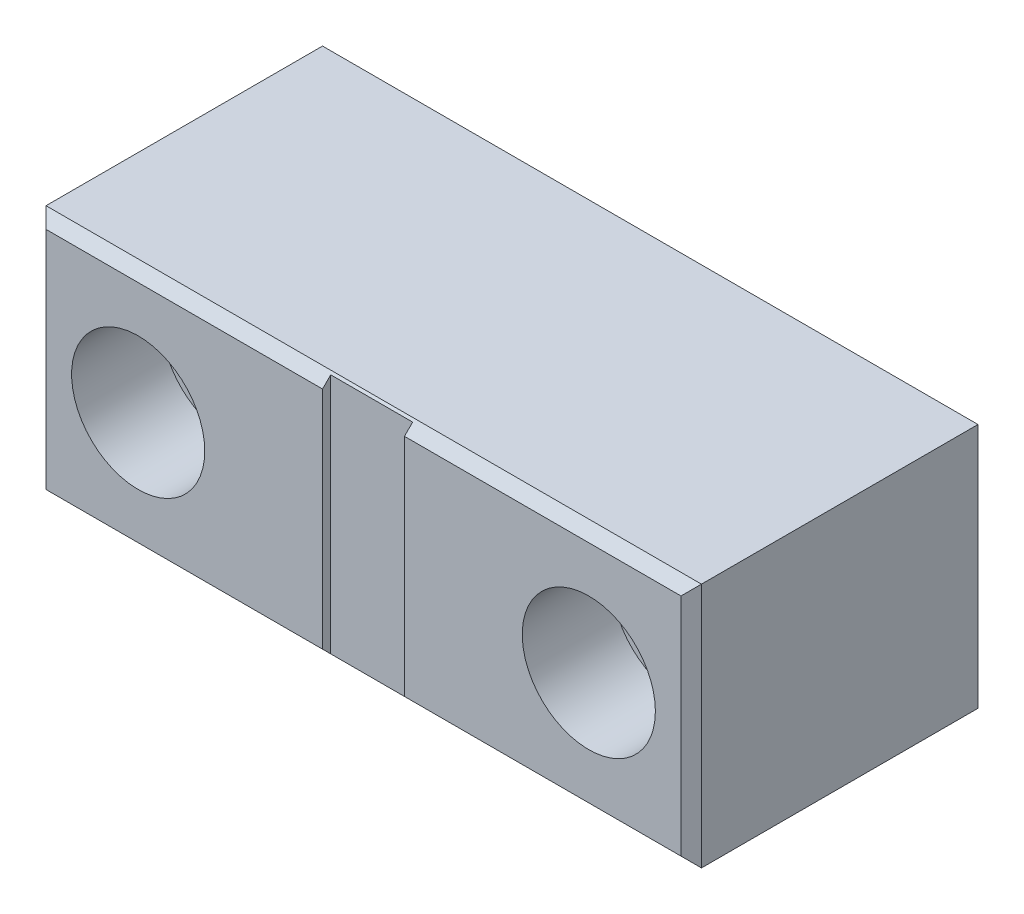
ISO-10303-21;
HEADER;
FILE_DESCRIPTION(('STEP AP214'),'2;1');
FILE_NAME('part.step','',(''),(''),'','','');
FILE_SCHEMA(('AUTOMOTIVE_DESIGN { 1 0 10303 214 1 1 1 1 }'));
ENDSEC;
DATA;
#1=APPLICATION_CONTEXT('core data for automotive mechanical design processes');
#2=APPLICATION_PROTOCOL_DEFINITION('international standard','automotive_design',2000,#1);
#3=PRODUCT_CONTEXT('',#1,'mechanical');
#4=PRODUCT('Part','Part','',(#3));
#5=PRODUCT_RELATED_PRODUCT_CATEGORY('part','',(#4));
#6=PRODUCT_DEFINITION_FORMATION('','',#4);
#7=PRODUCT_DEFINITION_CONTEXT('part definition',#1,'design');
#8=PRODUCT_DEFINITION('design','',#6,#7);
#9=PRODUCT_DEFINITION_SHAPE('','',#8);
#10=(LENGTH_UNIT() NAMED_UNIT(*) SI_UNIT(.MILLI.,.METRE.));
#11=(NAMED_UNIT(*) PLANE_ANGLE_UNIT() SI_UNIT($,.RADIAN.));
#12=(NAMED_UNIT(*) SI_UNIT($,.STERADIAN.) SOLID_ANGLE_UNIT());
#13=UNCERTAINTY_MEASURE_WITH_UNIT(LENGTH_MEASURE(1.E-05),#10,'distance_accuracy_value','');
#14=(GEOMETRIC_REPRESENTATION_CONTEXT(3) GLOBAL_UNCERTAINTY_ASSIGNED_CONTEXT((#13)) GLOBAL_UNIT_ASSIGNED_CONTEXT((#10,
#11,#12)) REPRESENTATION_CONTEXT('',''));
#15=CARTESIAN_POINT('',(0.,0.,0.));
#16=DIRECTION('',(0.,0.,1.));
#17=DIRECTION('',(1.,0.,0.));
#18=AXIS2_PLACEMENT_3D('',#15,#16,#17);
#19=CARTESIAN_POINT('',(-889.,-260.35,0.));
#20=DIRECTION('',(0.,1.,0.));
#21=DIRECTION('',(0.,0.,1.));
#22=AXIS2_PLACEMENT_3D('',#19,#20,#21);
#23=PLANE('',#22);
#24=CARTESIAN_POINT('',(-839.645032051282,-260.35,-18.8261217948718));
#25=CARTESIAN_POINT('',(-839.644068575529,-260.35,-18.8082062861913));
#26=CARTESIAN_POINT('',(-839.642187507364,-260.35,-18.7732284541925));
#27=CARTESIAN_POINT('',(-839.626969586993,-260.35,-18.7231549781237));
#28=CARTESIAN_POINT('',(-839.602135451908,-260.35,-18.6776450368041));
#29=CARTESIAN_POINT('',(-839.568566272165,-260.35,-18.6373709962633));
#30=CARTESIAN_POINT('',(-839.52817637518,-260.35,-18.6036368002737));
#31=CARTESIAN_POINT('',(-839.482550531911,-260.35,-18.579085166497));
#32=CARTESIAN_POINT('',(-839.432621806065,-260.35,-18.5645342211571));
#33=CARTESIAN_POINT('',(-839.398141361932,-260.35,-18.5625543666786));
#34=CARTESIAN_POINT('',(-839.380448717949,-260.35,-18.5615384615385));
#35=B_SPLINE_CURVE_WITH_KNOTS('',3,(#24,#25,#26,#27,#28,#29,#30,#31,#32,#33,#34),.UNSPECIFIED.,
.F.,.F.,(4,1,1,1,1,1,1,1,4),(0.,0.12909695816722,0.252045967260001,0.373904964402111,
0.501037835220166,0.62817070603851,0.751376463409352,0.872426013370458,1.),.UNSPECIFIED.);
#36=CARTESIAN_POINT('',(-839.645032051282,-260.35,-18.8261217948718));
#37=VERTEX_POINT('',#36);
#38=CARTESIAN_POINT('',(-839.380448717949,-260.35,-18.5615384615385));
#39=VERTEX_POINT('',#38);
#40=EDGE_CURVE('E512',#37,#39,#35,.T.);
#41=ORIENTED_EDGE('',*,*,#40,.T.);
#42=CARTESIAN_POINT('',(-839.380448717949,-260.35,-18.5615384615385));
#43=CARTESIAN_POINT('',(-839.362768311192,-260.35,-18.5625890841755));
#44=CARTESIAN_POINT('',(-839.328107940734,-260.35,-18.5646487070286));
#45=CARTESIAN_POINT('',(-839.277998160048,-260.35,-18.5787789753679));
#46=CARTESIAN_POINT('',(-839.232645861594,-260.35,-18.6038693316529));
#47=CARTESIAN_POINT('',(-839.192248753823,-260.35,-18.6373091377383));
#48=CARTESIAN_POINT('',(-839.158950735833,-260.35,-18.6778544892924));
#49=CARTESIAN_POINT('',(-839.132966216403,-260.35,-18.7228450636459));
#50=CARTESIAN_POINT('',(-839.11895903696,-260.35,-18.7733743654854));
#51=CARTESIAN_POINT('',(-839.116914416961,-260.35,-18.8082355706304));
#52=CARTESIAN_POINT('',(-839.115865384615,-260.35,-18.8261217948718));
#53=B_SPLINE_CURVE_WITH_KNOTS('',3,(#42,#43,#44,#45,#46,#47,#48,#49,#50,#51,#52),.UNSPECIFIED.,
.F.,.F.,(4,1,1,1,1,1,1,1,4),(0.,0.127518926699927,0.249985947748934,0.371792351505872,
0.498870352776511,0.625948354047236,0.748491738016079,0.870958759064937,1.),.UNSPECIFIED.);
#54=CARTESIAN_POINT('',(-839.115865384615,-260.35,-18.8261217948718));
#55=VERTEX_POINT('',#54);
#56=EDGE_CURVE('E503',#39,#55,#53,.T.);
#57=ORIENTED_EDGE('',*,*,#56,.T.);
#58=CARTESIAN_POINT('',(-839.115865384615,-260.35,-18.8261217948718));
#59=CARTESIAN_POINT('',(-839.116949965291,-260.35,-18.8435782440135));
#60=CARTESIAN_POINT('',(-839.119088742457,-260.35,-18.8780021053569));
#61=CARTESIAN_POINT('',(-839.132934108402,-260.35,-18.9281502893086));
#62=CARTESIAN_POINT('',(-839.159148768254,-260.35,-18.9731689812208));
#63=CARTESIAN_POINT('',(-839.192019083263,-260.35,-19.0142644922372));
#64=CARTESIAN_POINT('',(-839.23265584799,-260.35,-19.0477751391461));
#65=CARTESIAN_POINT('',(-839.278105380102,-260.35,-19.0726520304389));
#66=CARTESIAN_POINT('',(-839.327990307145,-260.35,-19.0877940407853));
#67=CARTESIAN_POINT('',(-839.362748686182,-260.35,-19.0897228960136));
#68=CARTESIAN_POINT('',(-839.380448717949,-260.35,-19.0907051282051));
#69=B_SPLINE_CURVE_WITH_KNOTS('',3,(#58,#59,#60,#61,#62,#63,#64,#65,#66,#67,#68),.UNSPECIFIED.,
.F.,.F.,(4,1,1,1,1,1,1,1,4),(0.,0.126177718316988,0.248820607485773,0.371539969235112,
0.49998370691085,0.627244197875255,0.74922552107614,0.872297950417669,1.),.UNSPECIFIED.);
#70=CARTESIAN_POINT('',(-839.380448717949,-260.35,-19.0907051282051));
#71=VERTEX_POINT('',#70);
#72=EDGE_CURVE('E493',#55,#71,#69,.T.);
#73=ORIENTED_EDGE('',*,*,#72,.T.);
#74=CARTESIAN_POINT('',(-839.380448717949,-260.35,-19.0907051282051));
#75=CARTESIAN_POINT('',(-839.39816150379,-260.35,-19.0897584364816));
#76=CARTESIAN_POINT('',(-839.432741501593,-260.35,-19.0879102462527));
#77=CARTESIAN_POINT('',(-839.482440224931,-260.35,-19.0723411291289));
#78=CARTESIAN_POINT('',(-839.528166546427,-260.35,-19.0480084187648));
#79=CARTESIAN_POINT('',(-839.568795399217,-260.35,-19.01420200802));
#80=CARTESIAN_POINT('',(-839.601941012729,-260.35,-18.9733804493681));
#81=CARTESIAN_POINT('',(-839.62700118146,-260.35,-18.9278402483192));
#82=CARTESIAN_POINT('',(-839.642050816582,-260.35,-18.8781456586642));
#83=CARTESIAN_POINT('',(-839.644030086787,-260.35,-18.8436065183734));
#84=CARTESIAN_POINT('',(-839.645032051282,-260.35,-18.8261217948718));
#85=B_SPLINE_CURVE_WITH_KNOTS('',3,(#74,#75,#76,#77,#78,#79,#80,#81,#82,#83,#84),.UNSPECIFIED.,
.F.,.F.,(4,1,1,1,1,1,1,1,4),(0.,0.127756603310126,0.249414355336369,0.372796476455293,
0.50011133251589,0.628609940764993,0.750643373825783,0.873768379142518,1.),.UNSPECIFIED.);
#86=EDGE_CURVE('E487',#71,#37,#85,.T.);
#87=ORIENTED_EDGE('',*,*,#86,.T.);
#88=EDGE_LOOP('',(#41,#57,#73,#87));
#89=FACE_BOUND('',#88,.T.);
#90=DIRECTION('',(1.,0.,0.));
#91=VECTOR('',#90,1.);
#92=CARTESIAN_POINT('',(-835.574519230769,-260.35,-15.875));
#93=LINE('',#92,#91);
#94=CARTESIAN_POINT('',(-835.574519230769,-260.35,-15.875));
#95=VERTEX_POINT('',#94);
#96=CARTESIAN_POINT('',(-834.271955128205,-260.35,-15.875));
#97=VERTEX_POINT('',#96);
#98=EDGE_CURVE('E1037',#95,#97,#93,.T.);
#99=ORIENTED_EDGE('',*,*,#98,.T.);
#100=DIRECTION('',(0.,0.,-1.));
#101=VECTOR('',#100,1.);
#102=CARTESIAN_POINT('',(-834.271955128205,-260.35,-15.875));
#103=LINE('',#102,#101);
#104=CARTESIAN_POINT('',(-834.271955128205,-260.35,-16.200641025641));
#105=VERTEX_POINT('',#104);
#106=EDGE_CURVE('E1253',#97,#105,#103,.T.);
#107=ORIENTED_EDGE('',*,*,#106,.T.);
#108=DIRECTION('',(-1.,0.,0.));
#109=VECTOR('',#108,1.);
#110=CARTESIAN_POINT('',(-834.271955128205,-260.35,-16.200641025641));
#111=LINE('',#110,#109);
#112=CARTESIAN_POINT('',(-835.351913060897,-260.35,-16.200641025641));
#113=VERTEX_POINT('',#112);
#114=EDGE_CURVE('E1249',#105,#113,#111,.T.);
#115=ORIENTED_EDGE('',*,*,#114,.T.);
#116=DIRECTION('',(-0.200705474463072,0.,-0.979651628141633));
#117=VECTOR('',#116,1.);
#118=CARTESIAN_POINT('',(-835.351913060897,-260.35,-16.200641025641));
#119=LINE('',#118,#117);
#120=CARTESIAN_POINT('',(-835.523001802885,-260.35,-17.0357321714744));
#121=VERTEX_POINT('',#120);
#122=EDGE_CURVE('E1242',#113,#121,#119,.T.);
#123=ORIENTED_EDGE('',*,*,#122,.T.);
#124=CARTESIAN_POINT('',(-835.523001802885,-260.35,-17.0357321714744));
#125=CARTESIAN_POINT('',(-835.489386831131,-260.35,-17.0264518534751));
#126=CARTESIAN_POINT('',(-835.424263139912,-260.35,-17.0084727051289));
#127=CARTESIAN_POINT('',(-835.328142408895,-260.35,-16.9885103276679));
#128=CARTESIAN_POINT('',(-835.236890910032,-260.35,-16.9764766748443));
#129=CARTESIAN_POINT('',(-835.177676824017,-260.35,-16.9748335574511));
#130=CARTESIAN_POINT('',(-835.1490234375,-260.35,-16.9740384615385));
#131=B_SPLINE_CURVE_WITH_KNOTS('',3,(#124,#125,#126,#127,#128,#129,#130),.UNSPECIFIED.,.F.,.F.,
(4,1,1,1,4),(0.,0.275068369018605,0.532901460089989,0.773973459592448,1.),.UNSPECIFIED.);
#132=CARTESIAN_POINT('',(-835.1490234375,-260.35,-16.9740384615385));
#133=VERTEX_POINT('',#132);
#134=EDGE_CURVE('E1233',#121,#133,#131,.T.);
#135=ORIENTED_EDGE('',*,*,#134,.T.);
#136=CARTESIAN_POINT('',(-835.1490234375,-260.35,-16.9740384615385));
#137=CARTESIAN_POINT('',(-835.11356890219,-260.35,-16.9748058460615));
#138=CARTESIAN_POINT('',(-835.043856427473,-260.35,-16.9763147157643));
#139=CARTESIAN_POINT('',(-834.941858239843,-260.35,-16.990803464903));
#140=CARTESIAN_POINT('',(-834.844491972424,-260.35,-17.0136089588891));
#141=CARTESIAN_POINT('',(-834.751961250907,-260.35,-17.0454682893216));
#142=CARTESIAN_POINT('',(-834.664094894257,-260.35,-17.0862078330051));
#143=CARTESIAN_POINT('',(-834.581701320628,-260.35,-17.1370984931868));
#144=CARTESIAN_POINT('',(-834.503543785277,-260.35,-17.196546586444));
#145=CARTESIAN_POINT('',(-834.431024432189,-260.35,-17.2648952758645));
#146=CARTESIAN_POINT('',(-834.365234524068,-260.35,-17.3401170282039));
#147=CARTESIAN_POINT('',(-834.307389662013,-260.35,-17.4209959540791));
#148=CARTESIAN_POINT('',(-834.258256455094,-260.35,-17.5067460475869));
#149=CARTESIAN_POINT('',(-834.218740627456,-260.35,-17.5981865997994));
#150=CARTESIAN_POINT('',(-834.187186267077,-260.35,-17.6943066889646));
#151=CARTESIAN_POINT('',(-834.166184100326,-260.35,-17.7961176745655));
#152=CARTESIAN_POINT('',(-834.152198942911,-260.35,-17.9026598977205));
#153=CARTESIAN_POINT('',(-834.150636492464,-260.35,-17.9755076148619));
#154=CARTESIAN_POINT('',(-834.14983974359,-260.35,-18.0126552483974));
#155=B_SPLINE_CURVE_WITH_KNOTS('',3,(#136,#137,#138,#139,#140,#141,#142,#143,#144,#145,#146,
#147,#148,#149,#150,#151,#152,#153,#154),.UNSPECIFIED.,.F.,.F.,(4,1,1,1,1,1,1,1,1,1,1,1,1,1,1,1,
4),(0.,0.0658076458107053,0.129394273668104,0.19089406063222,0.251281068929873,
0.310814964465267,0.370370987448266,0.430768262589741,0.492881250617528,0.555103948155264,
0.616067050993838,0.677256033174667,0.738259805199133,0.800762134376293,0.864777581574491,
0.931045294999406,1.),.UNSPECIFIED.);
#156=CARTESIAN_POINT('',(-834.14983974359,-260.35,-18.0126552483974));
#157=VERTEX_POINT('',#156);
#158=EDGE_CURVE('E1224',#133,#157,#155,.T.);
#159=ORIENTED_EDGE('',*,*,#158,.T.);
#160=CARTESIAN_POINT('',(-834.14983974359,-260.35,-18.0126552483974));
#161=CARTESIAN_POINT('',(-834.150443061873,-260.35,-18.0385289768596));
#162=CARTESIAN_POINT('',(-834.151641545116,-260.35,-18.089926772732));
#163=CARTESIAN_POINT('',(-834.157736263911,-260.35,-18.1662575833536));
#164=CARTESIAN_POINT('',(-834.169470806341,-260.35,-18.2409724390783));
#165=CARTESIAN_POINT('',(-834.185225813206,-260.35,-18.3140812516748));
#166=CARTESIAN_POINT('',(-834.205675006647,-260.35,-18.3854456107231));
#167=CARTESIAN_POINT('',(-834.230430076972,-260.35,-18.4552697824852));
#168=CARTESIAN_POINT('',(-834.260725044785,-260.35,-18.5231191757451));
#169=CARTESIAN_POINT('',(-834.293954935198,-260.35,-18.589635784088));
#170=CARTESIAN_POINT('',(-834.33137138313,-260.35,-18.6533158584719));
#171=CARTESIAN_POINT('',(-834.372899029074,-260.35,-18.7128688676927));
#172=CARTESIAN_POINT('',(-834.416773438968,-260.35,-18.7691881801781));
#173=CARTESIAN_POINT('',(-834.463982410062,-260.35,-18.8216697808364));
#174=CARTESIAN_POINT('',(-834.514964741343,-260.35,-18.8699688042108));
#175=CARTESIAN_POINT('',(-834.569102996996,-260.35,-18.9143718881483));
#176=CARTESIAN_POINT('',(-834.62596517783,-260.35,-18.9556299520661));
#177=CARTESIAN_POINT('',(-834.686431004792,-260.35,-18.9920682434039));
#178=CARTESIAN_POINT('',(-834.749153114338,-260.35,-19.0255989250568));
#179=CARTESIAN_POINT('',(-834.815037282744,-260.35,-19.0531067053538));
#180=CARTESIAN_POINT('',(-834.882583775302,-260.35,-19.0776998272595));
#181=CARTESIAN_POINT('',(-834.952764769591,-260.35,-19.0973027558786));
#182=CARTESIAN_POINT('',(-835.025421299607,-260.35,-19.112663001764));
#183=CARTESIAN_POINT('',(-835.100673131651,-260.35,-19.1230956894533));
#184=CARTESIAN_POINT('',(-835.178125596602,-260.35,-19.1306943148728));
#185=CARTESIAN_POINT('',(-835.230626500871,-260.35,-19.1311699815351));
#186=CARTESIAN_POINT('',(-835.257146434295,-260.35,-19.1314102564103));
#187=B_SPLINE_CURVE_WITH_KNOTS('',3,(#160,#161,#162,#163,#164,#165,#166,#167,#168,#169,#170,
#171,#172,#173,#174,#175,#176,#177,#178,#179,#180,#181,#182,#183,#184,#185,#186),.UNSPECIFIED.,
.F.,.F.,(4,1,1,1,1,1,1,1,1,1,1,1,1,1,1,1,1,1,1,1,1,1,1,1,4),(0.,0.0440144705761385,
0.0874341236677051,0.130118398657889,0.172553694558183,0.214554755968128,0.256298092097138,
0.29843822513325,0.340849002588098,0.382715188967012,0.423924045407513,0.464246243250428,
0.504073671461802,0.543861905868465,0.583566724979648,0.623094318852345,0.663229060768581,
0.703551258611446,0.743937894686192,0.784541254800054,0.825750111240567,0.867757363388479,
0.910745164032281,0.954914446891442,1.),.UNSPECIFIED.);
#188=CARTESIAN_POINT('',(-835.257146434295,-260.35,-19.1314102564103));
#189=VERTEX_POINT('',#188);
#190=EDGE_CURVE('E1215',#157,#189,#187,.T.);
#191=ORIENTED_EDGE('',*,*,#190,.T.);
#192=CARTESIAN_POINT('',(-835.257146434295,-260.35,-19.1314102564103));
#193=CARTESIAN_POINT('',(-835.288782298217,-260.35,-19.1307835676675));
#194=CARTESIAN_POINT('',(-835.351022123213,-260.35,-19.1295506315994));
#195=CARTESIAN_POINT('',(-835.442208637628,-260.35,-19.1166524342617));
#196=CARTESIAN_POINT('',(-835.529942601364,-260.35,-19.0981794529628));
#197=CARTESIAN_POINT('',(-835.613517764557,-260.35,-19.0703879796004));
#198=CARTESIAN_POINT('',(-835.693683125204,-260.35,-19.0355652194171));
#199=CARTESIAN_POINT('',(-835.76935944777,-260.35,-18.9915541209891));
#200=CARTESIAN_POINT('',(-835.842480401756,-260.35,-18.9416802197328));
#201=CARTESIAN_POINT('',(-835.910073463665,-260.35,-18.8828244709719));
#202=CARTESIAN_POINT('',(-835.972807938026,-260.35,-18.8184938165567));
#203=CARTESIAN_POINT('',(-836.028965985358,-260.35,-18.7486822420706));
#204=CARTESIAN_POINT('',(-836.078980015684,-260.35,-18.674541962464));
#205=CARTESIAN_POINT('',(-836.122049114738,-260.35,-18.5957129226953));
#206=CARTESIAN_POINT('',(-836.158786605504,-260.35,-18.5124022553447));
#207=CARTESIAN_POINT('',(-836.187647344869,-260.35,-18.4242978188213));
#208=CARTESIAN_POINT('',(-836.210941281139,-260.35,-18.3318599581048));
#209=CARTESIAN_POINT('',(-836.220795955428,-260.35,-18.2682207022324));
#210=CARTESIAN_POINT('',(-836.225801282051,-260.35,-18.2358974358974));
#211=B_SPLINE_CURVE_WITH_KNOTS('',3,(#192,#193,#194,#195,#196,#197,#198,#199,#200,#201,#202,
#203,#204,#205,#206,#207,#208,#209,#210),.UNSPECIFIED.,.F.,.F.,(4,1,1,1,1,1,1,1,1,1,1,1,1,1,1,1,
4),(0.,0.0654211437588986,0.128708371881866,0.190236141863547,0.250724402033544,
0.310637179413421,0.370766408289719,0.43161474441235,0.493522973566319,0.555883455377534,
0.617342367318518,0.678668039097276,0.740711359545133,0.802985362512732,0.866802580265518,
0.932347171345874,1.),.UNSPECIFIED.);
#212=CARTESIAN_POINT('',(-836.225801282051,-260.35,-18.2358974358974));
#213=VERTEX_POINT('',#212);
#214=EDGE_CURVE('E1209',#189,#213,#211,.T.);
#215=ORIENTED_EDGE('',*,*,#214,.T.);
#216=DIRECTION('',(1.,0.,0.));
#217=VECTOR('',#216,1.);
#218=CARTESIAN_POINT('',(-836.225801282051,-260.35,-18.2358974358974));
#219=LINE('',#218,#217);
#220=CARTESIAN_POINT('',(-835.940865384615,-260.35,-18.2358974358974));
#221=VERTEX_POINT('',#220);
#222=EDGE_CURVE('E1202',#213,#221,#219,.T.);
#223=ORIENTED_EDGE('',*,*,#222,.T.);
#224=CARTESIAN_POINT('',(-835.940865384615,-260.35,-18.2358974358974));
#225=CARTESIAN_POINT('',(-835.933854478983,-260.35,-18.266174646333));
#226=CARTESIAN_POINT('',(-835.920379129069,-260.35,-18.3243691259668));
#227=CARTESIAN_POINT('',(-835.890801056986,-260.35,-18.4061311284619));
#228=CARTESIAN_POINT('',(-835.854637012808,-260.35,-18.4789921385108));
#229=CARTESIAN_POINT('',(-835.811634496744,-260.35,-18.5439159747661));
#230=CARTESIAN_POINT('',(-835.760335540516,-260.35,-18.6005298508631));
#231=CARTESIAN_POINT('',(-835.701798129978,-260.35,-18.6509824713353));
#232=CARTESIAN_POINT('',(-835.636168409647,-260.35,-18.6964984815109));
#233=CARTESIAN_POINT('',(-835.563240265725,-260.35,-18.7344377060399));
#234=CARTESIAN_POINT('',(-835.486302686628,-260.35,-18.76679436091));
#235=CARTESIAN_POINT('',(-835.405778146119,-260.35,-18.7883405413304));
#236=CARTESIAN_POINT('',(-835.323859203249,-260.35,-18.8034906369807));
#237=CARTESIAN_POINT('',(-835.268452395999,-260.35,-18.8050071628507));
#238=CARTESIAN_POINT('',(-835.240609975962,-260.35,-18.8057692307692));
#239=B_SPLINE_CURVE_WITH_KNOTS('',3,(#224,#225,#226,#227,#228,#229,#230,#231,#232,#233,#234,
#235,#236,#237,#238),.UNSPECIFIED.,.F.,.F.,(4,1,1,1,1,1,1,1,1,1,1,1,4),(0.,0.0946872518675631,
0.181994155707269,0.264376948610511,0.342179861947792,0.418617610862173,0.496509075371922,
0.577369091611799,0.661510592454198,0.746732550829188,0.831257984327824,0.915205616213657,1.),.UNSPECIFIED.);
#240=CARTESIAN_POINT('',(-835.240609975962,-260.35,-18.8057692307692));
#241=VERTEX_POINT('',#240);
#242=EDGE_CURVE('E1193',#221,#241,#239,.T.);
#243=ORIENTED_EDGE('',*,*,#242,.T.);
#244=CARTESIAN_POINT('',(-835.240609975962,-260.35,-18.8057692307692));
#245=CARTESIAN_POINT('',(-835.213433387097,-260.35,-18.8050246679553));
#246=CARTESIAN_POINT('',(-835.159922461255,-260.35,-18.8035586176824));
#247=CARTESIAN_POINT('',(-835.081172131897,-260.35,-18.7922746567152));
#248=CARTESIAN_POINT('',(-835.005141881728,-260.35,-18.7748960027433));
#249=CARTESIAN_POINT('',(-834.932581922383,-260.35,-18.7488883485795));
#250=CARTESIAN_POINT('',(-834.862222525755,-260.35,-18.7172792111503));
#251=CARTESIAN_POINT('',(-834.795843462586,-260.35,-18.6767162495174));
#252=CARTESIAN_POINT('',(-834.731524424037,-260.35,-18.6300346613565));
#253=CARTESIAN_POINT('',(-834.6712646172,-260.35,-18.5765525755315));
#254=CARTESIAN_POINT('',(-834.616074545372,-260.35,-18.5176157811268));
#255=CARTESIAN_POINT('',(-834.567310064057,-260.35,-18.4545898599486));
#256=CARTESIAN_POINT('',(-834.526691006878,-260.35,-18.3873552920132));
#257=CARTESIAN_POINT('',(-834.492460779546,-260.35,-18.3170760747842));
#258=CARTESIAN_POINT('',(-834.466468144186,-260.35,-18.242981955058));
#259=CARTESIAN_POINT('',(-834.447925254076,-260.35,-18.165420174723));
#260=CARTESIAN_POINT('',(-834.437036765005,-260.35,-18.0841991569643));
#261=CARTESIAN_POINT('',(-834.435538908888,-260.35,-18.0288005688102));
#262=CARTESIAN_POINT('',(-834.434775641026,-260.35,-18.0005709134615));
#263=B_SPLINE_CURVE_WITH_KNOTS('',3,(#244,#245,#246,#247,#248,#249,#250,#251,#252,#253,#254,
#255,#256,#257,#258,#259,#260,#261,#262),.UNSPECIFIED.,.F.,.F.,(4,1,1,1,1,1,1,1,1,1,1,1,1,1,1,1,
4),(0.,0.0642072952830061,0.126424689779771,0.187680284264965,0.24821642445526,0.30830506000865,
0.369660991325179,0.431698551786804,0.495946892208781,0.559758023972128,0.622295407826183,
0.683910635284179,0.745092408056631,0.80674022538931,0.869086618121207,0.933290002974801,1.),.UNSPECIFIED.);
#264=CARTESIAN_POINT('',(-834.434775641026,-260.35,-18.0005709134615));
#265=VERTEX_POINT('',#264);
#266=EDGE_CURVE('E1184',#241,#265,#263,.T.);
#267=ORIENTED_EDGE('',*,*,#266,.T.);
#268=CARTESIAN_POINT('',(-834.434775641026,-260.35,-18.0005709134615));
#269=CARTESIAN_POINT('',(-834.435372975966,-260.35,-17.9751021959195));
#270=CARTESIAN_POINT('',(-834.436542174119,-260.35,-17.9252508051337));
#271=CARTESIAN_POINT('',(-834.446094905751,-260.35,-17.8523172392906));
#272=CARTESIAN_POINT('',(-834.462711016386,-260.35,-17.7833081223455));
#273=CARTESIAN_POINT('',(-834.485774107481,-260.35,-17.7178902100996));
#274=CARTESIAN_POINT('',(-834.515056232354,-260.35,-17.6560018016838));
#275=CARTESIAN_POINT('',(-834.550839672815,-260.35,-17.5975790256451));
#276=CARTESIAN_POINT('',(-834.59379596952,-260.35,-17.5433919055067));
#277=CARTESIAN_POINT('',(-834.642865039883,-260.35,-17.493415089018));
#278=CARTESIAN_POINT('',(-834.696620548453,-260.35,-17.4472915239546));
#279=CARTESIAN_POINT('',(-834.755987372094,-260.35,-17.4079722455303));
#280=CARTESIAN_POINT('',(-834.81972316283,-260.35,-17.374894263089));
#281=CARTESIAN_POINT('',(-834.887060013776,-260.35,-17.3463482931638));
#282=CARTESIAN_POINT('',(-834.959599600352,-260.35,-17.3258461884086));
#283=CARTESIAN_POINT('',(-835.035905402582,-260.35,-17.310453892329));
#284=CARTESIAN_POINT('',(-835.11680141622,-260.35,-17.3015499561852));
#285=CARTESIAN_POINT('',(-835.172110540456,-260.35,-17.3003145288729));
#286=CARTESIAN_POINT('',(-835.200540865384,-260.35,-17.2996794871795));
#287=B_SPLINE_CURVE_WITH_KNOTS('',3,(#268,#269,#270,#271,#272,#273,#274,#275,#276,#277,#278,
#279,#280,#281,#282,#283,#284,#285,#286),.UNSPECIFIED.,.F.,.F.,(4,1,1,1,1,1,1,1,1,1,1,1,1,1,1,1,
4),(0.,0.0653513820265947,0.12791603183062,0.188360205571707,0.247216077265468,
0.305630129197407,0.363769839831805,0.422660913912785,0.482687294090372,0.54330022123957,
0.604117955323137,0.664964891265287,0.727413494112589,0.791467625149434,0.858055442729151,
0.927036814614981,1.),.UNSPECIFIED.);
#288=CARTESIAN_POINT('',(-835.200540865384,-260.35,-17.2996794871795));
#289=VERTEX_POINT('',#288);
#290=EDGE_CURVE('E1175',#265,#289,#287,.T.);
#291=ORIENTED_EDGE('',*,*,#290,.T.);
#292=CARTESIAN_POINT('',(-835.200540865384,-260.35,-17.2996794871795));
#293=CARTESIAN_POINT('',(-835.225150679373,-260.35,-17.300206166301));
#294=CARTESIAN_POINT('',(-835.275963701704,-260.35,-17.3012936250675));
#295=CARTESIAN_POINT('',(-835.353907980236,-260.35,-17.3093005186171));
#296=CARTESIAN_POINT('',(-835.435815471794,-260.35,-17.3222175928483));
#297=CARTESIAN_POINT('',(-835.521372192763,-260.35,-17.3399851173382));
#298=CARTESIAN_POINT('',(-835.610835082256,-260.35,-17.3632361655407));
#299=CARTESIAN_POINT('',(-835.704015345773,-260.35,-17.3910986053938));
#300=CARTESIAN_POINT('',(-835.801108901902,-260.35,-17.4244107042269));
#301=CARTESIAN_POINT('',(-835.866529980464,-260.35,-17.44956778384));
#302=CARTESIAN_POINT('',(-835.90016025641,-260.35,-17.4625));
#303=B_SPLINE_CURVE_WITH_KNOTS('',3,(#292,#293,#294,#295,#296,#297,#298,#299,#300,#301,#302),
.UNSPECIFIED.,.F.,.F.,(4,1,1,1,1,1,1,1,4),(0.,0.102203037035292,0.211023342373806,
0.325099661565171,0.446502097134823,0.573787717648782,0.708900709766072,0.850357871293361,1.),.UNSPECIFIED.);
#304=CARTESIAN_POINT('',(-835.90016025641,-260.35,-17.4625));
#305=VERTEX_POINT('',#304);
#306=EDGE_CURVE('E1169',#289,#305,#303,.T.);
#307=ORIENTED_EDGE('',*,*,#306,.T.);
#308=DIRECTION('',(0.200944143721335,0.,0.979602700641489));
#309=VECTOR('',#308,1.);
#310=CARTESIAN_POINT('',(-835.90016025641,-260.35,-17.4625));
#311=LINE('',#310,#309);
#312=EDGE_CURVE('E714',#305,#95,#311,.T.);
#313=ORIENTED_EDGE('',*,*,#312,.T.);
#314=EDGE_LOOP('',(#99,#107,#115,#123,#135,#159,#191,#215,#223,#243,#267,#291,#307,#313));
#315=FACE_BOUND('',#314,.T.);
#316=DIRECTION('',(0.,0.,-1.));
#317=VECTOR('',#316,1.);
#318=CARTESIAN_POINT('',(-787.4,-260.35,0.));
#319=LINE('',#318,#317);
#320=CARTESIAN_POINT('',(-787.4,-260.35,-1.58750000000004));
#321=VERTEX_POINT('',#320);
#322=CARTESIAN_POINT('',(-787.4,-260.35,-44.45));
#323=VERTEX_POINT('',#322);
#324=EDGE_CURVE('E793',#321,#323,#319,.T.);
#325=ORIENTED_EDGE('',*,*,#324,.F.);
#326=DIRECTION('',(-1.,0.,0.));
#327=VECTOR('',#326,1.);
#328=CARTESIAN_POINT('',(-889.,-260.35,-1.58750000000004));
#329=LINE('',#328,#327);
#330=CARTESIAN_POINT('',(-889.,-260.35,-1.58750000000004));
#331=VERTEX_POINT('',#330);
#332=EDGE_CURVE('E815',#321,#331,#329,.T.);
#333=ORIENTED_EDGE('',*,*,#332,.T.);
#334=DIRECTION('',(0.,0.,-1.));
#335=VECTOR('',#334,1.);
#336=CARTESIAN_POINT('',(-889.,-260.35,0.));
#337=LINE('',#336,#335);
#338=CARTESIAN_POINT('',(-889.,-260.35,-44.45));
#339=VERTEX_POINT('',#338);
#340=EDGE_CURVE('E796',#331,#339,#337,.T.);
#341=ORIENTED_EDGE('',*,*,#340,.T.);
#342=DIRECTION('',(1.,0.,0.));
#343=VECTOR('',#342,1.);
#344=CARTESIAN_POINT('',(-889.,-260.35,-44.45));
#345=LINE('',#344,#343);
#346=EDGE_CURVE('E775',#339,#323,#345,.T.);
#347=ORIENTED_EDGE('',*,*,#346,.T.);
#348=EDGE_LOOP('',(#325,#333,#341,#347));
#349=FACE_BOUND('',#348,.T.);
#350=CARTESIAN_POINT('',(-837.647300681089,-260.35,-19.1314102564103));
#351=CARTESIAN_POINT('',(-837.672341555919,-260.35,-19.1309872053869));
#352=CARTESIAN_POINT('',(-837.721717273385,-260.35,-19.1301530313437));
#353=CARTESIAN_POINT('',(-837.794880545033,-260.35,-19.1215227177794));
#354=CARTESIAN_POINT('',(-837.865893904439,-260.35,-19.1076475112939));
#355=CARTESIAN_POINT('',(-837.935107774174,-260.35,-19.0882195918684));
#356=CARTESIAN_POINT('',(-838.002877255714,-260.35,-19.0644389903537));
#357=CARTESIAN_POINT('',(-838.06827888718,-260.35,-19.0334567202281));
#358=CARTESIAN_POINT('',(-838.132039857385,-260.35,-18.9977751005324));
#359=CARTESIAN_POINT('',(-838.19399005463,-260.35,-18.9571392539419));
#360=CARTESIAN_POINT('',(-838.252965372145,-260.35,-18.9105831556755));
#361=CARTESIAN_POINT('',(-838.309297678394,-260.35,-18.8590898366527));
#362=CARTESIAN_POINT('',(-838.361571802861,-260.35,-18.8013743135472));
#363=CARTESIAN_POINT('',(-838.410225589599,-260.35,-18.738347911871));
#364=CARTESIAN_POINT('',(-838.456466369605,-260.35,-18.6705904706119));
#365=CARTESIAN_POINT('',(-838.499001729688,-260.35,-18.5971768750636));
#366=CARTESIAN_POINT('',(-838.538345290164,-260.35,-18.5183982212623));
#367=CARTESIAN_POINT('',(-838.574307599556,-260.35,-18.4337455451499));
#368=CARTESIAN_POINT('',(-838.606192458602,-260.35,-18.3419835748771));
#369=CARTESIAN_POINT('',(-838.634357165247,-260.35,-18.2420625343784));
#370=CARTESIAN_POINT('',(-838.656595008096,-260.35,-18.1331004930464));
#371=CARTESIAN_POINT('',(-838.675629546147,-260.35,-18.0159725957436));
#372=CARTESIAN_POINT('',(-838.690982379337,-260.35,-17.8901755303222));
#373=CARTESIAN_POINT('',(-838.701463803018,-260.35,-17.7556410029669));
#374=CARTESIAN_POINT('',(-838.707941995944,-260.35,-17.6124528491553));
#375=CARTESIAN_POINT('',(-838.708518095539,-260.35,-17.5142366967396));
#376=CARTESIAN_POINT('',(-838.708814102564,-260.35,-17.4637720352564));
#377=B_SPLINE_CURVE_WITH_KNOTS('',3,(#350,#351,#352,#353,#354,#355,#356,#357,#358,#359,#360,
#361,#362,#363,#364,#365,#366,#367,#368,#369,#370,#371,#372,#373,#374,#375,#376),.UNSPECIFIED.,
.F.,.F.,(4,1,1,1,1,1,1,1,1,1,1,1,1,1,1,1,1,1,1,1,1,1,1,1,4),(0.,0.0337871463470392,
0.0666216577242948,0.0992848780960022,0.131361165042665,0.163585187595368,0.196103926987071,
0.228902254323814,0.26215805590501,0.295991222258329,0.330217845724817,0.365059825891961,
0.400950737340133,0.437620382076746,0.475707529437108,0.515380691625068,0.556413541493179,
0.599764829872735,0.646424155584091,0.696431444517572,0.74978151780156,0.806573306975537,
0.867435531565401,0.931886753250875,1.),.UNSPECIFIED.);
#378=CARTESIAN_POINT('',(-837.647300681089,-260.35,-19.1314102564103));
#379=VERTEX_POINT('',#378);
#380=CARTESIAN_POINT('',(-838.708814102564,-260.35,-17.4637720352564));
#381=VERTEX_POINT('',#380);
#382=EDGE_CURVE('E593',#379,#381,#377,.T.);
#383=ORIENTED_EDGE('',*,*,#382,.T.);
#384=CARTESIAN_POINT('',(-838.708814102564,-260.35,-17.4637720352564));
#385=CARTESIAN_POINT('',(-838.708516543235,-260.35,-17.4128836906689));
#386=CARTESIAN_POINT('',(-838.707938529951,-260.35,-17.3140323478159));
#387=CARTESIAN_POINT('',(-838.701508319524,-260.35,-17.169991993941));
#388=CARTESIAN_POINT('',(-838.690826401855,-260.35,-17.0348637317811));
#389=CARTESIAN_POINT('',(-838.67618749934,-260.35,-16.9086410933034));
#390=CARTESIAN_POINT('',(-838.658373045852,-260.35,-16.7912914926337));
#391=CARTESIAN_POINT('',(-838.634591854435,-260.35,-16.6831285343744));
#392=CARTESIAN_POINT('',(-838.607547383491,-260.35,-16.5836516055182));
#393=CARTESIAN_POINT('',(-838.576203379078,-260.35,-16.4925363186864));
#394=CARTESIAN_POINT('',(-838.540835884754,-260.35,-16.4085551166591));
#395=CARTESIAN_POINT('',(-838.502341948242,-260.35,-16.3301551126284));
#396=CARTESIAN_POINT('',(-838.459193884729,-260.35,-16.2574549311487));
#397=CARTESIAN_POINT('',(-838.413857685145,-260.35,-16.1892942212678));
#398=CARTESIAN_POINT('',(-838.364498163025,-260.35,-16.1267887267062));
#399=CARTESIAN_POINT('',(-838.31251997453,-260.35,-16.0690557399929));
#400=CARTESIAN_POINT('',(-838.255894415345,-260.35,-16.017429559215));
#401=CARTESIAN_POINT('',(-838.196546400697,-260.35,-15.9703975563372));
#402=CARTESIAN_POINT('',(-838.133938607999,-260.35,-15.929168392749));
#403=CARTESIAN_POINT('',(-838.069855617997,-260.35,-15.8928529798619));
#404=CARTESIAN_POINT('',(-838.0038563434,-260.35,-15.8618288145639));
#405=CARTESIAN_POINT('',(-837.935760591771,-260.35,-15.8374353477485));
#406=CARTESIAN_POINT('',(-837.866180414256,-260.35,-15.8172869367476));
#407=CARTESIAN_POINT('',(-837.794872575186,-260.35,-15.8035083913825));
#408=CARTESIAN_POINT('',(-837.721719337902,-260.35,-15.79483891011));
#409=CARTESIAN_POINT('',(-837.67234225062,-260.35,-15.7940100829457));
#410=CARTESIAN_POINT('',(-837.647300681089,-260.35,-15.7935897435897));
#411=B_SPLINE_CURVE_WITH_KNOTS('',3,(#384,#385,#386,#387,#388,#389,#390,#391,#392,#393,#394,
#395,#396,#397,#398,#399,#400,#401,#402,#403,#404,#405,#406,#407,#408,#409,#410),.UNSPECIFIED.,
.F.,.F.,(4,1,1,1,1,1,1,1,1,1,1,1,1,1,1,1,1,1,1,1,1,1,1,1,4),(0.,0.0685946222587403,
0.133246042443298,0.194312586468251,0.251279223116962,0.304513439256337,0.35423490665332,
0.400480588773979,0.443410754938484,0.484014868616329,0.523252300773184,0.561042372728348,
0.5979002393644,0.633518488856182,0.668314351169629,0.702495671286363,0.736685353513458,
0.770293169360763,0.803437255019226,0.83591295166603,0.868460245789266,0.900846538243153,
0.933466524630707,0.966257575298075,1.),.UNSPECIFIED.);
#412=CARTESIAN_POINT('',(-837.647300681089,-260.35,-15.7935897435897));
#413=VERTEX_POINT('',#412);
#414=EDGE_CURVE('E1062',#381,#413,#411,.T.);
#415=ORIENTED_EDGE('',*,*,#414,.T.);
#416=CARTESIAN_POINT('',(-837.647300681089,-260.35,-15.7935897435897));
#417=CARTESIAN_POINT('',(-837.622049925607,-260.35,-15.794032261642));
#418=CARTESIAN_POINT('',(-837.571834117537,-260.35,-15.7949122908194));
#419=CARTESIAN_POINT('',(-837.497593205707,-260.35,-15.8033704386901));
#420=CARTESIAN_POINT('',(-837.425067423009,-260.35,-15.8174049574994));
#421=CARTESIAN_POINT('',(-837.354565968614,-260.35,-15.8372904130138));
#422=CARTESIAN_POINT('',(-837.28550973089,-260.35,-15.8619607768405));
#423=CARTESIAN_POINT('',(-837.218438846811,-260.35,-15.8928826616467));
#424=CARTESIAN_POINT('',(-837.152936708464,-260.35,-15.9288770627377));
#425=CARTESIAN_POINT('',(-837.090044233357,-260.35,-15.9711715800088));
#426=CARTESIAN_POINT('',(-837.02907097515,-260.35,-16.0183269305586));
#427=CARTESIAN_POINT('',(-836.971514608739,-260.35,-16.0716330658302));
#428=CARTESIAN_POINT('',(-836.917369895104,-260.35,-16.1305517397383));
#429=CARTESIAN_POINT('',(-836.865957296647,-260.35,-16.1944525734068));
#430=CARTESIAN_POINT('',(-836.818735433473,-260.35,-16.2645611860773));
#431=CARTESIAN_POINT('',(-836.773765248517,-260.35,-16.3396581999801));
#432=CARTESIAN_POINT('',(-836.733513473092,-260.35,-16.4210569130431));
#433=CARTESIAN_POINT('',(-836.694747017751,-260.35,-16.5073991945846));
#434=CARTESIAN_POINT('',(-836.661285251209,-260.35,-16.6010740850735));
#435=CARTESIAN_POINT('',(-836.631108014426,-260.35,-16.7015535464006));
#436=CARTESIAN_POINT('',(-836.606724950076,-260.35,-16.8100244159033));
#437=CARTESIAN_POINT('',(-836.586414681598,-260.35,-16.9259175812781));
#438=CARTESIAN_POINT('',(-836.570680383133,-260.35,-17.0496586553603));
#439=CARTESIAN_POINT('',(-836.559220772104,-260.35,-17.1809823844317));
#440=CARTESIAN_POINT('',(-836.553167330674,-260.35,-17.3199751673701));
#441=CARTESIAN_POINT('',(-836.552027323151,-260.35,-17.4150055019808));
#442=CARTESIAN_POINT('',(-836.551442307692,-260.35,-17.4637720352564));
#443=B_SPLINE_CURVE_WITH_KNOTS('',3,(#416,#417,#418,#419,#420,#421,#422,#423,#424,#425,#426,
#427,#428,#429,#430,#431,#432,#433,#434,#435,#436,#437,#438,#439,#440,#441,#442),.UNSPECIFIED.,
.F.,.F.,(4,1,1,1,1,1,1,1,1,1,1,1,1,1,1,1,1,1,1,1,1,1,1,1,4),(0.,0.0337881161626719,
0.0671939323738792,0.0998624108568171,0.132566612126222,0.165151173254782,0.197913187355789,
0.23131900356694,0.265083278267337,0.299255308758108,0.334398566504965,0.369942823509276,
0.406283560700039,0.444063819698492,0.482997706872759,0.523354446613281,0.565536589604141,
0.609612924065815,0.65639081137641,0.70588549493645,0.758324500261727,0.813831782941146,
0.872794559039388,0.934722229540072,1.),.UNSPECIFIED.);
#444=CARTESIAN_POINT('',(-836.551442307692,-260.35,-17.4637720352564));
#445=VERTEX_POINT('',#444);
#446=EDGE_CURVE('E1053',#413,#445,#443,.T.);
#447=ORIENTED_EDGE('',*,*,#446,.T.);
#448=CARTESIAN_POINT('',(-836.551442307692,-260.35,-17.4637720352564));
#449=CARTESIAN_POINT('',(-836.552033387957,-260.35,-17.5123258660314));
#450=CARTESIAN_POINT('',(-836.553185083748,-260.35,-17.6069310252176));
#451=CARTESIAN_POINT('',(-836.559152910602,-260.35,-17.745298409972));
#452=CARTESIAN_POINT('',(-836.570908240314,-260.35,-17.8759252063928));
#453=CARTESIAN_POINT('',(-836.585613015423,-260.35,-17.9991246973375));
#454=CARTESIAN_POINT('',(-836.605979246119,-260.35,-18.1143841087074));
#455=CARTESIAN_POINT('',(-836.631021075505,-260.35,-18.2221022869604));
#456=CARTESIAN_POINT('',(-836.658825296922,-260.35,-18.3227444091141));
#457=CARTESIAN_POINT('',(-836.69314686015,-260.35,-18.4154859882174));
#458=CARTESIAN_POINT('',(-836.73071229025,-260.35,-18.5016207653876));
#459=CARTESIAN_POINT('',(-836.771583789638,-260.35,-18.5820545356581));
#460=CARTESIAN_POINT('',(-836.815371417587,-260.35,-18.6574982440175));
#461=CARTESIAN_POINT('',(-836.863076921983,-260.35,-18.7273480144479));
#462=CARTESIAN_POINT('',(-836.913925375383,-260.35,-18.792098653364));
#463=CARTESIAN_POINT('',(-836.969005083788,-260.35,-18.850607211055));
#464=CARTESIAN_POINT('',(-837.026763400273,-260.35,-18.9042834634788));
#465=CARTESIAN_POINT('',(-837.08791609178,-260.35,-18.952046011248));
#466=CARTESIAN_POINT('',(-837.15178942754,-260.35,-18.9938515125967));
#467=CARTESIAN_POINT('',(-837.217066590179,-260.35,-19.0312383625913));
#468=CARTESIAN_POINT('',(-837.284905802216,-260.35,-19.0613851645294));
#469=CARTESIAN_POINT('',(-837.353769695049,-260.35,-19.0872705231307));
#470=CARTESIAN_POINT('',(-837.42464328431,-260.35,-19.1070466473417));
#471=CARTESIAN_POINT('',(-837.497438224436,-260.35,-19.1207207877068));
#472=CARTESIAN_POINT('',(-837.571784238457,-260.35,-19.1303109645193));
#473=CARTESIAN_POINT('',(-837.622041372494,-260.35,-19.1310425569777));
#474=CARTESIAN_POINT('',(-837.647300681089,-260.35,-19.1314102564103));
#475=B_SPLINE_CURVE_WITH_KNOTS('',3,(#448,#449,#450,#451,#452,#453,#454,#455,#456,#457,#458,
#459,#460,#461,#462,#463,#464,#465,#466,#467,#468,#469,#470,#471,#472,#473,#474),.UNSPECIFIED.,
.F.,.F.,(4,1,1,1,1,1,1,1,1,1,1,1,1,1,1,1,1,1,1,1,1,1,1,1,4),(0.,0.0650632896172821,
0.126773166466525,0.185515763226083,0.240764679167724,0.292979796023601,0.342250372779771,
0.388919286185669,0.432775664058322,0.474628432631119,0.514774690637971,0.553605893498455,
0.59142640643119,0.628028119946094,0.663803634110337,0.698984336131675,0.733591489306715,
0.767628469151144,0.801208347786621,0.834263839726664,0.866980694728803,0.899719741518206,
0.932701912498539,0.966175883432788,1.),.UNSPECIFIED.);
#476=EDGE_CURVE('E567',#445,#379,#475,.T.);
#477=ORIENTED_EDGE('',*,*,#476,.T.);
#478=EDGE_LOOP('',(#383,#415,#447,#477));
#479=FACE_BOUND('',#478,.T.);
#480=CARTESIAN_POINT('',(-841.270057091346,-260.35,-19.1314102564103));
#481=CARTESIAN_POINT('',(-841.295097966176,-260.35,-19.1309872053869));
#482=CARTESIAN_POINT('',(-841.344473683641,-260.35,-19.1301530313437));
#483=CARTESIAN_POINT('',(-841.41763695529,-260.35,-19.1215227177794));
#484=CARTESIAN_POINT('',(-841.488650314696,-260.35,-19.1076475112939));
#485=CARTESIAN_POINT('',(-841.557864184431,-260.35,-19.0882195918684));
#486=CARTESIAN_POINT('',(-841.625633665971,-260.35,-19.0644389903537));
#487=CARTESIAN_POINT('',(-841.691035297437,-260.35,-19.0334567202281));
#488=CARTESIAN_POINT('',(-841.754796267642,-260.35,-18.9977751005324));
#489=CARTESIAN_POINT('',(-841.816746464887,-260.35,-18.9571392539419));
#490=CARTESIAN_POINT('',(-841.875721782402,-260.35,-18.9105831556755));
#491=CARTESIAN_POINT('',(-841.93205408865,-260.35,-18.8590898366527));
#492=CARTESIAN_POINT('',(-841.984328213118,-260.35,-18.8013743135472));
#493=CARTESIAN_POINT('',(-842.032981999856,-260.35,-18.738347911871));
#494=CARTESIAN_POINT('',(-842.079222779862,-260.35,-18.6705904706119));
#495=CARTESIAN_POINT('',(-842.121758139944,-260.35,-18.5971768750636));
#496=CARTESIAN_POINT('',(-842.161101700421,-260.35,-18.5183982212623));
#497=CARTESIAN_POINT('',(-842.197064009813,-260.35,-18.4337455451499));
#498=CARTESIAN_POINT('',(-842.228948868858,-260.35,-18.3419835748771));
#499=CARTESIAN_POINT('',(-842.257113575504,-260.35,-18.2420625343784));
#500=CARTESIAN_POINT('',(-842.279351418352,-260.35,-18.1331004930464));
#501=CARTESIAN_POINT('',(-842.298385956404,-260.35,-18.0159725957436));
#502=CARTESIAN_POINT('',(-842.313738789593,-260.35,-17.8901755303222));
#503=CARTESIAN_POINT('',(-842.324220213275,-260.35,-17.7556410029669));
#504=CARTESIAN_POINT('',(-842.3306984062,-260.35,-17.6124528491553));
#505=CARTESIAN_POINT('',(-842.331274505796,-260.35,-17.5142366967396));
#506=CARTESIAN_POINT('',(-842.33157051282,-260.35,-17.4637720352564));
#507=B_SPLINE_CURVE_WITH_KNOTS('',3,(#480,#481,#482,#483,#484,#485,#486,#487,#488,#489,#490,
#491,#492,#493,#494,#495,#496,#497,#498,#499,#500,#501,#502,#503,#504,#505,#506),.UNSPECIFIED.,
.F.,.F.,(4,1,1,1,1,1,1,1,1,1,1,1,1,1,1,1,1,1,1,1,1,1,1,1,4),(0.,0.0337871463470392,
0.0666216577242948,0.0992848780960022,0.131361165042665,0.163585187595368,0.196103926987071,
0.228902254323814,0.26215805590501,0.295991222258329,0.330217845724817,0.365059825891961,
0.400950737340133,0.437620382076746,0.475707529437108,0.515380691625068,0.556413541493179,
0.599764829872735,0.646424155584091,0.696431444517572,0.74978151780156,0.806573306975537,
0.867435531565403,0.931886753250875,1.),.UNSPECIFIED.);
#508=CARTESIAN_POINT('',(-841.270057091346,-260.35,-19.1314102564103));
#509=VERTEX_POINT('',#508);
#510=CARTESIAN_POINT('',(-842.33157051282,-260.35,-17.4637720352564));
#511=VERTEX_POINT('',#510);
#512=EDGE_CURVE('E66',#509,#511,#507,.T.);
#513=ORIENTED_EDGE('',*,*,#512,.T.);
#514=CARTESIAN_POINT('',(-842.33157051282,-260.35,-17.4637720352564));
#515=CARTESIAN_POINT('',(-842.331272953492,-260.35,-17.4128836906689));
#516=CARTESIAN_POINT('',(-842.330694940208,-260.35,-17.3140323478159));
#517=CARTESIAN_POINT('',(-842.324264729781,-260.35,-17.169991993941));
#518=CARTESIAN_POINT('',(-842.313582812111,-260.35,-17.0348637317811));
#519=CARTESIAN_POINT('',(-842.298943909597,-260.35,-16.9086410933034));
#520=CARTESIAN_POINT('',(-842.281129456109,-260.35,-16.7912914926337));
#521=CARTESIAN_POINT('',(-842.257348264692,-260.35,-16.6831285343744));
#522=CARTESIAN_POINT('',(-842.230303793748,-260.35,-16.5836516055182));
#523=CARTESIAN_POINT('',(-842.198959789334,-260.35,-16.4925363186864));
#524=CARTESIAN_POINT('',(-842.16359229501,-260.35,-16.4085551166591));
#525=CARTESIAN_POINT('',(-842.125098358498,-260.35,-16.3301551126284));
#526=CARTESIAN_POINT('',(-842.081950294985,-260.35,-16.2574549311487));
#527=CARTESIAN_POINT('',(-842.036614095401,-260.35,-16.1892942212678));
#528=CARTESIAN_POINT('',(-841.987254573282,-260.35,-16.1267887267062));
#529=CARTESIAN_POINT('',(-841.935276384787,-260.35,-16.0690557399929));
#530=CARTESIAN_POINT('',(-841.878650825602,-260.35,-16.017429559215));
#531=CARTESIAN_POINT('',(-841.819302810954,-260.35,-15.9703975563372));
#532=CARTESIAN_POINT('',(-841.756695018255,-260.35,-15.929168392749));
#533=CARTESIAN_POINT('',(-841.692612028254,-260.35,-15.8928529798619));
#534=CARTESIAN_POINT('',(-841.626612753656,-260.35,-15.8618288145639));
#535=CARTESIAN_POINT('',(-841.558517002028,-260.35,-15.8374353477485));
#536=CARTESIAN_POINT('',(-841.488936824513,-260.35,-15.8172869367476));
#537=CARTESIAN_POINT('',(-841.417628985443,-260.35,-15.8035083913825));
#538=CARTESIAN_POINT('',(-841.344475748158,-260.35,-15.79483891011));
#539=CARTESIAN_POINT('',(-841.295098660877,-260.35,-15.7940100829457));
#540=CARTESIAN_POINT('',(-841.270057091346,-260.35,-15.7935897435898));
#541=B_SPLINE_CURVE_WITH_KNOTS('',3,(#514,#515,#516,#517,#518,#519,#520,#521,#522,#523,#524,
#525,#526,#527,#528,#529,#530,#531,#532,#533,#534,#535,#536,#537,#538,#539,#540),.UNSPECIFIED.,
.F.,.F.,(4,1,1,1,1,1,1,1,1,1,1,1,1,1,1,1,1,1,1,1,1,1,1,1,4),(0.,0.0685946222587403,
0.133246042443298,0.194312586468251,0.251279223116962,0.304513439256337,0.354234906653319,
0.400480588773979,0.443410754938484,0.484014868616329,0.523252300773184,0.561042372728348,
0.5979002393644,0.633518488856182,0.668314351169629,0.702495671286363,0.736685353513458,
0.770293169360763,0.803437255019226,0.83591295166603,0.868460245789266,0.900846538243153,
0.933466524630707,0.966257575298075,1.),.UNSPECIFIED.);
#542=CARTESIAN_POINT('',(-841.270057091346,-260.35,-15.7935897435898));
#543=VERTEX_POINT('',#542);
#544=EDGE_CURVE('E428',#511,#543,#541,.T.);
#545=ORIENTED_EDGE('',*,*,#544,.T.);
#546=CARTESIAN_POINT('',(-841.270057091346,-260.35,-15.7935897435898));
#547=CARTESIAN_POINT('',(-841.244806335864,-260.35,-15.794032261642));
#548=CARTESIAN_POINT('',(-841.194590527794,-260.35,-15.7949122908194));
#549=CARTESIAN_POINT('',(-841.120349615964,-260.35,-15.8033704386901));
#550=CARTESIAN_POINT('',(-841.047823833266,-260.35,-15.8174049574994));
#551=CARTESIAN_POINT('',(-840.97732237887,-260.35,-15.8372904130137));
#552=CARTESIAN_POINT('',(-840.908266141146,-260.35,-15.8619607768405));
#553=CARTESIAN_POINT('',(-840.841195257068,-260.35,-15.8928826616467));
#554=CARTESIAN_POINT('',(-840.775693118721,-260.35,-15.9288770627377));
#555=CARTESIAN_POINT('',(-840.712800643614,-260.35,-15.9711715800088));
#556=CARTESIAN_POINT('',(-840.651827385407,-260.35,-16.0183269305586));
#557=CARTESIAN_POINT('',(-840.594271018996,-260.35,-16.0716330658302));
#558=CARTESIAN_POINT('',(-840.540126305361,-260.35,-16.1305517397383));
#559=CARTESIAN_POINT('',(-840.488713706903,-260.35,-16.1944525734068));
#560=CARTESIAN_POINT('',(-840.441491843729,-260.35,-16.2645611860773));
#561=CARTESIAN_POINT('',(-840.396521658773,-260.35,-16.3396581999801));
#562=CARTESIAN_POINT('',(-840.356269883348,-260.35,-16.4210569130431));
#563=CARTESIAN_POINT('',(-840.317503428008,-260.35,-16.5073991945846));
#564=CARTESIAN_POINT('',(-840.284041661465,-260.35,-16.6010740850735));
#565=CARTESIAN_POINT('',(-840.253864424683,-260.35,-16.7015535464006));
#566=CARTESIAN_POINT('',(-840.229481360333,-260.35,-16.8100244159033));
#567=CARTESIAN_POINT('',(-840.209171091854,-260.35,-16.9259175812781));
#568=CARTESIAN_POINT('',(-840.19343679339,-260.35,-17.0496586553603));
#569=CARTESIAN_POINT('',(-840.181977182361,-260.35,-17.1809823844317));
#570=CARTESIAN_POINT('',(-840.175923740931,-260.35,-17.3199751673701));
#571=CARTESIAN_POINT('',(-840.174783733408,-260.35,-17.4150055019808));
#572=CARTESIAN_POINT('',(-840.174198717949,-260.35,-17.4637720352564));
#573=B_SPLINE_CURVE_WITH_KNOTS('',3,(#546,#547,#548,#549,#550,#551,#552,#553,#554,#555,#556,
#557,#558,#559,#560,#561,#562,#563,#564,#565,#566,#567,#568,#569,#570,#571,#572),.UNSPECIFIED.,
.F.,.F.,(4,1,1,1,1,1,1,1,1,1,1,1,1,1,1,1,1,1,1,1,1,1,1,1,4),(0.,0.0337881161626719,
0.0671939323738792,0.0998624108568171,0.132566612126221,0.165151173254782,0.197913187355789,
0.23131900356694,0.265083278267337,0.299255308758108,0.334398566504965,0.369942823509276,
0.406283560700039,0.444063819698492,0.482997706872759,0.523354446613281,0.565536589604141,
0.609612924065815,0.65639081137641,0.70588549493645,0.758324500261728,0.813831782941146,
0.872794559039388,0.934722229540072,1.),.UNSPECIFIED.);
#574=CARTESIAN_POINT('',(-840.174198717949,-260.35,-17.4637720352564));
#575=VERTEX_POINT('',#574);
#576=EDGE_CURVE('E437',#543,#575,#573,.T.);
#577=ORIENTED_EDGE('',*,*,#576,.T.);
#578=CARTESIAN_POINT('',(-840.174198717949,-260.35,-17.4637720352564));
#579=CARTESIAN_POINT('',(-840.174789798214,-260.35,-17.5123258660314));
#580=CARTESIAN_POINT('',(-840.175941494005,-260.35,-17.6069310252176));
#581=CARTESIAN_POINT('',(-840.181909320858,-260.35,-17.745298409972));
#582=CARTESIAN_POINT('',(-840.19366465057,-260.35,-17.8759252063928));
#583=CARTESIAN_POINT('',(-840.208369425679,-260.35,-17.9991246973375));
#584=CARTESIAN_POINT('',(-840.228735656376,-260.35,-18.1143841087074));
#585=CARTESIAN_POINT('',(-840.253777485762,-260.35,-18.2221022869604));
#586=CARTESIAN_POINT('',(-840.281581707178,-260.35,-18.3227444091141));
#587=CARTESIAN_POINT('',(-840.315903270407,-260.35,-18.4154859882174));
#588=CARTESIAN_POINT('',(-840.353468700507,-260.35,-18.5016207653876));
#589=CARTESIAN_POINT('',(-840.394340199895,-260.35,-18.5820545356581));
#590=CARTESIAN_POINT('',(-840.438127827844,-260.35,-18.6574982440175));
#591=CARTESIAN_POINT('',(-840.48583333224,-260.35,-18.7273480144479));
#592=CARTESIAN_POINT('',(-840.536681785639,-260.35,-18.792098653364));
#593=CARTESIAN_POINT('',(-840.591761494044,-260.35,-18.850607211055));
#594=CARTESIAN_POINT('',(-840.64951981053,-260.35,-18.9042834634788));
#595=CARTESIAN_POINT('',(-840.710672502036,-260.35,-18.952046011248));
#596=CARTESIAN_POINT('',(-840.774545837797,-260.35,-18.9938515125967));
#597=CARTESIAN_POINT('',(-840.839823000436,-260.35,-19.0312383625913));
#598=CARTESIAN_POINT('',(-840.907662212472,-260.35,-19.0613851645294));
#599=CARTESIAN_POINT('',(-840.976526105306,-260.35,-19.0872705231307));
#600=CARTESIAN_POINT('',(-841.047399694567,-260.35,-19.1070466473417));
#601=CARTESIAN_POINT('',(-841.120194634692,-260.35,-19.1207207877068));
#602=CARTESIAN_POINT('',(-841.194540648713,-260.35,-19.1303109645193));
#603=CARTESIAN_POINT('',(-841.244797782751,-260.35,-19.1310425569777));
#604=CARTESIAN_POINT('',(-841.270057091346,-260.35,-19.1314102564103));
#605=B_SPLINE_CURVE_WITH_KNOTS('',3,(#578,#579,#580,#581,#582,#583,#584,#585,#586,#587,#588,
#589,#590,#591,#592,#593,#594,#595,#596,#597,#598,#599,#600,#601,#602,#603,#604),.UNSPECIFIED.,
.F.,.F.,(4,1,1,1,1,1,1,1,1,1,1,1,1,1,1,1,1,1,1,1,1,1,1,1,4),(0.,0.0650632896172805,
0.126773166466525,0.185515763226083,0.240764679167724,0.292979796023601,0.342250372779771,
0.388919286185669,0.432775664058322,0.474628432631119,0.514774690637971,0.553605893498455,
0.59142640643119,0.628028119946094,0.663803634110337,0.698984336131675,0.733591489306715,
0.767628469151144,0.801208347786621,0.834263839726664,0.866980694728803,0.899719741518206,
0.932701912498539,0.966175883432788,1.),.UNSPECIFIED.);
#606=EDGE_CURVE('E446',#575,#509,#605,.T.);
#607=ORIENTED_EDGE('',*,*,#606,.T.);
#608=EDGE_LOOP('',(#513,#545,#577,#607));
#609=FACE_BOUND('',#608,.T.);
#610=ADVANCED_FACE('F49',(#89,#315,#349,#479,#609),#23,.F.);
#611=CARTESIAN_POINT('',(0.,0.,0.));
#612=DIRECTION('',(0.,0.,1.));
#613=DIRECTION('',(1.,0.,0.));
#614=AXIS2_PLACEMENT_3D('',#611,#612,#613);
#615=PLANE('',#614);
#616=DIRECTION('',(0.,-1.,0.));
#617=VECTOR('',#616,1.);
#618=CARTESIAN_POINT('',(-844.55,-222.25,0.));
#619=LINE('',#618,#617);
#620=CARTESIAN_POINT('',(-844.55,-223.8375,0.));
#621=VERTEX_POINT('',#620);
#622=CARTESIAN_POINT('',(-844.55,-258.7625,0.));
#623=VERTEX_POINT('',#622);
#624=EDGE_CURVE('E470',#621,#623,#619,.T.);
#625=ORIENTED_EDGE('',*,*,#624,.F.);
#626=DIRECTION('',(-1.,0.,0.));
#627=VECTOR('',#626,1.);
#628=CARTESIAN_POINT('',(-889.,-223.8375,0.));
#629=LINE('',#628,#627);
#630=CARTESIAN_POINT('',(-887.4125,-223.8375,0.));
#631=VERTEX_POINT('',#630);
#632=EDGE_CURVE('E802',#621,#631,#629,.T.);
#633=ORIENTED_EDGE('',*,*,#632,.T.);
#634=DIRECTION('',(0.,-1.,0.));
#635=VECTOR('',#634,1.);
#636=CARTESIAN_POINT('',(-887.4125,-260.35,0.));
#637=LINE('',#636,#635);
#638=CARTESIAN_POINT('',(-887.4125,-258.7625,0.));
#639=VERTEX_POINT('',#638);
#640=EDGE_CURVE('E799',#631,#639,#637,.T.);
#641=ORIENTED_EDGE('',*,*,#640,.T.);
#642=DIRECTION('',(1.,0.,0.));
#643=VECTOR('',#642,1.);
#644=CARTESIAN_POINT('',(-787.4,-258.7625,0.));
#645=LINE('',#644,#643);
#646=EDGE_CURVE('E811',#639,#623,#645,.T.);
#647=ORIENTED_EDGE('',*,*,#646,.T.);
#648=EDGE_LOOP('',(#625,#633,#641,#647));
#649=FACE_BOUND('',#648,.T.);
#650=CARTESIAN_POINT('',(-873.125,-241.3,0.));
#651=DIRECTION('',(0.,0.,1.));
#652=DIRECTION('',(1.,0.,0.));
#653=AXIS2_PLACEMENT_3D('',#650,#651,#652);
#654=CIRCLE('',#653,10.31875);
#655=CARTESIAN_POINT('',(-862.80625,-241.3,0.));
#656=VERTEX_POINT('',#655);
#657=EDGE_CURVE('E738',#656,#656,#654,.T.);
#658=ORIENTED_EDGE('',*,*,#657,.F.);
#659=EDGE_LOOP('',(#658));
#660=FACE_BOUND('',#659,.T.);
#661=ADVANCED_FACE('F1328',(#649,#660),#615,.T.);
#662=CARTESIAN_POINT('',(-889.,-222.25,0.));
#663=DIRECTION('',(1.,0.,0.));
#664=DIRECTION('',(0.,0.,-1.));
#665=AXIS2_PLACEMENT_3D('',#662,#663,#664);
#666=PLANE('',#665);
#667=ORIENTED_EDGE('',*,*,#340,.F.);
#668=DIRECTION('',(0.,1.,0.));
#669=VECTOR('',#668,1.);
#670=CARTESIAN_POINT('',(-889.,-222.25,-1.58750000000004));
#671=LINE('',#670,#669);
#672=CARTESIAN_POINT('',(-889.,-222.25,-1.58750000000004));
#673=VERTEX_POINT('',#672);
#674=EDGE_CURVE('E825',#331,#673,#671,.T.);
#675=ORIENTED_EDGE('',*,*,#674,.T.);
#676=DIRECTION('',(0.,0.,-1.));
#677=VECTOR('',#676,1.);
#678=CARTESIAN_POINT('',(-889.,-222.25,0.));
#679=LINE('',#678,#677);
#680=CARTESIAN_POINT('',(-889.,-222.25,-44.45));
#681=VERTEX_POINT('',#680);
#682=EDGE_CURVE('E787',#673,#681,#679,.T.);
#683=ORIENTED_EDGE('',*,*,#682,.T.);
#684=DIRECTION('',(0.,-1.,0.));
#685=VECTOR('',#684,1.);
#686=CARTESIAN_POINT('',(-889.,-222.25,-44.45));
#687=LINE('',#686,#685);
#688=EDGE_CURVE('E771',#681,#339,#687,.T.);
#689=ORIENTED_EDGE('',*,*,#688,.T.);
#690=EDGE_LOOP('',(#667,#675,#683,#689));
#691=FACE_BOUND('',#690,.T.);
#692=ADVANCED_FACE('F1338',(#691),#666,.F.);
#693=CARTESIAN_POINT('',(-787.4,-222.25,0.));
#694=DIRECTION('',(-1.,0.,0.));
#695=DIRECTION('',(0.,0.,1.));
#696=AXIS2_PLACEMENT_3D('',#693,#694,#695);
#697=PLANE('',#696);
#698=DIRECTION('',(0.,0.,-1.));
#699=VECTOR('',#698,1.);
#700=CARTESIAN_POINT('',(-787.4,-222.25,0.));
#701=LINE('',#700,#699);
#702=CARTESIAN_POINT('',(-787.4,-222.25,-1.58750000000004));
#703=VERTEX_POINT('',#702);
#704=CARTESIAN_POINT('',(-787.4,-222.25,-44.45));
#705=VERTEX_POINT('',#704);
#706=EDGE_CURVE('E790',#703,#705,#701,.T.);
#707=ORIENTED_EDGE('',*,*,#706,.F.);
#708=DIRECTION('',(0.,-1.,0.));
#709=VECTOR('',#708,1.);
#710=CARTESIAN_POINT('',(-787.4,-260.35,-1.58750000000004));
#711=LINE('',#710,#709);
#712=EDGE_CURVE('E819',#703,#321,#711,.T.);
#713=ORIENTED_EDGE('',*,*,#712,.T.);
#714=ORIENTED_EDGE('',*,*,#324,.T.);
#715=DIRECTION('',(0.,1.,0.));
#716=VECTOR('',#715,1.);
#717=CARTESIAN_POINT('',(-787.4,-222.25,-44.45));
#718=LINE('',#717,#716);
#719=EDGE_CURVE('E779',#323,#705,#718,.T.);
#720=ORIENTED_EDGE('',*,*,#719,.T.);
#721=EDGE_LOOP('',(#707,#713,#714,#720));
#722=FACE_BOUND('',#721,.T.);
#723=ADVANCED_FACE('F1334',(#722),#697,.F.);
#724=CARTESIAN_POINT('',(-889.,-222.25,0.));
#725=DIRECTION('',(0.,-1.,0.));
#726=DIRECTION('',(0.,0.,-1.));
#727=AXIS2_PLACEMENT_3D('',#724,#725,#726);
#728=PLANE('',#727);
#729=ORIENTED_EDGE('',*,*,#682,.F.);
#730=DIRECTION('',(1.,0.,0.));
#731=VECTOR('',#730,1.);
#732=CARTESIAN_POINT('',(-787.4,-222.25,-1.58750000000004));
#733=LINE('',#732,#731);
#734=EDGE_CURVE('E822',#673,#703,#733,.T.);
#735=ORIENTED_EDGE('',*,*,#734,.T.);
#736=ORIENTED_EDGE('',*,*,#706,.T.);
#737=DIRECTION('',(-1.,0.,0.));
#738=VECTOR('',#737,1.);
#739=CARTESIAN_POINT('',(-889.,-222.25,-44.45));
#740=LINE('',#739,#738);
#741=EDGE_CURVE('E783',#705,#681,#740,.T.);
#742=ORIENTED_EDGE('',*,*,#741,.T.);
#743=EDGE_LOOP('',(#729,#735,#736,#742));
#744=FACE_BOUND('',#743,.T.);
#745=ADVANCED_FACE('F1327',(#744),#728,.F.);
#746=DIRECTION('',(0.,1.,0.));
#747=VECTOR('',#746,1.);
#748=CARTESIAN_POINT('',(-831.85,-222.25,0.));
#749=LINE('',#748,#747);
#750=CARTESIAN_POINT('',(-831.85,-258.7625,0.));
#751=VERTEX_POINT('',#750);
#752=CARTESIAN_POINT('',(-831.85,-223.8375,0.));
#753=VERTEX_POINT('',#752);
#754=EDGE_CURVE('E719',#751,#753,#749,.T.);
#755=ORIENTED_EDGE('',*,*,#754,.F.);
#756=CARTESIAN_POINT('',(-788.9875,-258.7625,0.));
#757=VERTEX_POINT('',#756);
#758=EDGE_CURVE('E810',#751,#757,#645,.T.);
#759=ORIENTED_EDGE('',*,*,#758,.T.);
#760=DIRECTION('',(0.,1.,0.));
#761=VECTOR('',#760,1.);
#762=CARTESIAN_POINT('',(-788.9875,-222.25,0.));
#763=LINE('',#762,#761);
#764=CARTESIAN_POINT('',(-788.9875,-223.8375,0.));
#765=VERTEX_POINT('',#764);
#766=EDGE_CURVE('E807',#757,#765,#763,.T.);
#767=ORIENTED_EDGE('',*,*,#766,.T.);
#768=EDGE_CURVE('E803',#765,#753,#629,.T.);
#769=ORIENTED_EDGE('',*,*,#768,.T.);
#770=EDGE_LOOP('',(#755,#759,#767,#769));
#771=FACE_BOUND('',#770,.T.);
#772=CARTESIAN_POINT('',(-803.275,-241.3,0.));
#773=DIRECTION('',(0.,0.,1.));
#774=DIRECTION('',(1.,0.,0.));
#775=AXIS2_PLACEMENT_3D('',#772,#773,#774);
#776=CIRCLE('',#775,10.31875);
#777=CARTESIAN_POINT('',(-792.95625,-241.3,0.));
#778=VERTEX_POINT('',#777);
#779=EDGE_CURVE('E755',#778,#778,#776,.T.);
#780=ORIENTED_EDGE('',*,*,#779,.F.);
#781=EDGE_LOOP('',(#780));
#782=FACE_BOUND('',#781,.T.);
#783=ADVANCED_FACE('F855',(#771,#782),#615,.T.);
#784=CARTESIAN_POINT('',(0.,0.,-44.45));
#785=DIRECTION('',(0.,0.,1.));
#786=DIRECTION('',(1.,0.,0.));
#787=AXIS2_PLACEMENT_3D('',#784,#785,#786);
#788=PLANE('',#787);
#789=CARTESIAN_POINT('',(-873.125,-241.3,-44.45));
#790=DIRECTION('',(0.,0.,1.));
#791=DIRECTION('',(1.,0.,0.));
#792=AXIS2_PLACEMENT_3D('',#789,#790,#791);
#793=CIRCLE('',#792,6.74624000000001);
#794=CARTESIAN_POINT('',(-866.37876,-241.3,-44.45));
#795=VERTEX_POINT('',#794);
#796=EDGE_CURVE('E751',#795,#795,#793,.T.);
#797=ORIENTED_EDGE('',*,*,#796,.T.);
#798=EDGE_LOOP('',(#797));
#799=FACE_BOUND('',#798,.T.);
#800=CARTESIAN_POINT('',(-803.275,-241.3,-44.45));
#801=DIRECTION('',(0.,0.,1.));
#802=DIRECTION('',(1.,0.,0.));
#803=AXIS2_PLACEMENT_3D('',#800,#801,#802);
#804=CIRCLE('',#803,6.74624000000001);
#805=CARTESIAN_POINT('',(-796.52876,-241.3,-44.45));
#806=VERTEX_POINT('',#805);
#807=EDGE_CURVE('E767',#806,#806,#804,.T.);
#808=ORIENTED_EDGE('',*,*,#807,.T.);
#809=EDGE_LOOP('',(#808));
#810=FACE_BOUND('',#809,.T.);
#811=ORIENTED_EDGE('',*,*,#688,.F.);
#812=ORIENTED_EDGE('',*,*,#741,.F.);
#813=ORIENTED_EDGE('',*,*,#719,.F.);
#814=ORIENTED_EDGE('',*,*,#346,.F.);
#815=EDGE_LOOP('',(#811,#812,#813,#814));
#816=FACE_BOUND('',#815,.T.);
#817=ADVANCED_FACE('F1323',(#799,#810,#816),#788,.F.);
#818=CARTESIAN_POINT('',(-803.275,-241.3,0.));
#819=DIRECTION('',(0.,0.,1.));
#820=DIRECTION('',(1.,0.,0.));
#821=AXIS2_PLACEMENT_3D('',#818,#819,#820);
#822=CYLINDRICAL_SURFACE('',#821,6.74624000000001);
#823=ORIENTED_EDGE('',*,*,#807,.F.);
#824=EDGE_LOOP('',(#823));
#825=FACE_BOUND('',#824,.T.);
#826=CARTESIAN_POINT('',(-803.275,-241.3,-13.97));
#827=DIRECTION('',(0.,0.,1.));
#828=DIRECTION('',(1.,0.,0.));
#829=AXIS2_PLACEMENT_3D('',#826,#827,#828);
#830=CIRCLE('',#829,6.74624000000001);
#831=CARTESIAN_POINT('',(-796.52876,-241.3,-13.97));
#832=VERTEX_POINT('',#831);
#833=EDGE_CURVE('E763',#832,#832,#830,.T.);
#834=ORIENTED_EDGE('',*,*,#833,.T.);
#835=EDGE_LOOP('',(#834));
#836=FACE_BOUND('',#835,.T.);
#837=ADVANCED_FACE('F1319',(#825,#836),#822,.F.);
#838=CARTESIAN_POINT('',(-796.52876,-241.3,-13.97));
#839=DIRECTION('',(0.,0.,-1.));
#840=DIRECTION('',(-1.,0.,0.));
#841=AXIS2_PLACEMENT_3D('',#838,#839,#840);
#842=PLANE('',#841);
#843=ORIENTED_EDGE('',*,*,#833,.F.);
#844=EDGE_LOOP('',(#843));
#845=FACE_BOUND('',#844,.T.);
#846=CARTESIAN_POINT('',(-803.275,-241.3,-13.97));
#847=DIRECTION('',(0.,0.,1.));
#848=DIRECTION('',(1.,0.,0.));
#849=AXIS2_PLACEMENT_3D('',#846,#847,#848);
#850=CIRCLE('',#849,10.31875);
#851=CARTESIAN_POINT('',(-792.95625,-241.3,-13.97));
#852=VERTEX_POINT('',#851);
#853=EDGE_CURVE('E759',#852,#852,#850,.T.);
#854=ORIENTED_EDGE('',*,*,#853,.T.);
#855=EDGE_LOOP('',(#854));
#856=FACE_BOUND('',#855,.T.);
#857=ADVANCED_FACE('F1315',(#845,#856),#842,.F.);
#858=CARTESIAN_POINT('',(-803.275,-241.3,0.));
#859=DIRECTION('',(0.,0.,1.));
#860=DIRECTION('',(1.,0.,0.));
#861=AXIS2_PLACEMENT_3D('',#858,#859,#860);
#862=CYLINDRICAL_SURFACE('',#861,10.31875);
#863=ORIENTED_EDGE('',*,*,#853,.F.);
#864=EDGE_LOOP('',(#863));
#865=FACE_BOUND('',#864,.T.);
#866=ORIENTED_EDGE('',*,*,#779,.T.);
#867=EDGE_LOOP('',(#866));
#868=FACE_BOUND('',#867,.T.);
#869=ADVANCED_FACE('F1311',(#865,#868),#862,.F.);
#870=CARTESIAN_POINT('',(-873.125,-241.3,0.));
#871=DIRECTION('',(0.,0.,1.));
#872=DIRECTION('',(1.,0.,0.));
#873=AXIS2_PLACEMENT_3D('',#870,#871,#872);
#874=CYLINDRICAL_SURFACE('',#873,6.74624000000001);
#875=ORIENTED_EDGE('',*,*,#796,.F.);
#876=EDGE_LOOP('',(#875));
#877=FACE_BOUND('',#876,.T.);
#878=CARTESIAN_POINT('',(-873.125,-241.3,-13.97));
#879=DIRECTION('',(0.,0.,1.));
#880=DIRECTION('',(1.,0.,0.));
#881=AXIS2_PLACEMENT_3D('',#878,#879,#880);
#882=CIRCLE('',#881,6.74624000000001);
#883=CARTESIAN_POINT('',(-866.37876,-241.3,-13.97));
#884=VERTEX_POINT('',#883);
#885=EDGE_CURVE('E747',#884,#884,#882,.T.);
#886=ORIENTED_EDGE('',*,*,#885,.T.);
#887=EDGE_LOOP('',(#886));
#888=FACE_BOUND('',#887,.T.);
#889=ADVANCED_FACE('F1307',(#877,#888),#874,.F.);
#890=CARTESIAN_POINT('',(-866.37876,-241.3,-13.97));
#891=DIRECTION('',(0.,0.,-1.));
#892=DIRECTION('',(-1.,0.,0.));
#893=AXIS2_PLACEMENT_3D('',#890,#891,#892);
#894=PLANE('',#893);
#895=ORIENTED_EDGE('',*,*,#885,.F.);
#896=EDGE_LOOP('',(#895));
#897=FACE_BOUND('',#896,.T.);
#898=CARTESIAN_POINT('',(-873.125,-241.3,-13.97));
#899=DIRECTION('',(0.,0.,1.));
#900=DIRECTION('',(1.,0.,0.));
#901=AXIS2_PLACEMENT_3D('',#898,#899,#900);
#902=CIRCLE('',#901,10.31875);
#903=CARTESIAN_POINT('',(-862.80625,-241.3,-13.97));
#904=VERTEX_POINT('',#903);
#905=EDGE_CURVE('E742',#904,#904,#902,.T.);
#906=ORIENTED_EDGE('',*,*,#905,.T.);
#907=EDGE_LOOP('',(#906));
#908=FACE_BOUND('',#907,.T.);
#909=ADVANCED_FACE('F1303',(#897,#908),#894,.F.);
#910=CARTESIAN_POINT('',(-873.125,-241.3,0.));
#911=DIRECTION('',(0.,0.,1.));
#912=DIRECTION('',(1.,0.,0.));
#913=AXIS2_PLACEMENT_3D('',#910,#911,#912);
#914=CYLINDRICAL_SURFACE('',#913,10.31875);
#915=ORIENTED_EDGE('',*,*,#905,.F.);
#916=EDGE_LOOP('',(#915));
#917=FACE_BOUND('',#916,.T.);
#918=ORIENTED_EDGE('',*,*,#657,.T.);
#919=EDGE_LOOP('',(#918));
#920=FACE_BOUND('',#919,.T.);
#921=ADVANCED_FACE('F1300',(#917,#920),#914,.F.);
#922=CARTESIAN_POINT('',(0.,-223.8375,0.));
#923=DIRECTION('',(0.,0.707106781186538,0.707106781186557));
#924=DIRECTION('',(1.,0.,0.));
#925=AXIS2_PLACEMENT_3D('',#922,#923,#924);
#926=PLANE('',#925);
#927=DIRECTION('',(0.,-0.707106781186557,0.707106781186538));
#928=VECTOR('',#927,1.);
#929=CARTESIAN_POINT('',(-844.55,-223.8375,0.));
#930=LINE('',#929,#928);
#931=CARTESIAN_POINT('',(-844.55,-222.5675,-1.27));
#932=VERTEX_POINT('',#931);
#933=EDGE_CURVE('E734',#932,#621,#930,.T.);
#934=ORIENTED_EDGE('',*,*,#933,.F.);
#935=DIRECTION('',(1.,0.,0.));
#936=VECTOR('',#935,1.);
#937=CARTESIAN_POINT('',(0.,-222.5675,-1.27));
#938=LINE('',#937,#936);
#939=CARTESIAN_POINT('',(-831.85,-222.5675,-1.27));
#940=VERTEX_POINT('',#939);
#941=EDGE_CURVE('E723',#932,#940,#938,.T.);
#942=ORIENTED_EDGE('',*,*,#941,.T.);
#943=DIRECTION('',(0.,0.707106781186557,-0.707106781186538));
#944=VECTOR('',#943,1.);
#945=CARTESIAN_POINT('',(-831.85,-223.8375,0.));
#946=LINE('',#945,#944);
#947=EDGE_CURVE('E731',#753,#940,#946,.T.);
#948=ORIENTED_EDGE('',*,*,#947,.F.);
#949=ORIENTED_EDGE('',*,*,#768,.F.);
#950=DIRECTION('',(0.577350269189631,0.577350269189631,-0.577350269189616));
#951=VECTOR('',#950,1.);
#952=CARTESIAN_POINT('',(-525.991666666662,39.1583333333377,-262.995833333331));
#953=LINE('',#952,#951);
#954=EDGE_CURVE('E835',#703,#765,#953,.F.);
#955=ORIENTED_EDGE('',*,*,#954,.F.);
#956=ORIENTED_EDGE('',*,*,#734,.F.);
#957=DIRECTION('',(-0.577350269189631,0.577350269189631,-0.577350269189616));
#958=VECTOR('',#957,1.);
#959=CARTESIAN_POINT('',(-962.025000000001,-149.224999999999,-74.6124999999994));
#960=LINE('',#959,#958);
#961=EDGE_CURVE('E743',#631,#673,#960,.T.);
#962=ORIENTED_EDGE('',*,*,#961,.F.);
#963=ORIENTED_EDGE('',*,*,#632,.F.);
#964=EDGE_LOOP('',(#934,#942,#948,#949,#955,#956,#962,#963));
#965=FACE_BOUND('',#964,.T.);
#966=ADVANCED_FACE('F52',(#965),#926,.T.);
#967=CARTESIAN_POINT('',(-887.4125,0.,0.));
#968=DIRECTION('',(-0.707106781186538,0.,0.707106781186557));
#969=DIRECTION('',(0.,1.,0.));
#970=AXIS2_PLACEMENT_3D('',#967,#968,#969);
#971=PLANE('',#970);
#972=ORIENTED_EDGE('',*,*,#961,.T.);
#973=ORIENTED_EDGE('',*,*,#674,.F.);
#974=DIRECTION('',(0.577350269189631,0.577350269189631,0.577350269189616));
#975=VECTOR('',#974,1.);
#976=CARTESIAN_POINT('',(-801.158333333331,-172.508333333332,86.2541666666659));
#977=LINE('',#976,#975);
#978=EDGE_CURVE('E832',#639,#331,#977,.F.);
#979=ORIENTED_EDGE('',*,*,#978,.F.);
#980=ORIENTED_EDGE('',*,*,#640,.F.);
#981=EDGE_LOOP('',(#972,#973,#979,#980));
#982=FACE_BOUND('',#981,.T.);
#983=ADVANCED_FACE('F1359',(#982),#971,.T.);
#984=CARTESIAN_POINT('',(-788.9875,0.,0.));
#985=DIRECTION('',(0.707106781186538,0.,0.707106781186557));
#986=DIRECTION('',(0.,-1.,0.));
#987=AXIS2_PLACEMENT_3D('',#984,#985,#986);
#988=PLANE('',#987);
#989=ORIENTED_EDGE('',*,*,#954,.T.);
#990=ORIENTED_EDGE('',*,*,#766,.F.);
#991=DIRECTION('',(0.577350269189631,-0.577350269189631,-0.577350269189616));
#992=VECTOR('',#991,1.);
#993=CARTESIAN_POINT('',(-875.241666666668,-172.508333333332,86.2541666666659));
#994=LINE('',#993,#992);
#995=EDGE_CURVE('E737',#321,#757,#994,.F.);
#996=ORIENTED_EDGE('',*,*,#995,.F.);
#997=ORIENTED_EDGE('',*,*,#712,.F.);
#998=EDGE_LOOP('',(#989,#990,#996,#997));
#999=FACE_BOUND('',#998,.T.);
#1000=ADVANCED_FACE('F1354',(#999),#988,.T.);
#1001=CARTESIAN_POINT('',(0.,-258.7625,0.));
#1002=DIRECTION('',(0.,-0.707106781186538,0.707106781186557));
#1003=DIRECTION('',(-1.,0.,0.));
#1004=AXIS2_PLACEMENT_3D('',#1001,#1002,#1003);
#1005=PLANE('',#1004);
#1006=DIRECTION('',(0.,-0.707106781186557,-0.707106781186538));
#1007=VECTOR('',#1006,1.);
#1008=CARTESIAN_POINT('',(-844.55,-258.7625,0.));
#1009=LINE('',#1008,#1007);
#1010=CARTESIAN_POINT('',(-844.55,-260.0325,-1.27));
#1011=VERTEX_POINT('',#1010);
#1012=EDGE_CURVE('E12',#623,#1011,#1009,.T.);
#1013=ORIENTED_EDGE('',*,*,#1012,.F.);
#1014=ORIENTED_EDGE('',*,*,#646,.F.);
#1015=ORIENTED_EDGE('',*,*,#978,.T.);
#1016=ORIENTED_EDGE('',*,*,#332,.F.);
#1017=ORIENTED_EDGE('',*,*,#995,.T.);
#1018=ORIENTED_EDGE('',*,*,#758,.F.);
#1019=DIRECTION('',(0.,0.707106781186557,0.707106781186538));
#1020=VECTOR('',#1019,1.);
#1021=CARTESIAN_POINT('',(-831.85,-258.7625,0.));
#1022=LINE('',#1021,#1020);
#1023=CARTESIAN_POINT('',(-831.85,-260.0325,-1.27));
#1024=VERTEX_POINT('',#1023);
#1025=EDGE_CURVE('E59',#1024,#751,#1022,.T.);
#1026=ORIENTED_EDGE('',*,*,#1025,.F.);
#1027=DIRECTION('',(-1.,0.,0.));
#1028=VECTOR('',#1027,1.);
#1029=CARTESIAN_POINT('',(0.,-260.0325,-1.27));
#1030=LINE('',#1029,#1028);
#1031=EDGE_CURVE('E828',#1024,#1011,#1030,.T.);
#1032=ORIENTED_EDGE('',*,*,#1031,.T.);
#1033=EDGE_LOOP('',(#1013,#1014,#1015,#1016,#1017,#1018,#1026,#1032));
#1034=FACE_BOUND('',#1033,.T.);
#1035=ADVANCED_FACE('F859',(#1034),#1005,.T.);
#1036=CARTESIAN_POINT('',(-844.55,-222.25,-1.27));
#1037=DIRECTION('',(-1.,0.,0.));
#1038=DIRECTION('',(0.,0.,1.));
#1039=AXIS2_PLACEMENT_3D('',#1036,#1037,#1038);
#1040=PLANE('',#1039);
#1041=ORIENTED_EDGE('',*,*,#933,.T.);
#1042=ORIENTED_EDGE('',*,*,#624,.T.);
#1043=ORIENTED_EDGE('',*,*,#1012,.T.);
#1044=DIRECTION('',(0.,-1.,0.));
#1045=VECTOR('',#1044,1.);
#1046=CARTESIAN_POINT('',(-844.55,-222.25,-1.27));
#1047=LINE('',#1046,#1045);
#1048=EDGE_CURVE('E715',#932,#1011,#1047,.T.);
#1049=ORIENTED_EDGE('',*,*,#1048,.F.);
#1050=EDGE_LOOP('',(#1041,#1042,#1043,#1049));
#1051=FACE_BOUND('',#1050,.T.);
#1052=ADVANCED_FACE('F1296',(#1051),#1040,.F.);
#1053=CARTESIAN_POINT('',(-831.85,-222.25,-1.27));
#1054=DIRECTION('',(1.,0.,0.));
#1055=DIRECTION('',(0.,0.,-1.));
#1056=AXIS2_PLACEMENT_3D('',#1053,#1054,#1055);
#1057=PLANE('',#1056);
#1058=ORIENTED_EDGE('',*,*,#947,.T.);
#1059=DIRECTION('',(0.,1.,0.));
#1060=VECTOR('',#1059,1.);
#1061=CARTESIAN_POINT('',(-831.85,-222.25,-1.27));
#1062=LINE('',#1061,#1060);
#1063=EDGE_CURVE('E718',#1024,#940,#1062,.T.);
#1064=ORIENTED_EDGE('',*,*,#1063,.F.);
#1065=ORIENTED_EDGE('',*,*,#1025,.T.);
#1066=ORIENTED_EDGE('',*,*,#754,.T.);
#1067=EDGE_LOOP('',(#1058,#1064,#1065,#1066));
#1068=FACE_BOUND('',#1067,.T.);
#1069=ADVANCED_FACE('F850',(#1068),#1057,.F.);
#1070=CARTESIAN_POINT('',(0.,0.,-1.27));
#1071=DIRECTION('',(0.,0.,1.));
#1072=DIRECTION('',(1.,0.,0.));
#1073=AXIS2_PLACEMENT_3D('',#1070,#1071,#1072);
#1074=PLANE('',#1073);
#1075=ORIENTED_EDGE('',*,*,#1048,.T.);
#1076=ORIENTED_EDGE('',*,*,#1031,.F.);
#1077=ORIENTED_EDGE('',*,*,#1063,.T.);
#1078=ORIENTED_EDGE('',*,*,#941,.F.);
#1079=EDGE_LOOP('',(#1075,#1076,#1077,#1078));
#1080=FACE_BOUND('',#1079,.T.);
#1081=ADVANCED_FACE('F666',(#1080),#1074,.T.);
#1082=CARTESIAN_POINT('',(-835.574519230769,-260.223,-15.875));
#1083=DIRECTION('',(0.,0.,-1.));
#1084=DIRECTION('',(-1.,0.,0.));
#1085=AXIS2_PLACEMENT_3D('',#1082,#1083,#1084);
#1086=PLANE('',#1085);
#1087=ORIENTED_EDGE('',*,*,#98,.F.);
#1088=DIRECTION('',(0.,-1.,0.));
#1089=VECTOR('',#1088,1.);
#1090=CARTESIAN_POINT('',(-835.574519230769,-260.223,-15.875));
#1091=LINE('',#1090,#1089);
#1092=CARTESIAN_POINT('',(-835.574519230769,-260.223,-15.875));
#1093=VERTEX_POINT('',#1092);
#1094=EDGE_CURVE('E1161',#1093,#95,#1091,.T.);
#1095=ORIENTED_EDGE('',*,*,#1094,.F.);
#1096=DIRECTION('',(1.,0.,0.));
#1097=VECTOR('',#1096,1.);
#1098=CARTESIAN_POINT('',(-835.574519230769,-260.223,-15.875));
#1099=LINE('',#1098,#1097);
#1100=CARTESIAN_POINT('',(-834.271955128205,-260.223,-15.875));
#1101=VERTEX_POINT('',#1100);
#1102=EDGE_CURVE('E710',#1093,#1101,#1099,.T.);
#1103=ORIENTED_EDGE('',*,*,#1102,.T.);
#1104=DIRECTION('',(0.,-1.,0.));
#1105=VECTOR('',#1104,1.);
#1106=CARTESIAN_POINT('',(-834.271955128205,-260.223,-15.875));
#1107=LINE('',#1106,#1105);
#1108=EDGE_CURVE('E1118',#1101,#97,#1107,.T.);
#1109=ORIENTED_EDGE('',*,*,#1108,.T.);
#1110=EDGE_LOOP('',(#1087,#1095,#1103,#1109));
#1111=FACE_BOUND('',#1110,.T.);
#1112=ADVANCED_FACE('F662',(#1111),#1086,.T.);
#1113=CARTESIAN_POINT('',(-834.271955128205,-260.223,-15.875));
#1114=DIRECTION('',(-1.,0.,0.));
#1115=DIRECTION('',(0.,0.,1.));
#1116=AXIS2_PLACEMENT_3D('',#1113,#1114,#1115);
#1117=PLANE('',#1116);
#1118=ORIENTED_EDGE('',*,*,#106,.F.);
#1119=ORIENTED_EDGE('',*,*,#1108,.F.);
#1120=DIRECTION('',(0.,0.,-1.));
#1121=VECTOR('',#1120,1.);
#1122=CARTESIAN_POINT('',(-834.271955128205,-260.223,-15.875));
#1123=LINE('',#1122,#1121);
#1124=CARTESIAN_POINT('',(-834.271955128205,-260.223,-16.200641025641));
#1125=VERTEX_POINT('',#1124);
#1126=EDGE_CURVE('E707',#1101,#1125,#1123,.T.);
#1127=ORIENTED_EDGE('',*,*,#1126,.T.);
#1128=DIRECTION('',(0.,-1.,0.));
#1129=VECTOR('',#1128,1.);
#1130=CARTESIAN_POINT('',(-834.271955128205,-260.223,-16.200641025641));
#1131=LINE('',#1130,#1129);
#1132=EDGE_CURVE('E1125',#1125,#105,#1131,.T.);
#1133=ORIENTED_EDGE('',*,*,#1132,.T.);
#1134=EDGE_LOOP('',(#1118,#1119,#1127,#1133));
#1135=FACE_BOUND('',#1134,.T.);
#1136=ADVANCED_FACE('F665',(#1135),#1117,.T.);
#1137=CARTESIAN_POINT('',(-834.271955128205,-260.223,-16.200641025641));
#1138=DIRECTION('',(0.,0.,1.));
#1139=DIRECTION('',(1.,0.,0.));
#1140=AXIS2_PLACEMENT_3D('',#1137,#1138,#1139);
#1141=PLANE('',#1140);
#1142=ORIENTED_EDGE('',*,*,#114,.F.);
#1143=ORIENTED_EDGE('',*,*,#1132,.F.);
#1144=DIRECTION('',(-1.,0.,0.));
#1145=VECTOR('',#1144,1.);
#1146=CARTESIAN_POINT('',(-834.271955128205,-260.223,-16.200641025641));
#1147=LINE('',#1146,#1145);
#1148=CARTESIAN_POINT('',(-835.351913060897,-260.223,-16.200641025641));
#1149=VERTEX_POINT('',#1148);
#1150=EDGE_CURVE('E704',#1125,#1149,#1147,.T.);
#1151=ORIENTED_EDGE('',*,*,#1150,.T.);
#1152=DIRECTION('',(0.,-1.,0.));
#1153=VECTOR('',#1152,1.);
#1154=CARTESIAN_POINT('',(-835.351913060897,-260.223,-16.200641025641));
#1155=LINE('',#1154,#1153);
#1156=EDGE_CURVE('E1128',#1149,#113,#1155,.T.);
#1157=ORIENTED_EDGE('',*,*,#1156,.T.);
#1158=EDGE_LOOP('',(#1142,#1143,#1151,#1157));
#1159=FACE_BOUND('',#1158,.T.);
#1160=ADVANCED_FACE('F670',(#1159),#1141,.T.);
#1161=CARTESIAN_POINT('',(-835.351913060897,-260.223,-16.200641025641));
#1162=DIRECTION('',(-0.979651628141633,0.,0.200705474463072));
#1163=DIRECTION('',(0.200705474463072,0.,0.979651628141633));
#1164=AXIS2_PLACEMENT_3D('',#1161,#1162,#1163);
#1165=PLANE('',#1164);
#1166=ORIENTED_EDGE('',*,*,#122,.F.);
#1167=ORIENTED_EDGE('',*,*,#1156,.F.);
#1168=DIRECTION('',(-0.200705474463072,0.,-0.979651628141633));
#1169=VECTOR('',#1168,1.);
#1170=CARTESIAN_POINT('',(-835.351913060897,-260.223,-16.200641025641));
#1171=LINE('',#1170,#1169);
#1172=CARTESIAN_POINT('',(-835.523001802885,-260.223,-17.0357321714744));
#1173=VERTEX_POINT('',#1172);
#1174=EDGE_CURVE('E693',#1149,#1173,#1171,.T.);
#1175=ORIENTED_EDGE('',*,*,#1174,.T.);
#1176=DIRECTION('',(0.,-1.,0.));
#1177=VECTOR('',#1176,1.);
#1178=CARTESIAN_POINT('',(-835.523001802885,-260.223,-17.0357321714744));
#1179=LINE('',#1178,#1177);
#1180=EDGE_CURVE('E1131',#1173,#121,#1179,.T.);
#1181=ORIENTED_EDGE('',*,*,#1180,.T.);
#1182=EDGE_LOOP('',(#1166,#1167,#1175,#1181));
#1183=FACE_BOUND('',#1182,.T.);
#1184=ADVANCED_FACE('F674',(#1183),#1165,.T.);
#1185=CARTESIAN_POINT('',(-835.523001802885,-260.223,-17.0357321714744));
#1186=CARTESIAN_POINT('',(-835.489386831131,-260.223,-17.0264518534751));
#1187=CARTESIAN_POINT('',(-835.424263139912,-260.223,-17.0084727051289));
#1188=CARTESIAN_POINT('',(-835.328142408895,-260.223,-16.9885103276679));
#1189=CARTESIAN_POINT('',(-835.236890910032,-260.223,-16.9764766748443));
#1190=CARTESIAN_POINT('',(-835.177676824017,-260.223,-16.9748335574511));
#1191=CARTESIAN_POINT('',(-835.1490234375,-260.223,-16.9740384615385));
#1192=B_SPLINE_CURVE_WITH_KNOTS('',3,(#1185,#1186,#1187,#1188,#1189,#1190,#1191),.UNSPECIFIED.,
.F.,.F.,(4,1,1,1,4),(0.,0.275068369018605,0.532901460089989,0.773973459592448,1.),.UNSPECIFIED.);
#1193=DIRECTION('',(0.,-1.,0.));
#1194=VECTOR('',#1193,1.);
#1195=SURFACE_OF_LINEAR_EXTRUSION('',#1192,#1194);
#1196=ORIENTED_EDGE('',*,*,#134,.F.);
#1197=ORIENTED_EDGE('',*,*,#1180,.F.);
#1198=CARTESIAN_POINT('',(-835.1490234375,-260.223,-16.9740384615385));
#1199=VERTEX_POINT('',#1198);
#1200=EDGE_CURVE('E687',#1173,#1199,#1192,.T.);
#1201=ORIENTED_EDGE('',*,*,#1200,.T.);
#1202=DIRECTION('',(0.,-1.,0.));
#1203=VECTOR('',#1202,1.);
#1204=CARTESIAN_POINT('',(-835.1490234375,-260.223,-16.9740384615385));
#1205=LINE('',#1204,#1203);
#1206=EDGE_CURVE('E1134',#1199,#133,#1205,.T.);
#1207=ORIENTED_EDGE('',*,*,#1206,.T.);
#1208=EDGE_LOOP('',(#1196,#1197,#1201,#1207));
#1209=FACE_BOUND('',#1208,.T.);
#1210=ADVANCED_FACE('F678',(#1209),#1195,.T.);
#1211=CARTESIAN_POINT('',(-835.1490234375,-260.223,-16.9740384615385));
#1212=CARTESIAN_POINT('',(-835.11356890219,-260.223,-16.9748058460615));
#1213=CARTESIAN_POINT('',(-835.043856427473,-260.223,-16.9763147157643));
#1214=CARTESIAN_POINT('',(-834.941858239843,-260.223,-16.990803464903));
#1215=CARTESIAN_POINT('',(-834.844491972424,-260.223,-17.0136089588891));
#1216=CARTESIAN_POINT('',(-834.751961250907,-260.223,-17.0454682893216));
#1217=CARTESIAN_POINT('',(-834.664094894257,-260.223,-17.0862078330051));
#1218=CARTESIAN_POINT('',(-834.581701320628,-260.223,-17.1370984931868));
#1219=CARTESIAN_POINT('',(-834.503543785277,-260.223,-17.196546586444));
#1220=CARTESIAN_POINT('',(-834.431024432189,-260.223,-17.2648952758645));
#1221=CARTESIAN_POINT('',(-834.365234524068,-260.223,-17.3401170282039));
#1222=CARTESIAN_POINT('',(-834.307389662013,-260.223,-17.4209959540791));
#1223=CARTESIAN_POINT('',(-834.258256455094,-260.223,-17.5067460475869));
#1224=CARTESIAN_POINT('',(-834.218740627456,-260.223,-17.5981865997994));
#1225=CARTESIAN_POINT('',(-834.187186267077,-260.223,-17.6943066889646));
#1226=CARTESIAN_POINT('',(-834.166184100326,-260.223,-17.7961176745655));
#1227=CARTESIAN_POINT('',(-834.152198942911,-260.223,-17.9026598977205));
#1228=CARTESIAN_POINT('',(-834.150636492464,-260.223,-17.9755076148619));
#1229=CARTESIAN_POINT('',(-834.14983974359,-260.223,-18.0126552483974));
#1230=B_SPLINE_CURVE_WITH_KNOTS('',3,(#1211,#1212,#1213,#1214,#1215,#1216,#1217,#1218,#1219,
#1220,#1221,#1222,#1223,#1224,#1225,#1226,#1227,#1228,#1229),.UNSPECIFIED.,.F.,.F.,(4,1,1,1,1,1,
1,1,1,1,1,1,1,1,1,1,4),(0.,0.0658076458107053,0.129394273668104,0.19089406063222,
0.251281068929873,0.310814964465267,0.370370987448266,0.430768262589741,0.492881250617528,
0.555103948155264,0.616067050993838,0.677256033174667,0.738259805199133,0.800762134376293,
0.864777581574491,0.931045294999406,1.),.UNSPECIFIED.);
#1231=DIRECTION('',(0.,-1.,0.));
#1232=VECTOR('',#1231,1.);
#1233=SURFACE_OF_LINEAR_EXTRUSION('',#1230,#1232);
#1234=ORIENTED_EDGE('',*,*,#158,.F.);
#1235=ORIENTED_EDGE('',*,*,#1206,.F.);
#1236=CARTESIAN_POINT('',(-834.14983974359,-260.223,-18.0126552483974));
#1237=VERTEX_POINT('',#1236);
#1238=EDGE_CURVE('E694',#1199,#1237,#1230,.T.);
#1239=ORIENTED_EDGE('',*,*,#1238,.T.);
#1240=DIRECTION('',(0.,-1.,0.));
#1241=VECTOR('',#1240,1.);
#1242=CARTESIAN_POINT('',(-834.14983974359,-260.223,-18.0126552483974));
#1243=LINE('',#1242,#1241);
#1244=EDGE_CURVE('E1137',#1237,#157,#1243,.T.);
#1245=ORIENTED_EDGE('',*,*,#1244,.T.);
#1246=EDGE_LOOP('',(#1234,#1235,#1239,#1245));
#1247=FACE_BOUND('',#1246,.T.);
#1248=ADVANCED_FACE('F683',(#1247),#1233,.T.);
#1249=CARTESIAN_POINT('',(-834.14983974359,-260.223,-18.0126552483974));
#1250=CARTESIAN_POINT('',(-834.150443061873,-260.223,-18.0385289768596));
#1251=CARTESIAN_POINT('',(-834.151641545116,-260.223,-18.089926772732));
#1252=CARTESIAN_POINT('',(-834.157736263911,-260.223,-18.1662575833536));
#1253=CARTESIAN_POINT('',(-834.169470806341,-260.223,-18.2409724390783));
#1254=CARTESIAN_POINT('',(-834.185225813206,-260.223,-18.3140812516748));
#1255=CARTESIAN_POINT('',(-834.205675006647,-260.223,-18.3854456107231));
#1256=CARTESIAN_POINT('',(-834.230430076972,-260.223,-18.4552697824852));
#1257=CARTESIAN_POINT('',(-834.260725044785,-260.223,-18.5231191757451));
#1258=CARTESIAN_POINT('',(-834.293954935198,-260.223,-18.589635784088));
#1259=CARTESIAN_POINT('',(-834.33137138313,-260.223,-18.6533158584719));
#1260=CARTESIAN_POINT('',(-834.372899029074,-260.223,-18.7128688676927));
#1261=CARTESIAN_POINT('',(-834.416773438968,-260.223,-18.7691881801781));
#1262=CARTESIAN_POINT('',(-834.463982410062,-260.223,-18.8216697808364));
#1263=CARTESIAN_POINT('',(-834.514964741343,-260.223,-18.8699688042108));
#1264=CARTESIAN_POINT('',(-834.569102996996,-260.223,-18.9143718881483));
#1265=CARTESIAN_POINT('',(-834.62596517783,-260.223,-18.9556299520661));
#1266=CARTESIAN_POINT('',(-834.686431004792,-260.223,-18.9920682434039));
#1267=CARTESIAN_POINT('',(-834.749153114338,-260.223,-19.0255989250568));
#1268=CARTESIAN_POINT('',(-834.815037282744,-260.223,-19.0531067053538));
#1269=CARTESIAN_POINT('',(-834.882583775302,-260.223,-19.0776998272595));
#1270=CARTESIAN_POINT('',(-834.952764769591,-260.223,-19.0973027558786));
#1271=CARTESIAN_POINT('',(-835.025421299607,-260.223,-19.112663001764));
#1272=CARTESIAN_POINT('',(-835.100673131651,-260.223,-19.1230956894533));
#1273=CARTESIAN_POINT('',(-835.178125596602,-260.223,-19.1306943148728));
#1274=CARTESIAN_POINT('',(-835.230626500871,-260.223,-19.1311699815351));
#1275=CARTESIAN_POINT('',(-835.257146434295,-260.223,-19.1314102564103));
#1276=B_SPLINE_CURVE_WITH_KNOTS('',3,(#1249,#1250,#1251,#1252,#1253,#1254,#1255,#1256,#1257,
#1258,#1259,#1260,#1261,#1262,#1263,#1264,#1265,#1266,#1267,#1268,#1269,#1270,#1271,#1272,#1273,
#1274,#1275),.UNSPECIFIED.,.F.,.F.,(4,1,1,1,1,1,1,1,1,1,1,1,1,1,1,1,1,1,1,1,1,1,1,1,4),(0.,
0.0440144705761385,0.0874341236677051,0.130118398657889,0.172553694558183,0.214554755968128,
0.256298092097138,0.29843822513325,0.340849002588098,0.382715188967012,0.423924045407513,
0.464246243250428,0.504073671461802,0.543861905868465,0.583566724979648,0.623094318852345,
0.663229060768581,0.703551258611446,0.743937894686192,0.784541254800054,0.825750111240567,
0.867757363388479,0.910745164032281,0.954914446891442,1.),.UNSPECIFIED.);
#1277=DIRECTION('',(0.,-1.,0.));
#1278=VECTOR('',#1277,1.);
#1279=SURFACE_OF_LINEAR_EXTRUSION('',#1276,#1278);
#1280=ORIENTED_EDGE('',*,*,#190,.F.);
#1281=ORIENTED_EDGE('',*,*,#1244,.F.);
#1282=CARTESIAN_POINT('',(-835.257146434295,-260.223,-19.1314102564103));
#1283=VERTEX_POINT('',#1282);
#1284=EDGE_CURVE('E1936',#1237,#1283,#1276,.T.);
#1285=ORIENTED_EDGE('',*,*,#1284,.T.);
#1286=DIRECTION('',(0.,-1.,0.));
#1287=VECTOR('',#1286,1.);
#1288=CARTESIAN_POINT('',(-835.257146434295,-260.223,-19.1314102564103));
#1289=LINE('',#1288,#1287);
#1290=EDGE_CURVE('E1140',#1283,#189,#1289,.T.);
#1291=ORIENTED_EDGE('',*,*,#1290,.T.);
#1292=EDGE_LOOP('',(#1280,#1281,#1285,#1291));
#1293=FACE_BOUND('',#1292,.T.);
#1294=ADVANCED_FACE('F1557',(#1293),#1279,.T.);
#1295=CARTESIAN_POINT('',(-835.257146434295,-260.223,-19.1314102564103));
#1296=CARTESIAN_POINT('',(-835.288782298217,-260.223,-19.1307835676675));
#1297=CARTESIAN_POINT('',(-835.351022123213,-260.223,-19.1295506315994));
#1298=CARTESIAN_POINT('',(-835.442208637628,-260.223,-19.1166524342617));
#1299=CARTESIAN_POINT('',(-835.529942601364,-260.223,-19.0981794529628));
#1300=CARTESIAN_POINT('',(-835.613517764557,-260.223,-19.0703879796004));
#1301=CARTESIAN_POINT('',(-835.693683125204,-260.223,-19.0355652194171));
#1302=CARTESIAN_POINT('',(-835.76935944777,-260.223,-18.9915541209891));
#1303=CARTESIAN_POINT('',(-835.842480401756,-260.223,-18.9416802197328));
#1304=CARTESIAN_POINT('',(-835.910073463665,-260.223,-18.8828244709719));
#1305=CARTESIAN_POINT('',(-835.972807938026,-260.223,-18.8184938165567));
#1306=CARTESIAN_POINT('',(-836.028965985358,-260.223,-18.7486822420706));
#1307=CARTESIAN_POINT('',(-836.078980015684,-260.223,-18.674541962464));
#1308=CARTESIAN_POINT('',(-836.122049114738,-260.223,-18.5957129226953));
#1309=CARTESIAN_POINT('',(-836.158786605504,-260.223,-18.5124022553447));
#1310=CARTESIAN_POINT('',(-836.187647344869,-260.223,-18.4242978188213));
#1311=CARTESIAN_POINT('',(-836.210941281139,-260.223,-18.3318599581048));
#1312=CARTESIAN_POINT('',(-836.220795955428,-260.223,-18.2682207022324));
#1313=CARTESIAN_POINT('',(-836.225801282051,-260.223,-18.2358974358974));
#1314=B_SPLINE_CURVE_WITH_KNOTS('',3,(#1295,#1296,#1297,#1298,#1299,#1300,#1301,#1302,#1303,
#1304,#1305,#1306,#1307,#1308,#1309,#1310,#1311,#1312,#1313),.UNSPECIFIED.,.F.,.F.,(4,1,1,1,1,1,
1,1,1,1,1,1,1,1,1,1,4),(0.,0.0654211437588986,0.128708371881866,0.190236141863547,
0.250724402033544,0.310637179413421,0.370766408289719,0.43161474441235,0.493522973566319,
0.555883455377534,0.617342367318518,0.678668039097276,0.740711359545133,0.802985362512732,
0.866802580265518,0.932347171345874,1.),.UNSPECIFIED.);
#1315=DIRECTION('',(0.,-1.,0.));
#1316=VECTOR('',#1315,1.);
#1317=SURFACE_OF_LINEAR_EXTRUSION('',#1314,#1316);
#1318=ORIENTED_EDGE('',*,*,#214,.F.);
#1319=ORIENTED_EDGE('',*,*,#1290,.F.);
#1320=CARTESIAN_POINT('',(-836.225801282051,-260.223,-18.2358974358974));
#1321=VERTEX_POINT('',#1320);
#1322=EDGE_CURVE('E1939',#1283,#1321,#1314,.T.);
#1323=ORIENTED_EDGE('',*,*,#1322,.T.);
#1324=DIRECTION('',(0.,-1.,0.));
#1325=VECTOR('',#1324,1.);
#1326=CARTESIAN_POINT('',(-836.225801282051,-260.223,-18.2358974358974));
#1327=LINE('',#1326,#1325);
#1328=EDGE_CURVE('E1143',#1321,#213,#1327,.T.);
#1329=ORIENTED_EDGE('',*,*,#1328,.T.);
#1330=EDGE_LOOP('',(#1318,#1319,#1323,#1329));
#1331=FACE_BOUND('',#1330,.T.);
#1332=ADVANCED_FACE('F1566',(#1331),#1317,.T.);
#1333=CARTESIAN_POINT('',(-836.225801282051,-260.223,-18.2358974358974));
#1334=DIRECTION('',(0.,0.,-1.));
#1335=DIRECTION('',(-1.,0.,0.));
#1336=AXIS2_PLACEMENT_3D('',#1333,#1334,#1335);
#1337=PLANE('',#1336);
#1338=ORIENTED_EDGE('',*,*,#222,.F.);
#1339=ORIENTED_EDGE('',*,*,#1328,.F.);
#1340=DIRECTION('',(1.,0.,0.));
#1341=VECTOR('',#1340,1.);
#1342=CARTESIAN_POINT('',(-836.225801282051,-260.223,-18.2358974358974));
#1343=LINE('',#1342,#1341);
#1344=CARTESIAN_POINT('',(-835.940865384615,-260.223,-18.2358974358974));
#1345=VERTEX_POINT('',#1344);
#1346=EDGE_CURVE('E1942',#1321,#1345,#1343,.T.);
#1347=ORIENTED_EDGE('',*,*,#1346,.T.);
#1348=DIRECTION('',(0.,-1.,0.));
#1349=VECTOR('',#1348,1.);
#1350=CARTESIAN_POINT('',(-835.940865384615,-260.223,-18.2358974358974));
#1351=LINE('',#1350,#1349);
#1352=EDGE_CURVE('E1146',#1345,#221,#1351,.T.);
#1353=ORIENTED_EDGE('',*,*,#1352,.T.);
#1354=EDGE_LOOP('',(#1338,#1339,#1347,#1353));
#1355=FACE_BOUND('',#1354,.T.);
#1356=ADVANCED_FACE('F1575',(#1355),#1337,.T.);
#1357=CARTESIAN_POINT('',(-835.940865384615,-260.223,-18.2358974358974));
#1358=CARTESIAN_POINT('',(-835.933854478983,-260.223,-18.266174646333));
#1359=CARTESIAN_POINT('',(-835.920379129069,-260.223,-18.3243691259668));
#1360=CARTESIAN_POINT('',(-835.890801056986,-260.223,-18.4061311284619));
#1361=CARTESIAN_POINT('',(-835.854637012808,-260.223,-18.4789921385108));
#1362=CARTESIAN_POINT('',(-835.811634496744,-260.223,-18.5439159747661));
#1363=CARTESIAN_POINT('',(-835.760335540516,-260.223,-18.6005298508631));
#1364=CARTESIAN_POINT('',(-835.701798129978,-260.223,-18.6509824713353));
#1365=CARTESIAN_POINT('',(-835.636168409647,-260.223,-18.6964984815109));
#1366=CARTESIAN_POINT('',(-835.563240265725,-260.223,-18.7344377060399));
#1367=CARTESIAN_POINT('',(-835.486302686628,-260.223,-18.76679436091));
#1368=CARTESIAN_POINT('',(-835.405778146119,-260.223,-18.7883405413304));
#1369=CARTESIAN_POINT('',(-835.323859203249,-260.223,-18.8034906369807));
#1370=CARTESIAN_POINT('',(-835.268452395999,-260.223,-18.8050071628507));
#1371=CARTESIAN_POINT('',(-835.240609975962,-260.223,-18.8057692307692));
#1372=B_SPLINE_CURVE_WITH_KNOTS('',3,(#1357,#1358,#1359,#1360,#1361,#1362,#1363,#1364,#1365,
#1366,#1367,#1368,#1369,#1370,#1371),.UNSPECIFIED.,.F.,.F.,(4,1,1,1,1,1,1,1,1,1,1,1,4),(0.,
0.0946872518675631,0.181994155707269,0.264376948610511,0.342179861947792,0.418617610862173,
0.496509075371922,0.577369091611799,0.661510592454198,0.746732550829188,0.831257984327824,
0.915205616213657,1.),.UNSPECIFIED.);
#1373=DIRECTION('',(0.,-1.,0.));
#1374=VECTOR('',#1373,1.);
#1375=SURFACE_OF_LINEAR_EXTRUSION('',#1372,#1374);
#1376=ORIENTED_EDGE('',*,*,#242,.F.);
#1377=ORIENTED_EDGE('',*,*,#1352,.F.);
#1378=CARTESIAN_POINT('',(-835.240609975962,-260.223,-18.8057692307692));
#1379=VERTEX_POINT('',#1378);
#1380=EDGE_CURVE('E1946',#1345,#1379,#1372,.T.);
#1381=ORIENTED_EDGE('',*,*,#1380,.T.);
#1382=DIRECTION('',(0.,-1.,0.));
#1383=VECTOR('',#1382,1.);
#1384=CARTESIAN_POINT('',(-835.240609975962,-260.223,-18.8057692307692));
#1385=LINE('',#1384,#1383);
#1386=EDGE_CURVE('E1149',#1379,#241,#1385,.T.);
#1387=ORIENTED_EDGE('',*,*,#1386,.T.);
#1388=EDGE_LOOP('',(#1376,#1377,#1381,#1387));
#1389=FACE_BOUND('',#1388,.T.);
#1390=ADVANCED_FACE('F1585',(#1389),#1375,.T.);
#1391=CARTESIAN_POINT('',(-835.240609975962,-260.223,-18.8057692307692));
#1392=CARTESIAN_POINT('',(-835.213433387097,-260.223,-18.8050246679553));
#1393=CARTESIAN_POINT('',(-835.159922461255,-260.223,-18.8035586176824));
#1394=CARTESIAN_POINT('',(-835.081172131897,-260.223,-18.7922746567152));
#1395=CARTESIAN_POINT('',(-835.005141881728,-260.223,-18.7748960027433));
#1396=CARTESIAN_POINT('',(-834.932581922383,-260.223,-18.7488883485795));
#1397=CARTESIAN_POINT('',(-834.862222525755,-260.223,-18.7172792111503));
#1398=CARTESIAN_POINT('',(-834.795843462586,-260.223,-18.6767162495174));
#1399=CARTESIAN_POINT('',(-834.731524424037,-260.223,-18.6300346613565));
#1400=CARTESIAN_POINT('',(-834.6712646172,-260.223,-18.5765525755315));
#1401=CARTESIAN_POINT('',(-834.616074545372,-260.223,-18.5176157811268));
#1402=CARTESIAN_POINT('',(-834.567310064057,-260.223,-18.4545898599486));
#1403=CARTESIAN_POINT('',(-834.526691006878,-260.223,-18.3873552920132));
#1404=CARTESIAN_POINT('',(-834.492460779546,-260.223,-18.3170760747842));
#1405=CARTESIAN_POINT('',(-834.466468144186,-260.223,-18.242981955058));
#1406=CARTESIAN_POINT('',(-834.447925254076,-260.223,-18.165420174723));
#1407=CARTESIAN_POINT('',(-834.437036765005,-260.223,-18.0841991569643));
#1408=CARTESIAN_POINT('',(-834.435538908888,-260.223,-18.0288005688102));
#1409=CARTESIAN_POINT('',(-834.434775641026,-260.223,-18.0005709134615));
#1410=B_SPLINE_CURVE_WITH_KNOTS('',3,(#1391,#1392,#1393,#1394,#1395,#1396,#1397,#1398,#1399,
#1400,#1401,#1402,#1403,#1404,#1405,#1406,#1407,#1408,#1409),.UNSPECIFIED.,.F.,.F.,(4,1,1,1,1,1,
1,1,1,1,1,1,1,1,1,1,4),(0.,0.0642072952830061,0.126424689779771,0.187680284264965,
0.24821642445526,0.30830506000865,0.369660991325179,0.431698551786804,0.495946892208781,
0.559758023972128,0.622295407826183,0.683910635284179,0.745092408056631,0.80674022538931,
0.869086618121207,0.933290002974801,1.),.UNSPECIFIED.);
#1411=DIRECTION('',(0.,-1.,0.));
#1412=VECTOR('',#1411,1.);
#1413=SURFACE_OF_LINEAR_EXTRUSION('',#1410,#1412);
#1414=ORIENTED_EDGE('',*,*,#266,.F.);
#1415=ORIENTED_EDGE('',*,*,#1386,.F.);
#1416=CARTESIAN_POINT('',(-834.434775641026,-260.223,-18.0005709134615));
#1417=VERTEX_POINT('',#1416);
#1418=EDGE_CURVE('E1950',#1379,#1417,#1410,.T.);
#1419=ORIENTED_EDGE('',*,*,#1418,.T.);
#1420=DIRECTION('',(0.,-1.,0.));
#1421=VECTOR('',#1420,1.);
#1422=CARTESIAN_POINT('',(-834.434775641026,-260.223,-18.0005709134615));
#1423=LINE('',#1422,#1421);
#1424=EDGE_CURVE('E1152',#1417,#265,#1423,.T.);
#1425=ORIENTED_EDGE('',*,*,#1424,.T.);
#1426=EDGE_LOOP('',(#1414,#1415,#1419,#1425));
#1427=FACE_BOUND('',#1426,.T.);
#1428=ADVANCED_FACE('F1595',(#1427),#1413,.T.);
#1429=CARTESIAN_POINT('',(-834.434775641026,-260.223,-18.0005709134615));
#1430=CARTESIAN_POINT('',(-834.435372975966,-260.223,-17.9751021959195));
#1431=CARTESIAN_POINT('',(-834.436542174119,-260.223,-17.9252508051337));
#1432=CARTESIAN_POINT('',(-834.446094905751,-260.223,-17.8523172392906));
#1433=CARTESIAN_POINT('',(-834.462711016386,-260.223,-17.7833081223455));
#1434=CARTESIAN_POINT('',(-834.485774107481,-260.223,-17.7178902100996));
#1435=CARTESIAN_POINT('',(-834.515056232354,-260.223,-17.6560018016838));
#1436=CARTESIAN_POINT('',(-834.550839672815,-260.223,-17.5975790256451));
#1437=CARTESIAN_POINT('',(-834.59379596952,-260.223,-17.5433919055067));
#1438=CARTESIAN_POINT('',(-834.642865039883,-260.223,-17.493415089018));
#1439=CARTESIAN_POINT('',(-834.696620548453,-260.223,-17.4472915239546));
#1440=CARTESIAN_POINT('',(-834.755987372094,-260.223,-17.4079722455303));
#1441=CARTESIAN_POINT('',(-834.81972316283,-260.223,-17.374894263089));
#1442=CARTESIAN_POINT('',(-834.887060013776,-260.223,-17.3463482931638));
#1443=CARTESIAN_POINT('',(-834.959599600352,-260.223,-17.3258461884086));
#1444=CARTESIAN_POINT('',(-835.035905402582,-260.223,-17.310453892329));
#1445=CARTESIAN_POINT('',(-835.11680141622,-260.223,-17.3015499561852));
#1446=CARTESIAN_POINT('',(-835.172110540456,-260.223,-17.3003145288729));
#1447=CARTESIAN_POINT('',(-835.200540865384,-260.223,-17.2996794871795));
#1448=B_SPLINE_CURVE_WITH_KNOTS('',3,(#1429,#1430,#1431,#1432,#1433,#1434,#1435,#1436,#1437,
#1438,#1439,#1440,#1441,#1442,#1443,#1444,#1445,#1446,#1447),.UNSPECIFIED.,.F.,.F.,(4,1,1,1,1,1,
1,1,1,1,1,1,1,1,1,1,4),(0.,0.0653513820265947,0.12791603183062,0.188360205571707,
0.247216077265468,0.305630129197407,0.363769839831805,0.422660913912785,0.482687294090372,
0.54330022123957,0.604117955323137,0.664964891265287,0.727413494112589,0.791467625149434,
0.858055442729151,0.927036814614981,1.),.UNSPECIFIED.);
#1449=DIRECTION('',(0.,-1.,0.));
#1450=VECTOR('',#1449,1.);
#1451=SURFACE_OF_LINEAR_EXTRUSION('',#1448,#1450);
#1452=ORIENTED_EDGE('',*,*,#290,.F.);
#1453=ORIENTED_EDGE('',*,*,#1424,.F.);
#1454=CARTESIAN_POINT('',(-835.200540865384,-260.223,-17.2996794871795));
#1455=VERTEX_POINT('',#1454);
#1456=EDGE_CURVE('E1268',#1417,#1455,#1448,.T.);
#1457=ORIENTED_EDGE('',*,*,#1456,.T.);
#1458=DIRECTION('',(0.,-1.,0.));
#1459=VECTOR('',#1458,1.);
#1460=CARTESIAN_POINT('',(-835.200540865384,-260.223,-17.2996794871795));
#1461=LINE('',#1460,#1459);
#1462=EDGE_CURVE('E1155',#1455,#289,#1461,.T.);
#1463=ORIENTED_EDGE('',*,*,#1462,.T.);
#1464=EDGE_LOOP('',(#1452,#1453,#1457,#1463));
#1465=FACE_BOUND('',#1464,.T.);
#1466=ADVANCED_FACE('F1282',(#1465),#1451,.T.);
#1467=CARTESIAN_POINT('',(-835.200540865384,-260.223,-17.2996794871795));
#1468=CARTESIAN_POINT('',(-835.225150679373,-260.223,-17.300206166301));
#1469=CARTESIAN_POINT('',(-835.275963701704,-260.223,-17.3012936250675));
#1470=CARTESIAN_POINT('',(-835.353907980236,-260.223,-17.3093005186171));
#1471=CARTESIAN_POINT('',(-835.435815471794,-260.223,-17.3222175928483));
#1472=CARTESIAN_POINT('',(-835.521372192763,-260.223,-17.3399851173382));
#1473=CARTESIAN_POINT('',(-835.610835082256,-260.223,-17.3632361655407));
#1474=CARTESIAN_POINT('',(-835.704015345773,-260.223,-17.3910986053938));
#1475=CARTESIAN_POINT('',(-835.801108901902,-260.223,-17.4244107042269));
#1476=CARTESIAN_POINT('',(-835.866529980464,-260.223,-17.44956778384));
#1477=CARTESIAN_POINT('',(-835.90016025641,-260.223,-17.4625));
#1478=B_SPLINE_CURVE_WITH_KNOTS('',3,(#1467,#1468,#1469,#1470,#1471,#1472,#1473,#1474,#1475,
#1476,#1477),.UNSPECIFIED.,.F.,.F.,(4,1,1,1,1,1,1,1,4),(0.,0.102203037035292,0.211023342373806,
0.325099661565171,0.446502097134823,0.573787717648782,0.708900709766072,0.850357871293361,1.),.UNSPECIFIED.);
#1479=DIRECTION('',(0.,-1.,0.));
#1480=VECTOR('',#1479,1.);
#1481=SURFACE_OF_LINEAR_EXTRUSION('',#1478,#1480);
#1482=ORIENTED_EDGE('',*,*,#306,.F.);
#1483=ORIENTED_EDGE('',*,*,#1462,.F.);
#1484=CARTESIAN_POINT('',(-835.90016025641,-260.223,-17.4625));
#1485=VERTEX_POINT('',#1484);
#1486=EDGE_CURVE('E1262',#1455,#1485,#1478,.T.);
#1487=ORIENTED_EDGE('',*,*,#1486,.T.);
#1488=DIRECTION('',(0.,-1.,0.));
#1489=VECTOR('',#1488,1.);
#1490=CARTESIAN_POINT('',(-835.90016025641,-260.223,-17.4625));
#1491=LINE('',#1490,#1489);
#1492=EDGE_CURVE('E1158',#1485,#305,#1491,.T.);
#1493=ORIENTED_EDGE('',*,*,#1492,.T.);
#1494=EDGE_LOOP('',(#1482,#1483,#1487,#1493));
#1495=FACE_BOUND('',#1494,.T.);
#1496=ADVANCED_FACE('F1277',(#1495),#1481,.T.);
#1497=CARTESIAN_POINT('',(-835.90016025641,-260.223,-17.4625));
#1498=DIRECTION('',(0.97960270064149,0.,-0.200944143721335));
#1499=DIRECTION('',(-0.200944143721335,0.,-0.979602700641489));
#1500=AXIS2_PLACEMENT_3D('',#1497,#1498,#1499);
#1501=PLANE('',#1500);
#1502=ORIENTED_EDGE('',*,*,#312,.F.);
#1503=ORIENTED_EDGE('',*,*,#1492,.F.);
#1504=DIRECTION('',(0.200944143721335,0.,0.979602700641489));
#1505=VECTOR('',#1504,1.);
#1506=CARTESIAN_POINT('',(-835.90016025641,-260.223,-17.4625));
#1507=LINE('',#1506,#1505);
#1508=EDGE_CURVE('E1165',#1485,#1093,#1507,.T.);
#1509=ORIENTED_EDGE('',*,*,#1508,.T.);
#1510=ORIENTED_EDGE('',*,*,#1094,.T.);
#1511=EDGE_LOOP('',(#1502,#1503,#1509,#1510));
#1512=FACE_BOUND('',#1511,.T.);
#1513=ADVANCED_FACE('F1281',(#1512),#1501,.T.);
#1514=CARTESIAN_POINT('',(-835.338169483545,-260.223,-16.9914391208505));
#1515=DIRECTION('',(2.33108599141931E-12,-1.,-8.44361041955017E-12));
#1516=DIRECTION('',(0.,8.44361041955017E-12,-1.));
#1517=AXIS2_PLACEMENT_3D('',#1514,#1515,#1516);
#1518=PLANE('',#1517);
#1519=ORIENTED_EDGE('',*,*,#1102,.F.);
#1520=ORIENTED_EDGE('',*,*,#1508,.F.);
#1521=ORIENTED_EDGE('',*,*,#1486,.F.);
#1522=ORIENTED_EDGE('',*,*,#1456,.F.);
#1523=ORIENTED_EDGE('',*,*,#1418,.F.);
#1524=ORIENTED_EDGE('',*,*,#1380,.F.);
#1525=ORIENTED_EDGE('',*,*,#1346,.F.);
#1526=ORIENTED_EDGE('',*,*,#1322,.F.);
#1527=ORIENTED_EDGE('',*,*,#1284,.F.);
#1528=ORIENTED_EDGE('',*,*,#1238,.F.);
#1529=ORIENTED_EDGE('',*,*,#1200,.F.);
#1530=ORIENTED_EDGE('',*,*,#1174,.F.);
#1531=ORIENTED_EDGE('',*,*,#1150,.F.);
#1532=ORIENTED_EDGE('',*,*,#1126,.F.);
#1533=EDGE_LOOP('',(#1519,#1520,#1521,#1522,#1523,#1524,#1525,#1526,#1527,#1528,#1529,#1530,
#1531,#1532));
#1534=FACE_BOUND('',#1533,.T.);
#1535=ADVANCED_FACE('F556',(#1534),#1518,.T.);
#1536=CARTESIAN_POINT('',(-837.647300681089,-260.223,-19.1314102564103));
#1537=CARTESIAN_POINT('',(-837.672341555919,-260.223,-19.1309872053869));
#1538=CARTESIAN_POINT('',(-837.721717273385,-260.223,-19.1301530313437));
#1539=CARTESIAN_POINT('',(-837.794880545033,-260.223,-19.1215227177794));
#1540=CARTESIAN_POINT('',(-837.865893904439,-260.223,-19.1076475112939));
#1541=CARTESIAN_POINT('',(-837.935107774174,-260.223,-19.0882195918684));
#1542=CARTESIAN_POINT('',(-838.002877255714,-260.223,-19.0644389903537));
#1543=CARTESIAN_POINT('',(-838.06827888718,-260.223,-19.0334567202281));
#1544=CARTESIAN_POINT('',(-838.132039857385,-260.223,-18.9977751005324));
#1545=CARTESIAN_POINT('',(-838.19399005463,-260.223,-18.9571392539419));
#1546=CARTESIAN_POINT('',(-838.252965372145,-260.223,-18.9105831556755));
#1547=CARTESIAN_POINT('',(-838.309297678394,-260.223,-18.8590898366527));
#1548=CARTESIAN_POINT('',(-838.361571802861,-260.223,-18.8013743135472));
#1549=CARTESIAN_POINT('',(-838.410225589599,-260.223,-18.738347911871));
#1550=CARTESIAN_POINT('',(-838.456466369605,-260.223,-18.6705904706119));
#1551=CARTESIAN_POINT('',(-838.499001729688,-260.223,-18.5971768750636));
#1552=CARTESIAN_POINT('',(-838.538345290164,-260.223,-18.5183982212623));
#1553=CARTESIAN_POINT('',(-838.574307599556,-260.223,-18.4337455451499));
#1554=CARTESIAN_POINT('',(-838.606192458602,-260.223,-18.3419835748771));
#1555=CARTESIAN_POINT('',(-838.634357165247,-260.223,-18.2420625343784));
#1556=CARTESIAN_POINT('',(-838.656595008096,-260.223,-18.1331004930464));
#1557=CARTESIAN_POINT('',(-838.675629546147,-260.223,-18.0159725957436));
#1558=CARTESIAN_POINT('',(-838.690982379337,-260.223,-17.8901755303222));
#1559=CARTESIAN_POINT('',(-838.701463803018,-260.223,-17.7556410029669));
#1560=CARTESIAN_POINT('',(-838.707941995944,-260.223,-17.6124528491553));
#1561=CARTESIAN_POINT('',(-838.708518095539,-260.223,-17.5142366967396));
#1562=CARTESIAN_POINT('',(-838.708814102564,-260.223,-17.4637720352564));
#1563=B_SPLINE_CURVE_WITH_KNOTS('',3,(#1536,#1537,#1538,#1539,#1540,#1541,#1542,#1543,#1544,
#1545,#1546,#1547,#1548,#1549,#1550,#1551,#1552,#1553,#1554,#1555,#1556,#1557,#1558,#1559,#1560,
#1561,#1562),.UNSPECIFIED.,.F.,.F.,(4,1,1,1,1,1,1,1,1,1,1,1,1,1,1,1,1,1,1,1,1,1,1,1,4),(0.,
0.0337871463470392,0.0666216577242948,0.0992848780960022,0.131361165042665,0.163585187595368,
0.196103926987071,0.228902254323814,0.26215805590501,0.295991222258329,0.330217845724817,
0.365059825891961,0.400950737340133,0.437620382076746,0.475707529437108,0.515380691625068,
0.556413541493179,0.599764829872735,0.646424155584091,0.696431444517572,0.74978151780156,
0.806573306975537,0.867435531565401,0.931886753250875,1.),.UNSPECIFIED.);
#1564=DIRECTION('',(0.,-1.,0.));
#1565=VECTOR('',#1564,1.);
#1566=SURFACE_OF_LINEAR_EXTRUSION('',#1563,#1565);
#1567=ORIENTED_EDGE('',*,*,#382,.F.);
#1568=DIRECTION('',(0.,-1.,0.));
#1569=VECTOR('',#1568,1.);
#1570=CARTESIAN_POINT('',(-837.647300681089,-260.223,-19.1314102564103));
#1571=LINE('',#1570,#1569);
#1572=CARTESIAN_POINT('',(-837.647300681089,-260.223,-19.1314102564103));
#1573=VERTEX_POINT('',#1572);
#1574=EDGE_CURVE('E1043',#1573,#379,#1571,.T.);
#1575=ORIENTED_EDGE('',*,*,#1574,.F.);
#1576=CARTESIAN_POINT('',(-838.708814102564,-260.223,-17.4637720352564));
#1577=VERTEX_POINT('',#1576);
#1578=EDGE_CURVE('E560',#1573,#1577,#1563,.T.);
#1579=ORIENTED_EDGE('',*,*,#1578,.T.);
#1580=DIRECTION('',(0.,-1.,0.));
#1581=VECTOR('',#1580,1.);
#1582=CARTESIAN_POINT('',(-838.708814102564,-260.223,-17.4637720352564));
#1583=LINE('',#1582,#1581);
#1584=EDGE_CURVE('E1029',#1577,#381,#1583,.T.);
#1585=ORIENTED_EDGE('',*,*,#1584,.T.);
#1586=EDGE_LOOP('',(#1567,#1575,#1579,#1585));
#1587=FACE_BOUND('',#1586,.T.);
#1588=ADVANCED_FACE('F551',(#1587),#1566,.T.);
#1589=CARTESIAN_POINT('',(-838.708814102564,-260.223,-17.4637720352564));
#1590=CARTESIAN_POINT('',(-838.708516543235,-260.223,-17.4128836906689));
#1591=CARTESIAN_POINT('',(-838.707938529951,-260.223,-17.3140323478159));
#1592=CARTESIAN_POINT('',(-838.701508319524,-260.223,-17.169991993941));
#1593=CARTESIAN_POINT('',(-838.690826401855,-260.223,-17.0348637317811));
#1594=CARTESIAN_POINT('',(-838.67618749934,-260.223,-16.9086410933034));
#1595=CARTESIAN_POINT('',(-838.658373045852,-260.223,-16.7912914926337));
#1596=CARTESIAN_POINT('',(-838.634591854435,-260.223,-16.6831285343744));
#1597=CARTESIAN_POINT('',(-838.607547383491,-260.223,-16.5836516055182));
#1598=CARTESIAN_POINT('',(-838.576203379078,-260.223,-16.4925363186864));
#1599=CARTESIAN_POINT('',(-838.540835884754,-260.223,-16.4085551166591));
#1600=CARTESIAN_POINT('',(-838.502341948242,-260.223,-16.3301551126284));
#1601=CARTESIAN_POINT('',(-838.459193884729,-260.223,-16.2574549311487));
#1602=CARTESIAN_POINT('',(-838.413857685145,-260.223,-16.1892942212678));
#1603=CARTESIAN_POINT('',(-838.364498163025,-260.223,-16.1267887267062));
#1604=CARTESIAN_POINT('',(-838.31251997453,-260.223,-16.0690557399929));
#1605=CARTESIAN_POINT('',(-838.255894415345,-260.223,-16.017429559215));
#1606=CARTESIAN_POINT('',(-838.196546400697,-260.223,-15.9703975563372));
#1607=CARTESIAN_POINT('',(-838.133938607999,-260.223,-15.929168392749));
#1608=CARTESIAN_POINT('',(-838.069855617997,-260.223,-15.8928529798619));
#1609=CARTESIAN_POINT('',(-838.0038563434,-260.223,-15.8618288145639));
#1610=CARTESIAN_POINT('',(-837.935760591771,-260.223,-15.8374353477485));
#1611=CARTESIAN_POINT('',(-837.866180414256,-260.223,-15.8172869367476));
#1612=CARTESIAN_POINT('',(-837.794872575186,-260.223,-15.8035083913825));
#1613=CARTESIAN_POINT('',(-837.721719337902,-260.223,-15.79483891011));
#1614=CARTESIAN_POINT('',(-837.67234225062,-260.223,-15.7940100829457));
#1615=CARTESIAN_POINT('',(-837.647300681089,-260.223,-15.7935897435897));
#1616=B_SPLINE_CURVE_WITH_KNOTS('',3,(#1589,#1590,#1591,#1592,#1593,#1594,#1595,#1596,#1597,
#1598,#1599,#1600,#1601,#1602,#1603,#1604,#1605,#1606,#1607,#1608,#1609,#1610,#1611,#1612,#1613,
#1614,#1615),.UNSPECIFIED.,.F.,.F.,(4,1,1,1,1,1,1,1,1,1,1,1,1,1,1,1,1,1,1,1,1,1,1,1,4),(0.,
0.0685946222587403,0.133246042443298,0.194312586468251,0.251279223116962,0.304513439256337,
0.35423490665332,0.400480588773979,0.443410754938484,0.484014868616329,0.523252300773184,
0.561042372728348,0.5979002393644,0.633518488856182,0.668314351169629,0.702495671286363,
0.736685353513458,0.770293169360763,0.803437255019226,0.83591295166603,0.868460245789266,
0.900846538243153,0.933466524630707,0.966257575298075,1.),.UNSPECIFIED.);
#1617=DIRECTION('',(0.,-1.,0.));
#1618=VECTOR('',#1617,1.);
#1619=SURFACE_OF_LINEAR_EXTRUSION('',#1616,#1618);
#1620=ORIENTED_EDGE('',*,*,#414,.F.);
#1621=ORIENTED_EDGE('',*,*,#1584,.F.);
#1622=CARTESIAN_POINT('',(-837.647300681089,-260.223,-15.7935897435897));
#1623=VERTEX_POINT('',#1622);
#1624=EDGE_CURVE('E568',#1577,#1623,#1616,.T.);
#1625=ORIENTED_EDGE('',*,*,#1624,.T.);
#1626=DIRECTION('',(0.,-1.,0.));
#1627=VECTOR('',#1626,1.);
#1628=CARTESIAN_POINT('',(-837.647300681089,-260.223,-15.7935897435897));
#1629=LINE('',#1628,#1627);
#1630=EDGE_CURVE('E1036',#1623,#413,#1629,.T.);
#1631=ORIENTED_EDGE('',*,*,#1630,.T.);
#1632=EDGE_LOOP('',(#1620,#1621,#1625,#1631));
#1633=FACE_BOUND('',#1632,.T.);
#1634=ADVANCED_FACE('F555',(#1633),#1619,.T.);
#1635=CARTESIAN_POINT('',(-837.647300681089,-260.223,-15.7935897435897));
#1636=CARTESIAN_POINT('',(-837.622049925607,-260.223,-15.794032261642));
#1637=CARTESIAN_POINT('',(-837.571834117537,-260.223,-15.7949122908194));
#1638=CARTESIAN_POINT('',(-837.497593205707,-260.223,-15.8033704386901));
#1639=CARTESIAN_POINT('',(-837.425067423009,-260.223,-15.8174049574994));
#1640=CARTESIAN_POINT('',(-837.354565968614,-260.223,-15.8372904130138));
#1641=CARTESIAN_POINT('',(-837.28550973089,-260.223,-15.8619607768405));
#1642=CARTESIAN_POINT('',(-837.218438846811,-260.223,-15.8928826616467));
#1643=CARTESIAN_POINT('',(-837.152936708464,-260.223,-15.9288770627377));
#1644=CARTESIAN_POINT('',(-837.090044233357,-260.223,-15.9711715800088));
#1645=CARTESIAN_POINT('',(-837.02907097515,-260.223,-16.0183269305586));
#1646=CARTESIAN_POINT('',(-836.971514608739,-260.223,-16.0716330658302));
#1647=CARTESIAN_POINT('',(-836.917369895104,-260.223,-16.1305517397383));
#1648=CARTESIAN_POINT('',(-836.865957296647,-260.223,-16.1944525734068));
#1649=CARTESIAN_POINT('',(-836.818735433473,-260.223,-16.2645611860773));
#1650=CARTESIAN_POINT('',(-836.773765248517,-260.223,-16.3396581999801));
#1651=CARTESIAN_POINT('',(-836.733513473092,-260.223,-16.4210569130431));
#1652=CARTESIAN_POINT('',(-836.694747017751,-260.223,-16.5073991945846));
#1653=CARTESIAN_POINT('',(-836.661285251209,-260.223,-16.6010740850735));
#1654=CARTESIAN_POINT('',(-836.631108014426,-260.223,-16.7015535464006));
#1655=CARTESIAN_POINT('',(-836.606724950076,-260.223,-16.8100244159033));
#1656=CARTESIAN_POINT('',(-836.586414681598,-260.223,-16.9259175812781));
#1657=CARTESIAN_POINT('',(-836.570680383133,-260.223,-17.0496586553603));
#1658=CARTESIAN_POINT('',(-836.559220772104,-260.223,-17.1809823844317));
#1659=CARTESIAN_POINT('',(-836.553167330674,-260.223,-17.3199751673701));
#1660=CARTESIAN_POINT('',(-836.552027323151,-260.223,-17.4150055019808));
#1661=CARTESIAN_POINT('',(-836.551442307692,-260.223,-17.4637720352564));
#1662=B_SPLINE_CURVE_WITH_KNOTS('',3,(#1635,#1636,#1637,#1638,#1639,#1640,#1641,#1642,#1643,
#1644,#1645,#1646,#1647,#1648,#1649,#1650,#1651,#1652,#1653,#1654,#1655,#1656,#1657,#1658,#1659,
#1660,#1661),.UNSPECIFIED.,.F.,.F.,(4,1,1,1,1,1,1,1,1,1,1,1,1,1,1,1,1,1,1,1,1,1,1,1,4),(0.,
0.0337881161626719,0.0671939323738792,0.0998624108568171,0.132566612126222,0.165151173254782,
0.197913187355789,0.23131900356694,0.265083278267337,0.299255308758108,0.334398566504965,
0.369942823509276,0.406283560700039,0.444063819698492,0.482997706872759,0.523354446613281,
0.565536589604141,0.609612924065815,0.65639081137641,0.70588549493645,0.758324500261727,
0.813831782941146,0.872794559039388,0.934722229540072,1.),.UNSPECIFIED.);
#1663=DIRECTION('',(0.,-1.,0.));
#1664=VECTOR('',#1663,1.);
#1665=SURFACE_OF_LINEAR_EXTRUSION('',#1662,#1664);
#1666=ORIENTED_EDGE('',*,*,#446,.F.);
#1667=ORIENTED_EDGE('',*,*,#1630,.F.);
#1668=CARTESIAN_POINT('',(-836.551442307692,-260.223,-17.4637720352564));
#1669=VERTEX_POINT('',#1668);
#1670=EDGE_CURVE('E1086',#1623,#1669,#1662,.T.);
#1671=ORIENTED_EDGE('',*,*,#1670,.T.);
#1672=DIRECTION('',(0.,-1.,0.));
#1673=VECTOR('',#1672,1.);
#1674=CARTESIAN_POINT('',(-836.551442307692,-260.223,-17.4637720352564));
#1675=LINE('',#1674,#1673);
#1676=EDGE_CURVE('E1040',#1669,#445,#1675,.T.);
#1677=ORIENTED_EDGE('',*,*,#1676,.T.);
#1678=EDGE_LOOP('',(#1666,#1667,#1671,#1677));
#1679=FACE_BOUND('',#1678,.T.);
#1680=ADVANCED_FACE('F1098',(#1679),#1665,.T.);
#1681=CARTESIAN_POINT('',(-836.551442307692,-260.223,-17.4637720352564));
#1682=CARTESIAN_POINT('',(-836.552033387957,-260.223,-17.5123258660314));
#1683=CARTESIAN_POINT('',(-836.553185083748,-260.223,-17.6069310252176));
#1684=CARTESIAN_POINT('',(-836.559152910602,-260.223,-17.745298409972));
#1685=CARTESIAN_POINT('',(-836.570908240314,-260.223,-17.8759252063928));
#1686=CARTESIAN_POINT('',(-836.585613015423,-260.223,-17.9991246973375));
#1687=CARTESIAN_POINT('',(-836.605979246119,-260.223,-18.1143841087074));
#1688=CARTESIAN_POINT('',(-836.631021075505,-260.223,-18.2221022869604));
#1689=CARTESIAN_POINT('',(-836.658825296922,-260.223,-18.3227444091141));
#1690=CARTESIAN_POINT('',(-836.69314686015,-260.223,-18.4154859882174));
#1691=CARTESIAN_POINT('',(-836.73071229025,-260.223,-18.5016207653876));
#1692=CARTESIAN_POINT('',(-836.771583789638,-260.223,-18.5820545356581));
#1693=CARTESIAN_POINT('',(-836.815371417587,-260.223,-18.6574982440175));
#1694=CARTESIAN_POINT('',(-836.863076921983,-260.223,-18.7273480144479));
#1695=CARTESIAN_POINT('',(-836.913925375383,-260.223,-18.792098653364));
#1696=CARTESIAN_POINT('',(-836.969005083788,-260.223,-18.850607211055));
#1697=CARTESIAN_POINT('',(-837.026763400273,-260.223,-18.9042834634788));
#1698=CARTESIAN_POINT('',(-837.08791609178,-260.223,-18.952046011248));
#1699=CARTESIAN_POINT('',(-837.15178942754,-260.223,-18.9938515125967));
#1700=CARTESIAN_POINT('',(-837.217066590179,-260.223,-19.0312383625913));
#1701=CARTESIAN_POINT('',(-837.284905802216,-260.223,-19.0613851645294));
#1702=CARTESIAN_POINT('',(-837.353769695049,-260.223,-19.0872705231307));
#1703=CARTESIAN_POINT('',(-837.42464328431,-260.223,-19.1070466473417));
#1704=CARTESIAN_POINT('',(-837.497438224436,-260.223,-19.1207207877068));
#1705=CARTESIAN_POINT('',(-837.571784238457,-260.223,-19.1303109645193));
#1706=CARTESIAN_POINT('',(-837.622041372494,-260.223,-19.1310425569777));
#1707=CARTESIAN_POINT('',(-837.647300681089,-260.223,-19.1314102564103));
#1708=B_SPLINE_CURVE_WITH_KNOTS('',3,(#1681,#1682,#1683,#1684,#1685,#1686,#1687,#1688,#1689,
#1690,#1691,#1692,#1693,#1694,#1695,#1696,#1697,#1698,#1699,#1700,#1701,#1702,#1703,#1704,#1705,
#1706,#1707),.UNSPECIFIED.,.F.,.F.,(4,1,1,1,1,1,1,1,1,1,1,1,1,1,1,1,1,1,1,1,1,1,1,1,4),(0.,
0.0650632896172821,0.126773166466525,0.185515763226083,0.240764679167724,0.292979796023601,
0.342250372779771,0.388919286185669,0.432775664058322,0.474628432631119,0.514774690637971,
0.553605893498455,0.59142640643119,0.628028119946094,0.663803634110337,0.698984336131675,
0.733591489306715,0.767628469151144,0.801208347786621,0.834263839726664,0.866980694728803,
0.899719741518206,0.932701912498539,0.966175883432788,1.),.UNSPECIFIED.);
#1709=DIRECTION('',(0.,-1.,0.));
#1710=VECTOR('',#1709,1.);
#1711=SURFACE_OF_LINEAR_EXTRUSION('',#1708,#1710);
#1712=ORIENTED_EDGE('',*,*,#476,.F.);
#1713=ORIENTED_EDGE('',*,*,#1676,.F.);
#1714=EDGE_CURVE('E1047',#1669,#1573,#1708,.T.);
#1715=ORIENTED_EDGE('',*,*,#1714,.T.);
#1716=ORIENTED_EDGE('',*,*,#1574,.T.);
#1717=EDGE_LOOP('',(#1712,#1713,#1715,#1716));
#1718=FACE_BOUND('',#1717,.T.);
#1719=ADVANCED_FACE('F1094',(#1718),#1711,.T.);
#1720=CARTESIAN_POINT('',(-838.522380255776,-260.223,-18.5497879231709));
#1721=DIRECTION('',(2.83748106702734E-12,-1.,3.67375473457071E-11));
#1722=DIRECTION('',(0.,-3.67375473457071E-11,-1.));
#1723=AXIS2_PLACEMENT_3D('',#1720,#1721,#1722);
#1724=PLANE('',#1723);
#1725=CARTESIAN_POINT('',(-836.836378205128,-260.223,-17.4625));
#1726=CARTESIAN_POINT('',(-836.836877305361,-260.223,-17.4243387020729));
#1727=CARTESIAN_POINT('',(-836.83785365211,-260.223,-17.3496870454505));
#1728=CARTESIAN_POINT('',(-836.841585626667,-260.223,-17.240359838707));
#1729=CARTESIAN_POINT('',(-836.851222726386,-260.223,-17.1365212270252));
#1730=CARTESIAN_POINT('',(-836.861926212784,-260.223,-17.0377238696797));
#1731=CARTESIAN_POINT('',(-836.877707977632,-260.223,-16.944514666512));
#1732=CARTESIAN_POINT('',(-836.894723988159,-260.223,-16.8561133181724));
#1733=CARTESIAN_POINT('',(-836.91758508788,-260.223,-16.7736150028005));
#1734=CARTESIAN_POINT('',(-836.942005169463,-260.223,-16.6957280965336));
#1735=CARTESIAN_POINT('',(-836.969954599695,-260.223,-16.6233375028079));
#1736=CARTESIAN_POINT('',(-837.000721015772,-260.223,-16.5561057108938));
#1737=CARTESIAN_POINT('',(-837.033579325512,-260.223,-16.4937081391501));
#1738=CARTESIAN_POINT('',(-837.069268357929,-260.223,-16.4363159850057));
#1739=CARTESIAN_POINT('',(-837.107364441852,-260.223,-16.383672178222));
#1740=CARTESIAN_POINT('',(-837.148873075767,-260.223,-16.3368322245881));
#1741=CARTESIAN_POINT('',(-837.192147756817,-260.223,-16.2943444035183));
#1742=CARTESIAN_POINT('',(-837.252760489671,-260.223,-16.245846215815));
#1743=CARTESIAN_POINT('',(-837.332112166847,-260.223,-16.1963963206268));
#1744=CARTESIAN_POINT('',(-837.430850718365,-260.223,-16.1508888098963));
#1745=CARTESIAN_POINT('',(-837.533603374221,-260.223,-16.1247555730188));
#1746=CARTESIAN_POINT('',(-837.603066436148,-260.223,-16.1210710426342));
#1747=CARTESIAN_POINT('',(-837.637760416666,-260.223,-16.1192307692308));
#1748=B_SPLINE_CURVE_WITH_KNOTS('',3,(#1725,#1726,#1727,#1728,#1729,#1730,#1731,#1732,#1733,
#1734,#1735,#1736,#1737,#1738,#1739,#1740,#1741,#1742,#1743,#1744,#1745,#1746,#1747),
.UNSPECIFIED.,.F.,.F.,(4,1,1,1,1,1,1,1,1,1,1,1,1,1,1,1,1,1,1,1,4),(0.,0.0656811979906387,
0.128486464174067,0.188175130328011,0.245106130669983,0.299448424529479,0.35082293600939,
0.399941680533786,0.44667174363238,0.491254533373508,0.533376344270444,0.573852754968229,
0.612526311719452,0.649597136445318,0.685532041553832,0.720105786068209,0.753837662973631,
0.818925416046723,0.880493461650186,0.94031133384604,1.),.UNSPECIFIED.);
#1749=CARTESIAN_POINT('',(-836.836378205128,-260.223,-17.4625));
#1750=VERTEX_POINT('',#1749);
#1751=CARTESIAN_POINT('',(-837.637760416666,-260.223,-16.1192307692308));
#1752=VERTEX_POINT('',#1751);
#1753=EDGE_CURVE('E579',#1750,#1752,#1748,.T.);
#1754=ORIENTED_EDGE('',*,*,#1753,.F.);
#1755=CARTESIAN_POINT('',(-836.956585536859,-260.223,-18.2607021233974));
#1756=CARTESIAN_POINT('',(-836.947013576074,-260.223,-18.2323722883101));
#1757=CARTESIAN_POINT('',(-836.927578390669,-260.223,-18.1748505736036));
#1758=CARTESIAN_POINT('',(-836.902530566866,-260.223,-18.0856206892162));
#1759=CARTESIAN_POINT('',(-836.882804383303,-260.223,-17.9920010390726));
#1760=CARTESIAN_POINT('',(-836.865057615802,-260.223,-17.8945511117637));
#1761=CARTESIAN_POINT('',(-836.852944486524,-260.223,-17.7925522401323));
#1762=CARTESIAN_POINT('',(-836.843194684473,-260.223,-17.6863200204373));
#1763=CARTESIAN_POINT('',(-836.837451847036,-260.223,-17.5757743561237));
#1764=CARTESIAN_POINT('',(-836.836739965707,-260.223,-17.5006674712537));
#1765=CARTESIAN_POINT('',(-836.836378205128,-260.223,-17.4625));
#1766=B_SPLINE_CURVE_WITH_KNOTS('',3,(#1755,#1756,#1757,#1758,#1759,#1760,#1761,#1762,#1763,
#1764,#1765),.UNSPECIFIED.,.F.,.F.,(4,1,1,1,1,1,1,1,4),(0.,0.110588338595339,0.224541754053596,
0.34250349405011,0.464324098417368,0.590756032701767,0.722227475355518,0.858842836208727,1.),.UNSPECIFIED.);
#1767=CARTESIAN_POINT('',(-836.956585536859,-260.223,-18.2607021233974));
#1768=VERTEX_POINT('',#1767);
#1769=EDGE_CURVE('E645',#1768,#1750,#1766,.T.);
#1770=ORIENTED_EDGE('',*,*,#1769,.F.);
#1771=CARTESIAN_POINT('',(-837.637760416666,-260.223,-18.8057692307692));
#1772=CARTESIAN_POINT('',(-837.602601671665,-260.223,-18.8043198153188));
#1773=CARTESIAN_POINT('',(-837.532356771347,-260.223,-18.8014239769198));
#1774=CARTESIAN_POINT('',(-837.42972825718,-260.223,-18.7734851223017));
#1775=CARTESIAN_POINT('',(-837.330096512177,-260.223,-18.7313306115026));
#1776=CARTESIAN_POINT('',(-837.252016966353,-260.223,-18.6814853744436));
#1777=CARTESIAN_POINT('',(-837.192614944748,-260.223,-18.6340161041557));
#1778=CARTESIAN_POINT('',(-837.150054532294,-260.223,-18.5935442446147));
#1779=CARTESIAN_POINT('',(-837.110991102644,-260.223,-18.5482271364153));
#1780=CARTESIAN_POINT('',(-837.073941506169,-260.223,-18.499332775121));
#1781=CARTESIAN_POINT('',(-837.039960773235,-260.223,-18.4459270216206));
#1782=CARTESIAN_POINT('',(-837.009060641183,-260.223,-18.3882666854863));
#1783=CARTESIAN_POINT('',(-836.980863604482,-260.223,-18.3261916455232));
#1784=CARTESIAN_POINT('',(-836.964798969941,-260.223,-18.2828576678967));
#1785=CARTESIAN_POINT('',(-836.956585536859,-260.223,-18.2607021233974));
#1786=B_SPLINE_CURVE_WITH_KNOTS('',3,(#1771,#1772,#1773,#1774,#1775,#1776,#1777,#1778,#1779,
#1780,#1781,#1782,#1783,#1784,#1785),.UNSPECIFIED.,.F.,.F.,(4,1,1,1,1,1,1,1,1,1,1,1,4),(0.,
0.112813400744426,0.225393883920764,0.339594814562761,0.45967541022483,0.521735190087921,
0.583925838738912,0.648174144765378,0.713881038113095,0.781004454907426,0.851450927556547,
0.924050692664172,1.),.UNSPECIFIED.);
#1787=CARTESIAN_POINT('',(-837.637760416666,-260.223,-18.8057692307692));
#1788=VERTEX_POINT('',#1787);
#1789=EDGE_CURVE('E1888',#1788,#1768,#1786,.T.);
#1790=ORIENTED_EDGE('',*,*,#1789,.F.);
#1791=CARTESIAN_POINT('',(-838.423878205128,-260.223,-17.4625));
#1792=CARTESIAN_POINT('',(-838.423769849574,-260.223,-17.5049077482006));
#1793=CARTESIAN_POINT('',(-838.42355955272,-260.223,-17.5872128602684));
#1794=CARTESIAN_POINT('',(-838.418065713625,-260.223,-17.7068135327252));
#1795=CARTESIAN_POINT('',(-838.410581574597,-260.223,-17.8183651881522));
#1796=CARTESIAN_POINT('',(-838.400928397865,-260.223,-17.9220094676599));
#1797=CARTESIAN_POINT('',(-838.386592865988,-260.223,-18.0173955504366));
#1798=CARTESIAN_POINT('',(-838.370530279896,-260.223,-18.1051794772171));
#1799=CARTESIAN_POINT('',(-838.350983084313,-260.223,-18.1848966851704));
#1800=CARTESIAN_POINT('',(-838.327855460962,-260.223,-18.2570941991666));
#1801=CARTESIAN_POINT('',(-838.301512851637,-260.223,-18.3229972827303));
#1802=CARTESIAN_POINT('',(-838.272751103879,-260.223,-18.3843212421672));
#1803=CARTESIAN_POINT('',(-838.241853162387,-260.223,-18.441790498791));
#1804=CARTESIAN_POINT('',(-838.207273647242,-260.223,-18.4948888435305));
#1805=CARTESIAN_POINT('',(-838.16961355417,-260.223,-18.5437894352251));
#1806=CARTESIAN_POINT('',(-838.129723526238,-260.223,-18.5893577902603));
#1807=CARTESIAN_POINT('',(-838.086114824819,-260.223,-18.6299950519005));
#1808=CARTESIAN_POINT('',(-838.025786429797,-260.223,-18.6787329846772));
#1809=CARTESIAN_POINT('',(-837.946142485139,-260.223,-18.7290967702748));
#1810=CARTESIAN_POINT('',(-837.845793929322,-260.223,-18.7729535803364));
#1811=CARTESIAN_POINT('',(-837.742680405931,-260.223,-18.8005148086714));
#1812=CARTESIAN_POINT('',(-837.672693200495,-260.223,-18.8040197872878));
#1813=CARTESIAN_POINT('',(-837.637760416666,-260.223,-18.8057692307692));
#1814=B_SPLINE_CURVE_WITH_KNOTS('',3,(#1791,#1792,#1793,#1794,#1795,#1796,#1797,#1798,#1799,
#1800,#1801,#1802,#1803,#1804,#1805,#1806,#1807,#1808,#1809,#1810,#1811,#1812,#1813),
.UNSPECIFIED.,.F.,.F.,(4,1,1,1,1,1,1,1,1,1,1,1,1,1,1,1,1,1,1,1,4),(0.,0.0729510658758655,
0.141583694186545,0.20592646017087,0.265301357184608,0.32059723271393,0.371816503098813,
0.418789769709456,0.461698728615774,0.50213358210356,0.540804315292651,0.578180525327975,
0.614296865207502,0.649678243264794,0.684299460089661,0.718358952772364,0.752080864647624,
0.817652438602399,0.879722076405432,0.939965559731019,1.),.UNSPECIFIED.);
#1815=CARTESIAN_POINT('',(-838.423878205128,-260.223,-17.4625));
#1816=VERTEX_POINT('',#1815);
#1817=EDGE_CURVE('E1114',#1816,#1788,#1814,.T.);
#1818=ORIENTED_EDGE('',*,*,#1817,.F.);
#1819=CARTESIAN_POINT('',(-837.637760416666,-260.223,-16.1192307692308));
#1820=CARTESIAN_POINT('',(-837.672876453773,-260.223,-16.1210735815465));
#1821=CARTESIAN_POINT('',(-837.743172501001,-260.223,-16.1247625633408));
#1822=CARTESIAN_POINT('',(-837.846993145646,-260.223,-16.1507914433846));
#1823=CARTESIAN_POINT('',(-837.946510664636,-260.223,-16.1961603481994));
#1824=CARTESIAN_POINT('',(-838.025652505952,-260.223,-16.2460100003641));
#1825=CARTESIAN_POINT('',(-838.086307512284,-260.223,-16.2934883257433));
#1826=CARTESIAN_POINT('',(-838.129018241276,-260.223,-16.3346603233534));
#1827=CARTESIAN_POINT('',(-838.169065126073,-260.223,-16.3796965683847));
#1828=CARTESIAN_POINT('',(-838.205956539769,-260.223,-16.4290468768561));
#1829=CARTESIAN_POINT('',(-838.240508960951,-260.223,-16.4820833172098));
#1830=CARTESIAN_POINT('',(-838.272241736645,-260.223,-16.5392231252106));
#1831=CARTESIAN_POINT('',(-838.300832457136,-260.223,-16.6007558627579));
#1832=CARTESIAN_POINT('',(-838.327216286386,-260.223,-16.6666293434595));
#1833=CARTESIAN_POINT('',(-838.35041445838,-260.223,-16.7388206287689));
#1834=CARTESIAN_POINT('',(-838.369549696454,-260.223,-16.8184396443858));
#1835=CARTESIAN_POINT('',(-838.387227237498,-260.223,-16.9059443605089));
#1836=CARTESIAN_POINT('',(-838.399741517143,-260.223,-17.001847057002));
#1837=CARTESIAN_POINT('',(-838.410866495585,-260.223,-17.1055172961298));
#1838=CARTESIAN_POINT('',(-838.418016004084,-260.223,-17.2173474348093));
#1839=CARTESIAN_POINT('',(-838.423577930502,-260.223,-17.3371486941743));
#1840=CARTESIAN_POINT('',(-838.423776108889,-260.223,-17.4198793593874));
#1841=CARTESIAN_POINT('',(-838.423878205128,-260.223,-17.4625));
#1842=B_SPLINE_CURVE_WITH_KNOTS('',3,(#1819,#1820,#1821,#1822,#1823,#1824,#1825,#1826,#1827,
#1828,#1829,#1830,#1831,#1832,#1833,#1834,#1835,#1836,#1837,#1838,#1839,#1840,#1841),
.UNSPECIFIED.,.F.,.F.,(4,1,1,1,1,1,1,1,1,1,1,1,1,1,1,1,1,1,1,1,4),(0.,0.0603866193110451,
0.120883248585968,0.182754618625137,0.247811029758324,0.281299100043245,0.315087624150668,
0.349702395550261,0.384856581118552,0.42096619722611,0.45851118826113,0.49717472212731,
0.537602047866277,0.580503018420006,0.627467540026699,0.678388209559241,0.733983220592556,
0.79374670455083,0.857713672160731,0.926697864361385,1.),.UNSPECIFIED.);
#1843=EDGE_CURVE('E601',#1752,#1816,#1842,.T.);
#1844=ORIENTED_EDGE('',*,*,#1843,.F.);
#1845=EDGE_LOOP('',(#1754,#1770,#1790,#1818,#1844));
#1846=FACE_BOUND('',#1845,.T.);
#1847=ORIENTED_EDGE('',*,*,#1578,.F.);
#1848=ORIENTED_EDGE('',*,*,#1714,.F.);
#1849=ORIENTED_EDGE('',*,*,#1670,.F.);
#1850=ORIENTED_EDGE('',*,*,#1624,.F.);
#1851=EDGE_LOOP('',(#1847,#1848,#1849,#1850));
#1852=FACE_BOUND('',#1851,.T.);
#1853=ADVANCED_FACE('F1097',(#1846,#1852),#1724,.T.);
#1854=DIRECTION('',(0.,-1.,0.));
#1855=VECTOR('',#1854,1.);
#1856=SURFACE_OF_LINEAR_EXTRUSION('',#1842,#1855);
#1857=CARTESIAN_POINT('',(-837.637760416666,-260.35,-16.1192307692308));
#1858=CARTESIAN_POINT('',(-837.672876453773,-260.35,-16.1210735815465));
#1859=CARTESIAN_POINT('',(-837.743172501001,-260.35,-16.1247625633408));
#1860=CARTESIAN_POINT('',(-837.846993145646,-260.35,-16.1507914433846));
#1861=CARTESIAN_POINT('',(-837.946510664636,-260.35,-16.1961603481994));
#1862=CARTESIAN_POINT('',(-838.025652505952,-260.35,-16.2460100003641));
#1863=CARTESIAN_POINT('',(-838.086307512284,-260.35,-16.2934883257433));
#1864=CARTESIAN_POINT('',(-838.129018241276,-260.35,-16.3346603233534));
#1865=CARTESIAN_POINT('',(-838.169065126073,-260.35,-16.3796965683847));
#1866=CARTESIAN_POINT('',(-838.205956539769,-260.35,-16.4290468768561));
#1867=CARTESIAN_POINT('',(-838.240508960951,-260.35,-16.4820833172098));
#1868=CARTESIAN_POINT('',(-838.272241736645,-260.35,-16.5392231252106));
#1869=CARTESIAN_POINT('',(-838.300832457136,-260.35,-16.6007558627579));
#1870=CARTESIAN_POINT('',(-838.327216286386,-260.35,-16.6666293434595));
#1871=CARTESIAN_POINT('',(-838.35041445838,-260.35,-16.7388206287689));
#1872=CARTESIAN_POINT('',(-838.369549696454,-260.35,-16.8184396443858));
#1873=CARTESIAN_POINT('',(-838.387227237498,-260.35,-16.9059443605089));
#1874=CARTESIAN_POINT('',(-838.399741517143,-260.35,-17.001847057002));
#1875=CARTESIAN_POINT('',(-838.410866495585,-260.35,-17.1055172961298));
#1876=CARTESIAN_POINT('',(-838.418016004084,-260.35,-17.2173474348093));
#1877=CARTESIAN_POINT('',(-838.423577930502,-260.35,-17.3371486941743));
#1878=CARTESIAN_POINT('',(-838.423776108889,-260.35,-17.4198793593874));
#1879=CARTESIAN_POINT('',(-838.423878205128,-260.35,-17.4625));
#1880=B_SPLINE_CURVE_WITH_KNOTS('',3,(#1857,#1858,#1859,#1860,#1861,#1862,#1863,#1864,#1865,
#1866,#1867,#1868,#1869,#1870,#1871,#1872,#1873,#1874,#1875,#1876,#1877,#1878,#1879),
.UNSPECIFIED.,.F.,.F.,(4,1,1,1,1,1,1,1,1,1,1,1,1,1,1,1,1,1,1,1,4),(0.,0.0603866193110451,
0.120883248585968,0.182754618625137,0.247811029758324,0.281299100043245,0.315087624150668,
0.349702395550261,0.384856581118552,0.42096619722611,0.45851118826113,0.49717472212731,
0.537602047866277,0.580503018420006,0.627467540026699,0.678388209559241,0.733983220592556,
0.79374670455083,0.857713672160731,0.926697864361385,1.),.UNSPECIFIED.);
#1881=CARTESIAN_POINT('',(-837.637760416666,-260.35,-16.1192307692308));
#1882=VERTEX_POINT('',#1881);
#1883=CARTESIAN_POINT('',(-838.423878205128,-260.35,-17.4625));
#1884=VERTEX_POINT('',#1883);
#1885=EDGE_CURVE('E476',#1882,#1884,#1880,.T.);
#1886=ORIENTED_EDGE('',*,*,#1885,.F.);
#1887=DIRECTION('',(0.,-1.,0.));
#1888=VECTOR('',#1887,1.);
#1889=CARTESIAN_POINT('',(-837.637760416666,-260.223,-16.1192307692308));
#1890=LINE('',#1889,#1888);
#1891=EDGE_CURVE('E590',#1752,#1882,#1890,.T.);
#1892=ORIENTED_EDGE('',*,*,#1891,.F.);
#1893=ORIENTED_EDGE('',*,*,#1843,.T.);
#1894=DIRECTION('',(0.,-1.,0.));
#1895=VECTOR('',#1894,1.);
#1896=CARTESIAN_POINT('',(-838.423878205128,-260.223,-17.4625));
#1897=LINE('',#1896,#1895);
#1898=EDGE_CURVE('E573',#1816,#1884,#1897,.T.);
#1899=ORIENTED_EDGE('',*,*,#1898,.T.);
#1900=EDGE_LOOP('',(#1886,#1892,#1893,#1899));
#1901=FACE_BOUND('',#1900,.T.);
#1902=ADVANCED_FACE('F659',(#1901),#1856,.T.);
#1903=DIRECTION('',(0.,-1.,0.));
#1904=VECTOR('',#1903,1.);
#1905=SURFACE_OF_LINEAR_EXTRUSION('',#1748,#1904);
#1906=CARTESIAN_POINT('',(-836.836378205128,-260.35,-17.4625));
#1907=CARTESIAN_POINT('',(-836.836877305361,-260.35,-17.4243387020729));
#1908=CARTESIAN_POINT('',(-836.83785365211,-260.35,-17.3496870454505));
#1909=CARTESIAN_POINT('',(-836.841585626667,-260.35,-17.240359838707));
#1910=CARTESIAN_POINT('',(-836.851222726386,-260.35,-17.1365212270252));
#1911=CARTESIAN_POINT('',(-836.861926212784,-260.35,-17.0377238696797));
#1912=CARTESIAN_POINT('',(-836.877707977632,-260.35,-16.944514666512));
#1913=CARTESIAN_POINT('',(-836.894723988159,-260.35,-16.8561133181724));
#1914=CARTESIAN_POINT('',(-836.91758508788,-260.35,-16.7736150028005));
#1915=CARTESIAN_POINT('',(-836.942005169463,-260.35,-16.6957280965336));
#1916=CARTESIAN_POINT('',(-836.969954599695,-260.35,-16.6233375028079));
#1917=CARTESIAN_POINT('',(-837.000721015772,-260.35,-16.5561057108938));
#1918=CARTESIAN_POINT('',(-837.033579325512,-260.35,-16.4937081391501));
#1919=CARTESIAN_POINT('',(-837.069268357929,-260.35,-16.4363159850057));
#1920=CARTESIAN_POINT('',(-837.107364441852,-260.35,-16.383672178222));
#1921=CARTESIAN_POINT('',(-837.148873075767,-260.35,-16.3368322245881));
#1922=CARTESIAN_POINT('',(-837.192147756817,-260.35,-16.2943444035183));
#1923=CARTESIAN_POINT('',(-837.252760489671,-260.35,-16.245846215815));
#1924=CARTESIAN_POINT('',(-837.332112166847,-260.35,-16.1963963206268));
#1925=CARTESIAN_POINT('',(-837.430850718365,-260.35,-16.1508888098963));
#1926=CARTESIAN_POINT('',(-837.533603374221,-260.35,-16.1247555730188));
#1927=CARTESIAN_POINT('',(-837.603066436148,-260.35,-16.1210710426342));
#1928=CARTESIAN_POINT('',(-837.637760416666,-260.35,-16.1192307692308));
#1929=B_SPLINE_CURVE_WITH_KNOTS('',3,(#1906,#1907,#1908,#1909,#1910,#1911,#1912,#1913,#1914,
#1915,#1916,#1917,#1918,#1919,#1920,#1921,#1922,#1923,#1924,#1925,#1926,#1927,#1928),
.UNSPECIFIED.,.F.,.F.,(4,1,1,1,1,1,1,1,1,1,1,1,1,1,1,1,1,1,1,1,4),(0.,0.0656811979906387,
0.128486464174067,0.188175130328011,0.245106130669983,0.299448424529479,0.35082293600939,
0.399941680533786,0.44667174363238,0.491254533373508,0.533376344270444,0.573852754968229,
0.612526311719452,0.649597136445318,0.685532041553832,0.720105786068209,0.753837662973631,
0.818925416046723,0.880493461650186,0.94031133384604,1.),.UNSPECIFIED.);
#1930=CARTESIAN_POINT('',(-836.836378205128,-260.35,-17.4625));
#1931=VERTEX_POINT('',#1930);
#1932=EDGE_CURVE('E594',#1931,#1882,#1929,.T.);
#1933=ORIENTED_EDGE('',*,*,#1932,.F.);
#1934=DIRECTION('',(0.,-1.,0.));
#1935=VECTOR('',#1934,1.);
#1936=CARTESIAN_POINT('',(-836.836378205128,-260.223,-17.4625));
#1937=LINE('',#1936,#1935);
#1938=EDGE_CURVE('E587',#1750,#1931,#1937,.T.);
#1939=ORIENTED_EDGE('',*,*,#1938,.F.);
#1940=ORIENTED_EDGE('',*,*,#1753,.T.);
#1941=ORIENTED_EDGE('',*,*,#1891,.T.);
#1942=EDGE_LOOP('',(#1933,#1939,#1940,#1941));
#1943=FACE_BOUND('',#1942,.T.);
#1944=ADVANCED_FACE('F654',(#1943),#1905,.T.);
#1945=DIRECTION('',(0.,-1.,0.));
#1946=VECTOR('',#1945,1.);
#1947=SURFACE_OF_LINEAR_EXTRUSION('',#1766,#1946);
#1948=CARTESIAN_POINT('',(-836.956585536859,-260.35,-18.2607021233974));
#1949=CARTESIAN_POINT('',(-836.947013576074,-260.35,-18.2323722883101));
#1950=CARTESIAN_POINT('',(-836.927578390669,-260.35,-18.1748505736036));
#1951=CARTESIAN_POINT('',(-836.902530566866,-260.35,-18.0856206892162));
#1952=CARTESIAN_POINT('',(-836.882804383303,-260.35,-17.9920010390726));
#1953=CARTESIAN_POINT('',(-836.865057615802,-260.35,-17.8945511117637));
#1954=CARTESIAN_POINT('',(-836.852944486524,-260.35,-17.7925522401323));
#1955=CARTESIAN_POINT('',(-836.843194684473,-260.35,-17.6863200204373));
#1956=CARTESIAN_POINT('',(-836.837451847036,-260.35,-17.5757743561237));
#1957=CARTESIAN_POINT('',(-836.836739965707,-260.35,-17.5006674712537));
#1958=CARTESIAN_POINT('',(-836.836378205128,-260.35,-17.4625));
#1959=B_SPLINE_CURVE_WITH_KNOTS('',3,(#1948,#1949,#1950,#1951,#1952,#1953,#1954,#1955,#1956,
#1957,#1958),.UNSPECIFIED.,.F.,.F.,(4,1,1,1,1,1,1,1,4),(0.,0.110588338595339,0.224541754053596,
0.34250349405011,0.464324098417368,0.590756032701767,0.722227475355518,0.858842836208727,1.),.UNSPECIFIED.);
#1960=CARTESIAN_POINT('',(-836.956585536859,-260.35,-18.2607021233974));
#1961=VERTEX_POINT('',#1960);
#1962=EDGE_CURVE('E600',#1961,#1931,#1959,.T.);
#1963=ORIENTED_EDGE('',*,*,#1962,.F.);
#1964=DIRECTION('',(0.,-1.,0.));
#1965=VECTOR('',#1964,1.);
#1966=CARTESIAN_POINT('',(-836.956585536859,-260.223,-18.2607021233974));
#1967=LINE('',#1966,#1965);
#1968=EDGE_CURVE('E584',#1768,#1961,#1967,.T.);
#1969=ORIENTED_EDGE('',*,*,#1968,.F.);
#1970=ORIENTED_EDGE('',*,*,#1769,.T.);
#1971=ORIENTED_EDGE('',*,*,#1938,.T.);
#1972=EDGE_LOOP('',(#1963,#1969,#1970,#1971));
#1973=FACE_BOUND('',#1972,.T.);
#1974=ADVANCED_FACE('F658',(#1973),#1947,.T.);
#1975=DIRECTION('',(0.,-1.,0.));
#1976=VECTOR('',#1975,1.);
#1977=SURFACE_OF_LINEAR_EXTRUSION('',#1786,#1976);
#1978=CARTESIAN_POINT('',(-837.637760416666,-260.35,-18.8057692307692));
#1979=CARTESIAN_POINT('',(-837.602601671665,-260.35,-18.8043198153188));
#1980=CARTESIAN_POINT('',(-837.532356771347,-260.35,-18.8014239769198));
#1981=CARTESIAN_POINT('',(-837.42972825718,-260.35,-18.7734851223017));
#1982=CARTESIAN_POINT('',(-837.330096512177,-260.35,-18.7313306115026));
#1983=CARTESIAN_POINT('',(-837.252016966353,-260.35,-18.6814853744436));
#1984=CARTESIAN_POINT('',(-837.192614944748,-260.35,-18.6340161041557));
#1985=CARTESIAN_POINT('',(-837.150054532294,-260.35,-18.5935442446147));
#1986=CARTESIAN_POINT('',(-837.110991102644,-260.35,-18.5482271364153));
#1987=CARTESIAN_POINT('',(-837.073941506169,-260.35,-18.499332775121));
#1988=CARTESIAN_POINT('',(-837.039960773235,-260.35,-18.4459270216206));
#1989=CARTESIAN_POINT('',(-837.009060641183,-260.35,-18.3882666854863));
#1990=CARTESIAN_POINT('',(-836.980863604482,-260.35,-18.3261916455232));
#1991=CARTESIAN_POINT('',(-836.964798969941,-260.35,-18.2828576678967));
#1992=CARTESIAN_POINT('',(-836.956585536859,-260.35,-18.2607021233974));
#1993=B_SPLINE_CURVE_WITH_KNOTS('',3,(#1978,#1979,#1980,#1981,#1982,#1983,#1984,#1985,#1986,
#1987,#1988,#1989,#1990,#1991,#1992),.UNSPECIFIED.,.F.,.F.,(4,1,1,1,1,1,1,1,1,1,1,1,4),(0.,
0.112813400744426,0.225393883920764,0.339594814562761,0.45967541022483,0.521735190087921,
0.583925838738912,0.648174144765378,0.713881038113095,0.781004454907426,0.851450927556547,
0.924050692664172,1.),.UNSPECIFIED.);
#1994=CARTESIAN_POINT('',(-837.637760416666,-260.35,-18.8057692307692));
#1995=VERTEX_POINT('',#1994);
#1996=EDGE_CURVE('E610',#1995,#1961,#1993,.T.);
#1997=ORIENTED_EDGE('',*,*,#1996,.F.);
#1998=DIRECTION('',(0.,-1.,0.));
#1999=VECTOR('',#1998,1.);
#2000=CARTESIAN_POINT('',(-837.637760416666,-260.223,-18.8057692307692));
#2001=LINE('',#2000,#1999);
#2002=EDGE_CURVE('E580',#1788,#1995,#2001,.T.);
#2003=ORIENTED_EDGE('',*,*,#2002,.F.);
#2004=ORIENTED_EDGE('',*,*,#1789,.T.);
#2005=ORIENTED_EDGE('',*,*,#1968,.T.);
#2006=EDGE_LOOP('',(#1997,#2003,#2004,#2005));
#2007=FACE_BOUND('',#2006,.T.);
#2008=ADVANCED_FACE('F1718',(#2007),#1977,.T.);
#2009=DIRECTION('',(0.,-1.,0.));
#2010=VECTOR('',#2009,1.);
#2011=SURFACE_OF_LINEAR_EXTRUSION('',#1814,#2010);
#2012=CARTESIAN_POINT('',(-838.423878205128,-260.35,-17.4625));
#2013=CARTESIAN_POINT('',(-838.423769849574,-260.35,-17.5049077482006));
#2014=CARTESIAN_POINT('',(-838.42355955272,-260.35,-17.5872128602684));
#2015=CARTESIAN_POINT('',(-838.418065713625,-260.35,-17.7068135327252));
#2016=CARTESIAN_POINT('',(-838.410581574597,-260.35,-17.8183651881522));
#2017=CARTESIAN_POINT('',(-838.400928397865,-260.35,-17.9220094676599));
#2018=CARTESIAN_POINT('',(-838.386592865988,-260.35,-18.0173955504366));
#2019=CARTESIAN_POINT('',(-838.370530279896,-260.35,-18.1051794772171));
#2020=CARTESIAN_POINT('',(-838.350983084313,-260.35,-18.1848966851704));
#2021=CARTESIAN_POINT('',(-838.327855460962,-260.35,-18.2570941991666));
#2022=CARTESIAN_POINT('',(-838.301512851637,-260.35,-18.3229972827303));
#2023=CARTESIAN_POINT('',(-838.272751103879,-260.35,-18.3843212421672));
#2024=CARTESIAN_POINT('',(-838.241853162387,-260.35,-18.441790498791));
#2025=CARTESIAN_POINT('',(-838.207273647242,-260.35,-18.4948888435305));
#2026=CARTESIAN_POINT('',(-838.16961355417,-260.35,-18.5437894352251));
#2027=CARTESIAN_POINT('',(-838.129723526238,-260.35,-18.5893577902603));
#2028=CARTESIAN_POINT('',(-838.086114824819,-260.35,-18.6299950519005));
#2029=CARTESIAN_POINT('',(-838.025786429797,-260.35,-18.6787329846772));
#2030=CARTESIAN_POINT('',(-837.946142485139,-260.35,-18.7290967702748));
#2031=CARTESIAN_POINT('',(-837.845793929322,-260.35,-18.7729535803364));
#2032=CARTESIAN_POINT('',(-837.742680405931,-260.35,-18.8005148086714));
#2033=CARTESIAN_POINT('',(-837.672693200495,-260.35,-18.8040197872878));
#2034=CARTESIAN_POINT('',(-837.637760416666,-260.35,-18.8057692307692));
#2035=B_SPLINE_CURVE_WITH_KNOTS('',3,(#2012,#2013,#2014,#2015,#2016,#2017,#2018,#2019,#2020,
#2021,#2022,#2023,#2024,#2025,#2026,#2027,#2028,#2029,#2030,#2031,#2032,#2033,#2034),
.UNSPECIFIED.,.F.,.F.,(4,1,1,1,1,1,1,1,1,1,1,1,1,1,1,1,1,1,1,1,4),(0.,0.0729510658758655,
0.141583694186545,0.20592646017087,0.265301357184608,0.32059723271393,0.371816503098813,
0.418789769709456,0.461698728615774,0.50213358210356,0.540804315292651,0.578180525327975,
0.614296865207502,0.649678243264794,0.684299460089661,0.718358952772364,0.752080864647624,
0.817652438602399,0.879722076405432,0.939965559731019,1.),.UNSPECIFIED.);
#2036=EDGE_CURVE('E619',#1884,#1995,#2035,.T.);
#2037=ORIENTED_EDGE('',*,*,#2036,.F.);
#2038=ORIENTED_EDGE('',*,*,#1898,.F.);
#2039=ORIENTED_EDGE('',*,*,#1817,.T.);
#2040=ORIENTED_EDGE('',*,*,#2002,.T.);
#2041=EDGE_LOOP('',(#2037,#2038,#2039,#2040));
#2042=FACE_BOUND('',#2041,.T.);
#2043=ADVANCED_FACE('F1017',(#2042),#2011,.T.);
#2044=CARTESIAN_POINT('',(-839.645032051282,-260.223,-18.8261217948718));
#2045=CARTESIAN_POINT('',(-839.644068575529,-260.223,-18.8082062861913));
#2046=CARTESIAN_POINT('',(-839.642187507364,-260.223,-18.7732284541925));
#2047=CARTESIAN_POINT('',(-839.626969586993,-260.223,-18.7231549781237));
#2048=CARTESIAN_POINT('',(-839.602135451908,-260.223,-18.6776450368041));
#2049=CARTESIAN_POINT('',(-839.568566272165,-260.223,-18.6373709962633));
#2050=CARTESIAN_POINT('',(-839.52817637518,-260.223,-18.6036368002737));
#2051=CARTESIAN_POINT('',(-839.482550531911,-260.223,-18.579085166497));
#2052=CARTESIAN_POINT('',(-839.432621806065,-260.223,-18.5645342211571));
#2053=CARTESIAN_POINT('',(-839.398141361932,-260.223,-18.5625543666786));
#2054=CARTESIAN_POINT('',(-839.380448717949,-260.223,-18.5615384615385));
#2055=B_SPLINE_CURVE_WITH_KNOTS('',3,(#2044,#2045,#2046,#2047,#2048,#2049,#2050,#2051,#2052,
#2053,#2054),.UNSPECIFIED.,.F.,.F.,(4,1,1,1,1,1,1,1,4),(0.,0.12909695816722,0.252045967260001,
0.373904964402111,0.501037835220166,0.62817070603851,0.751376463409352,0.872426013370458,1.),.UNSPECIFIED.);
#2056=DIRECTION('',(0.,-1.,0.));
#2057=VECTOR('',#2056,1.);
#2058=SURFACE_OF_LINEAR_EXTRUSION('',#2055,#2057);
#2059=ORIENTED_EDGE('',*,*,#40,.F.);
#2060=DIRECTION('',(0.,-1.,0.));
#2061=VECTOR('',#2060,1.);
#2062=CARTESIAN_POINT('',(-839.645032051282,-260.223,-18.8261217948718));
#2063=LINE('',#2062,#2061);
#2064=CARTESIAN_POINT('',(-839.645032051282,-260.223,-18.8261217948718));
#2065=VERTEX_POINT('',#2064);
#2066=EDGE_CURVE('E482',#2065,#37,#2063,.T.);
#2067=ORIENTED_EDGE('',*,*,#2066,.F.);
#2068=CARTESIAN_POINT('',(-839.380448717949,-260.223,-18.5615384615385));
#2069=VERTEX_POINT('',#2068);
#2070=EDGE_CURVE('E494',#2065,#2069,#2055,.T.);
#2071=ORIENTED_EDGE('',*,*,#2070,.T.);
#2072=DIRECTION('',(0.,-1.,0.));
#2073=VECTOR('',#2072,1.);
#2074=CARTESIAN_POINT('',(-839.380448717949,-260.223,-18.5615384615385));
#2075=LINE('',#2074,#2073);
#2076=EDGE_CURVE('E471',#2069,#39,#2075,.T.);
#2077=ORIENTED_EDGE('',*,*,#2076,.T.);
#2078=EDGE_LOOP('',(#2059,#2067,#2071,#2077));
#2079=FACE_BOUND('',#2078,.T.);
#2080=ADVANCED_FACE('F1013',(#2079),#2058,.T.);
#2081=CARTESIAN_POINT('',(-839.380448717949,-260.223,-18.5615384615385));
#2082=CARTESIAN_POINT('',(-839.362768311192,-260.223,-18.5625890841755));
#2083=CARTESIAN_POINT('',(-839.328107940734,-260.223,-18.5646487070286));
#2084=CARTESIAN_POINT('',(-839.277998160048,-260.223,-18.5787789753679));
#2085=CARTESIAN_POINT('',(-839.232645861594,-260.223,-18.6038693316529));
#2086=CARTESIAN_POINT('',(-839.192248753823,-260.223,-18.6373091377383));
#2087=CARTESIAN_POINT('',(-839.158950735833,-260.223,-18.6778544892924));
#2088=CARTESIAN_POINT('',(-839.132966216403,-260.223,-18.7228450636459));
#2089=CARTESIAN_POINT('',(-839.11895903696,-260.223,-18.7733743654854));
#2090=CARTESIAN_POINT('',(-839.116914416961,-260.223,-18.8082355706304));
#2091=CARTESIAN_POINT('',(-839.115865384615,-260.223,-18.8261217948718));
#2092=B_SPLINE_CURVE_WITH_KNOTS('',3,(#2081,#2082,#2083,#2084,#2085,#2086,#2087,#2088,#2089,
#2090,#2091),.UNSPECIFIED.,.F.,.F.,(4,1,1,1,1,1,1,1,4),(0.,0.127518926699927,0.249985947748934,
0.371792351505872,0.498870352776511,0.625948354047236,0.748491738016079,0.870958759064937,1.),.UNSPECIFIED.);
#2093=DIRECTION('',(0.,-1.,0.));
#2094=VECTOR('',#2093,1.);
#2095=SURFACE_OF_LINEAR_EXTRUSION('',#2092,#2094);
#2096=ORIENTED_EDGE('',*,*,#56,.F.);
#2097=ORIENTED_EDGE('',*,*,#2076,.F.);
#2098=CARTESIAN_POINT('',(-839.115865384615,-260.223,-18.8261217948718));
#2099=VERTEX_POINT('',#2098);
#2100=EDGE_CURVE('E1025',#2069,#2099,#2092,.T.);
#2101=ORIENTED_EDGE('',*,*,#2100,.T.);
#2102=DIRECTION('',(0.,-1.,0.));
#2103=VECTOR('',#2102,1.);
#2104=CARTESIAN_POINT('',(-839.115865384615,-260.223,-18.8261217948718));
#2105=LINE('',#2104,#2103);
#2106=EDGE_CURVE('E475',#2099,#55,#2105,.T.);
#2107=ORIENTED_EDGE('',*,*,#2106,.T.);
#2108=EDGE_LOOP('',(#2096,#2097,#2101,#2107));
#2109=FACE_BOUND('',#2108,.T.);
#2110=ADVANCED_FACE('F1016',(#2109),#2095,.T.);
#2111=CARTESIAN_POINT('',(-839.115865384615,-260.223,-18.8261217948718));
#2112=CARTESIAN_POINT('',(-839.116949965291,-260.223,-18.8435782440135));
#2113=CARTESIAN_POINT('',(-839.119088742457,-260.223,-18.8780021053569));
#2114=CARTESIAN_POINT('',(-839.132934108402,-260.223,-18.9281502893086));
#2115=CARTESIAN_POINT('',(-839.159148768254,-260.223,-18.9731689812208));
#2116=CARTESIAN_POINT('',(-839.192019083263,-260.223,-19.0142644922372));
#2117=CARTESIAN_POINT('',(-839.23265584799,-260.223,-19.0477751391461));
#2118=CARTESIAN_POINT('',(-839.278105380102,-260.223,-19.0726520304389));
#2119=CARTESIAN_POINT('',(-839.327990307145,-260.223,-19.0877940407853));
#2120=CARTESIAN_POINT('',(-839.362748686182,-260.223,-19.0897228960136));
#2121=CARTESIAN_POINT('',(-839.380448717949,-260.223,-19.0907051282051));
#2122=B_SPLINE_CURVE_WITH_KNOTS('',3,(#2111,#2112,#2113,#2114,#2115,#2116,#2117,#2118,#2119,
#2120,#2121),.UNSPECIFIED.,.F.,.F.,(4,1,1,1,1,1,1,1,4),(0.,0.126177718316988,0.248820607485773,
0.371539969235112,0.49998370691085,0.627244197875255,0.74922552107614,0.872297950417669,1.),.UNSPECIFIED.);
#2123=DIRECTION('',(0.,-1.,0.));
#2124=VECTOR('',#2123,1.);
#2125=SURFACE_OF_LINEAR_EXTRUSION('',#2122,#2124);
#2126=ORIENTED_EDGE('',*,*,#72,.F.);
#2127=ORIENTED_EDGE('',*,*,#2106,.F.);
#2128=CARTESIAN_POINT('',(-839.380448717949,-260.223,-19.0907051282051));
#2129=VERTEX_POINT('',#2128);
#2130=EDGE_CURVE('E530',#2099,#2129,#2122,.T.);
#2131=ORIENTED_EDGE('',*,*,#2130,.T.);
#2132=DIRECTION('',(0.,-1.,0.));
#2133=VECTOR('',#2132,1.);
#2134=CARTESIAN_POINT('',(-839.380448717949,-260.223,-19.0907051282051));
#2135=LINE('',#2134,#2133);
#2136=EDGE_CURVE('E479',#2129,#71,#2135,.T.);
#2137=ORIENTED_EDGE('',*,*,#2136,.T.);
#2138=EDGE_LOOP('',(#2126,#2127,#2131,#2137));
#2139=FACE_BOUND('',#2138,.T.);
#2140=ADVANCED_FACE('F544',(#2139),#2125,.T.);
#2141=CARTESIAN_POINT('',(-839.380448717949,-260.223,-19.0907051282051));
#2142=CARTESIAN_POINT('',(-839.39816150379,-260.223,-19.0897584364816));
#2143=CARTESIAN_POINT('',(-839.432741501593,-260.223,-19.0879102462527));
#2144=CARTESIAN_POINT('',(-839.482440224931,-260.223,-19.0723411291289));
#2145=CARTESIAN_POINT('',(-839.528166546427,-260.223,-19.0480084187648));
#2146=CARTESIAN_POINT('',(-839.568795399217,-260.223,-19.01420200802));
#2147=CARTESIAN_POINT('',(-839.601941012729,-260.223,-18.9733804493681));
#2148=CARTESIAN_POINT('',(-839.62700118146,-260.223,-18.9278402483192));
#2149=CARTESIAN_POINT('',(-839.642050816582,-260.223,-18.8781456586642));
#2150=CARTESIAN_POINT('',(-839.644030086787,-260.223,-18.8436065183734));
#2151=CARTESIAN_POINT('',(-839.645032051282,-260.223,-18.8261217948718));
#2152=B_SPLINE_CURVE_WITH_KNOTS('',3,(#2141,#2142,#2143,#2144,#2145,#2146,#2147,#2148,#2149,
#2150,#2151),.UNSPECIFIED.,.F.,.F.,(4,1,1,1,1,1,1,1,4),(0.,0.127756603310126,0.249414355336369,
0.372796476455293,0.50011133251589,0.628609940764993,0.750643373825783,0.873768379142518,1.),.UNSPECIFIED.);
#2153=DIRECTION('',(0.,-1.,0.));
#2154=VECTOR('',#2153,1.);
#2155=SURFACE_OF_LINEAR_EXTRUSION('',#2152,#2154);
#2156=ORIENTED_EDGE('',*,*,#86,.F.);
#2157=ORIENTED_EDGE('',*,*,#2136,.F.);
#2158=EDGE_CURVE('E486',#2129,#2065,#2152,.T.);
#2159=ORIENTED_EDGE('',*,*,#2158,.T.);
#2160=ORIENTED_EDGE('',*,*,#2066,.T.);
#2161=EDGE_LOOP('',(#2156,#2157,#2159,#2160));
#2162=FACE_BOUND('',#2161,.T.);
#2163=ADVANCED_FACE('F539',(#2162),#2155,.T.);
#2164=CARTESIAN_POINT('',(-839.567743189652,-260.223,-18.6388026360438));
#2165=DIRECTION('',(-1.66083555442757E-11,-1.,3.99167561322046E-12));
#2166=DIRECTION('',(1.,-1.66083555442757E-11,0.));
#2167=AXIS2_PLACEMENT_3D('',#2164,#2165,#2166);
#2168=PLANE('',#2167);
#2169=ORIENTED_EDGE('',*,*,#2070,.F.);
#2170=ORIENTED_EDGE('',*,*,#2158,.F.);
#2171=ORIENTED_EDGE('',*,*,#2130,.F.);
#2172=ORIENTED_EDGE('',*,*,#2100,.F.);
#2173=EDGE_LOOP('',(#2169,#2170,#2171,#2172));
#2174=FACE_BOUND('',#2173,.T.);
#2175=ADVANCED_FACE('F543',(#2174),#2168,.T.);
#2176=CARTESIAN_POINT('',(-841.270057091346,-260.223,-19.1314102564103));
#2177=CARTESIAN_POINT('',(-841.295097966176,-260.223,-19.1309872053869));
#2178=CARTESIAN_POINT('',(-841.344473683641,-260.223,-19.1301530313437));
#2179=CARTESIAN_POINT('',(-841.41763695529,-260.223,-19.1215227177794));
#2180=CARTESIAN_POINT('',(-841.488650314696,-260.223,-19.1076475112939));
#2181=CARTESIAN_POINT('',(-841.557864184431,-260.223,-19.0882195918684));
#2182=CARTESIAN_POINT('',(-841.625633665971,-260.223,-19.0644389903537));
#2183=CARTESIAN_POINT('',(-841.691035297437,-260.223,-19.0334567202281));
#2184=CARTESIAN_POINT('',(-841.754796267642,-260.223,-18.9977751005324));
#2185=CARTESIAN_POINT('',(-841.816746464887,-260.223,-18.9571392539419));
#2186=CARTESIAN_POINT('',(-841.875721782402,-260.223,-18.9105831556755));
#2187=CARTESIAN_POINT('',(-841.93205408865,-260.223,-18.8590898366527));
#2188=CARTESIAN_POINT('',(-841.984328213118,-260.223,-18.8013743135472));
#2189=CARTESIAN_POINT('',(-842.032981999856,-260.223,-18.738347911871));
#2190=CARTESIAN_POINT('',(-842.079222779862,-260.223,-18.6705904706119));
#2191=CARTESIAN_POINT('',(-842.121758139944,-260.223,-18.5971768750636));
#2192=CARTESIAN_POINT('',(-842.161101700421,-260.223,-18.5183982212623));
#2193=CARTESIAN_POINT('',(-842.197064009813,-260.223,-18.4337455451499));
#2194=CARTESIAN_POINT('',(-842.228948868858,-260.223,-18.3419835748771));
#2195=CARTESIAN_POINT('',(-842.257113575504,-260.223,-18.2420625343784));
#2196=CARTESIAN_POINT('',(-842.279351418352,-260.223,-18.1331004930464));
#2197=CARTESIAN_POINT('',(-842.298385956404,-260.223,-18.0159725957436));
#2198=CARTESIAN_POINT('',(-842.313738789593,-260.223,-17.8901755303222));
#2199=CARTESIAN_POINT('',(-842.324220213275,-260.223,-17.7556410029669));
#2200=CARTESIAN_POINT('',(-842.3306984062,-260.223,-17.6124528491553));
#2201=CARTESIAN_POINT('',(-842.331274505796,-260.223,-17.5142366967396));
#2202=CARTESIAN_POINT('',(-842.33157051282,-260.223,-17.4637720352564));
#2203=B_SPLINE_CURVE_WITH_KNOTS('',3,(#2176,#2177,#2178,#2179,#2180,#2181,#2182,#2183,#2184,
#2185,#2186,#2187,#2188,#2189,#2190,#2191,#2192,#2193,#2194,#2195,#2196,#2197,#2198,#2199,#2200,
#2201,#2202),.UNSPECIFIED.,.F.,.F.,(4,1,1,1,1,1,1,1,1,1,1,1,1,1,1,1,1,1,1,1,1,1,1,1,4),(0.,
0.0337871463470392,0.0666216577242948,0.0992848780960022,0.131361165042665,0.163585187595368,
0.196103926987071,0.228902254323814,0.26215805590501,0.295991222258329,0.330217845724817,
0.365059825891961,0.400950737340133,0.437620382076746,0.475707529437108,0.515380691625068,
0.556413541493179,0.599764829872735,0.646424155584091,0.696431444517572,0.74978151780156,
0.806573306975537,0.867435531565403,0.931886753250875,1.),.UNSPECIFIED.);
#2204=DIRECTION('',(0.,-1.,0.));
#2205=VECTOR('',#2204,1.);
#2206=SURFACE_OF_LINEAR_EXTRUSION('',#2203,#2205);
#2207=ORIENTED_EDGE('',*,*,#512,.F.);
#2208=DIRECTION('',(0.,-1.,0.));
#2209=VECTOR('',#2208,1.);
#2210=CARTESIAN_POINT('',(-841.270057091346,-260.223,-19.1314102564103));
#2211=LINE('',#2210,#2209);
#2212=CARTESIAN_POINT('',(-841.270057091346,-260.223,-19.1314102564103));
#2213=VERTEX_POINT('',#2212);
#2214=EDGE_CURVE('E415',#2213,#509,#2211,.T.);
#2215=ORIENTED_EDGE('',*,*,#2214,.F.);
#2216=CARTESIAN_POINT('',(-842.33157051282,-260.223,-17.4637720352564));
#2217=VERTEX_POINT('',#2216);
#2218=EDGE_CURVE('E455',#2213,#2217,#2203,.T.);
#2219=ORIENTED_EDGE('',*,*,#2218,.T.);
#2220=DIRECTION('',(0.,-1.,0.));
#2221=VECTOR('',#2220,1.);
#2222=CARTESIAN_POINT('',(-842.33157051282,-260.223,-17.4637720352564));
#2223=LINE('',#2222,#2221);
#2224=EDGE_CURVE('E467',#2217,#511,#2223,.T.);
#2225=ORIENTED_EDGE('',*,*,#2224,.T.);
#2226=EDGE_LOOP('',(#2207,#2215,#2219,#2225));
#2227=FACE_BOUND('',#2226,.T.);
#2228=ADVANCED_FACE('F549',(#2227),#2206,.T.);
#2229=CARTESIAN_POINT('',(-842.33157051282,-260.223,-17.4637720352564));
#2230=CARTESIAN_POINT('',(-842.331272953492,-260.223,-17.4128836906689));
#2231=CARTESIAN_POINT('',(-842.330694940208,-260.223,-17.3140323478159));
#2232=CARTESIAN_POINT('',(-842.324264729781,-260.223,-17.169991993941));
#2233=CARTESIAN_POINT('',(-842.313582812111,-260.223,-17.0348637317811));
#2234=CARTESIAN_POINT('',(-842.298943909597,-260.223,-16.9086410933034));
#2235=CARTESIAN_POINT('',(-842.281129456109,-260.223,-16.7912914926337));
#2236=CARTESIAN_POINT('',(-842.257348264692,-260.223,-16.6831285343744));
#2237=CARTESIAN_POINT('',(-842.230303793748,-260.223,-16.5836516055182));
#2238=CARTESIAN_POINT('',(-842.198959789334,-260.223,-16.4925363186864));
#2239=CARTESIAN_POINT('',(-842.16359229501,-260.223,-16.4085551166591));
#2240=CARTESIAN_POINT('',(-842.125098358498,-260.223,-16.3301551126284));
#2241=CARTESIAN_POINT('',(-842.081950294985,-260.223,-16.2574549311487));
#2242=CARTESIAN_POINT('',(-842.036614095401,-260.223,-16.1892942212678));
#2243=CARTESIAN_POINT('',(-841.987254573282,-260.223,-16.1267887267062));
#2244=CARTESIAN_POINT('',(-841.935276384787,-260.223,-16.0690557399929));
#2245=CARTESIAN_POINT('',(-841.878650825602,-260.223,-16.017429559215));
#2246=CARTESIAN_POINT('',(-841.819302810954,-260.223,-15.9703975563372));
#2247=CARTESIAN_POINT('',(-841.756695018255,-260.223,-15.929168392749));
#2248=CARTESIAN_POINT('',(-841.692612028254,-260.223,-15.8928529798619));
#2249=CARTESIAN_POINT('',(-841.626612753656,-260.223,-15.8618288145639));
#2250=CARTESIAN_POINT('',(-841.558517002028,-260.223,-15.8374353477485));
#2251=CARTESIAN_POINT('',(-841.488936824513,-260.223,-15.8172869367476));
#2252=CARTESIAN_POINT('',(-841.417628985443,-260.223,-15.8035083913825));
#2253=CARTESIAN_POINT('',(-841.344475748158,-260.223,-15.79483891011));
#2254=CARTESIAN_POINT('',(-841.295098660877,-260.223,-15.7940100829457));
#2255=CARTESIAN_POINT('',(-841.270057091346,-260.223,-15.7935897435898));
#2256=B_SPLINE_CURVE_WITH_KNOTS('',3,(#2229,#2230,#2231,#2232,#2233,#2234,#2235,#2236,#2237,
#2238,#2239,#2240,#2241,#2242,#2243,#2244,#2245,#2246,#2247,#2248,#2249,#2250,#2251,#2252,#2253,
#2254,#2255),.UNSPECIFIED.,.F.,.F.,(4,1,1,1,1,1,1,1,1,1,1,1,1,1,1,1,1,1,1,1,1,1,1,1,4),(0.,
0.0685946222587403,0.133246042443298,0.194312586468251,0.251279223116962,0.304513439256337,
0.354234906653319,0.400480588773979,0.443410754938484,0.484014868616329,0.523252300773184,
0.561042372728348,0.5979002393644,0.633518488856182,0.668314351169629,0.702495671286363,
0.736685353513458,0.770293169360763,0.803437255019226,0.83591295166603,0.868460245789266,
0.900846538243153,0.933466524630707,0.966257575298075,1.),.UNSPECIFIED.);
#2257=DIRECTION('',(0.,-1.,0.));
#2258=VECTOR('',#2257,1.);
#2259=SURFACE_OF_LINEAR_EXTRUSION('',#2256,#2258);
#2260=ORIENTED_EDGE('',*,*,#544,.F.);
#2261=ORIENTED_EDGE('',*,*,#2224,.F.);
#2262=CARTESIAN_POINT('',(-841.270057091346,-260.223,-15.7935897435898));
#2263=VERTEX_POINT('',#2262);
#2264=EDGE_CURVE('E906',#2217,#2263,#2256,.T.);
#2265=ORIENTED_EDGE('',*,*,#2264,.T.);
#2266=DIRECTION('',(0.,-1.,0.));
#2267=VECTOR('',#2266,1.);
#2268=CARTESIAN_POINT('',(-841.270057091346,-260.223,-15.7935897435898));
#2269=LINE('',#2268,#2267);
#2270=EDGE_CURVE('E464',#2263,#543,#2269,.T.);
#2271=ORIENTED_EDGE('',*,*,#2270,.T.);
#2272=EDGE_LOOP('',(#2260,#2261,#2265,#2271));
#2273=FACE_BOUND('',#2272,.T.);
#2274=ADVANCED_FACE('F1012',(#2273),#2259,.T.);
#2275=CARTESIAN_POINT('',(-841.270057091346,-260.223,-15.7935897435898));
#2276=CARTESIAN_POINT('',(-841.244806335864,-260.223,-15.794032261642));
#2277=CARTESIAN_POINT('',(-841.194590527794,-260.223,-15.7949122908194));
#2278=CARTESIAN_POINT('',(-841.120349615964,-260.223,-15.8033704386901));
#2279=CARTESIAN_POINT('',(-841.047823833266,-260.223,-15.8174049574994));
#2280=CARTESIAN_POINT('',(-840.97732237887,-260.223,-15.8372904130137));
#2281=CARTESIAN_POINT('',(-840.908266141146,-260.223,-15.8619607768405));
#2282=CARTESIAN_POINT('',(-840.841195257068,-260.223,-15.8928826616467));
#2283=CARTESIAN_POINT('',(-840.775693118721,-260.223,-15.9288770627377));
#2284=CARTESIAN_POINT('',(-840.712800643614,-260.223,-15.9711715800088));
#2285=CARTESIAN_POINT('',(-840.651827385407,-260.223,-16.0183269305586));
#2286=CARTESIAN_POINT('',(-840.594271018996,-260.223,-16.0716330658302));
#2287=CARTESIAN_POINT('',(-840.540126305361,-260.223,-16.1305517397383));
#2288=CARTESIAN_POINT('',(-840.488713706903,-260.223,-16.1944525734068));
#2289=CARTESIAN_POINT('',(-840.441491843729,-260.223,-16.2645611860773));
#2290=CARTESIAN_POINT('',(-840.396521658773,-260.223,-16.3396581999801));
#2291=CARTESIAN_POINT('',(-840.356269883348,-260.223,-16.4210569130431));
#2292=CARTESIAN_POINT('',(-840.317503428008,-260.223,-16.5073991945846));
#2293=CARTESIAN_POINT('',(-840.284041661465,-260.223,-16.6010740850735));
#2294=CARTESIAN_POINT('',(-840.253864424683,-260.223,-16.7015535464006));
#2295=CARTESIAN_POINT('',(-840.229481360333,-260.223,-16.8100244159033));
#2296=CARTESIAN_POINT('',(-840.209171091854,-260.223,-16.9259175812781));
#2297=CARTESIAN_POINT('',(-840.19343679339,-260.223,-17.0496586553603));
#2298=CARTESIAN_POINT('',(-840.181977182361,-260.223,-17.1809823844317));
#2299=CARTESIAN_POINT('',(-840.175923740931,-260.223,-17.3199751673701));
#2300=CARTESIAN_POINT('',(-840.174783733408,-260.223,-17.4150055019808));
#2301=CARTESIAN_POINT('',(-840.174198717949,-260.223,-17.4637720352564));
#2302=B_SPLINE_CURVE_WITH_KNOTS('',3,(#2275,#2276,#2277,#2278,#2279,#2280,#2281,#2282,#2283,
#2284,#2285,#2286,#2287,#2288,#2289,#2290,#2291,#2292,#2293,#2294,#2295,#2296,#2297,#2298,#2299,
#2300,#2301),.UNSPECIFIED.,.F.,.F.,(4,1,1,1,1,1,1,1,1,1,1,1,1,1,1,1,1,1,1,1,1,1,1,1,4),(0.,
0.0337881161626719,0.0671939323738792,0.0998624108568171,0.132566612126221,0.165151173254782,
0.197913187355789,0.23131900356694,0.265083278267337,0.299255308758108,0.334398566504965,
0.369942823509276,0.406283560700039,0.444063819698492,0.482997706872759,0.523354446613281,
0.565536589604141,0.609612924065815,0.65639081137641,0.70588549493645,0.758324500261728,
0.813831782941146,0.872794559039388,0.934722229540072,1.),.UNSPECIFIED.);
#2303=DIRECTION('',(0.,-1.,0.));
#2304=VECTOR('',#2303,1.);
#2305=SURFACE_OF_LINEAR_EXTRUSION('',#2302,#2304);
#2306=ORIENTED_EDGE('',*,*,#576,.F.);
#2307=ORIENTED_EDGE('',*,*,#2270,.F.);
#2308=CARTESIAN_POINT('',(-840.174198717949,-260.223,-17.4637720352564));
#2309=VERTEX_POINT('',#2308);
#2310=EDGE_CURVE('E416',#2263,#2309,#2302,.T.);
#2311=ORIENTED_EDGE('',*,*,#2310,.T.);
#2312=DIRECTION('',(0.,-1.,0.));
#2313=VECTOR('',#2312,1.);
#2314=CARTESIAN_POINT('',(-840.174198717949,-260.223,-17.4637720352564));
#2315=LINE('',#2314,#2313);
#2316=EDGE_CURVE('E461',#2309,#575,#2315,.T.);
#2317=ORIENTED_EDGE('',*,*,#2316,.T.);
#2318=EDGE_LOOP('',(#2306,#2307,#2311,#2317));
#2319=FACE_BOUND('',#2318,.T.);
#2320=ADVANCED_FACE('F405',(#2319),#2305,.T.);
#2321=CARTESIAN_POINT('',(-840.174198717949,-260.223,-17.4637720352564));
#2322=CARTESIAN_POINT('',(-840.174789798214,-260.223,-17.5123258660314));
#2323=CARTESIAN_POINT('',(-840.175941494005,-260.223,-17.6069310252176));
#2324=CARTESIAN_POINT('',(-840.181909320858,-260.223,-17.745298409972));
#2325=CARTESIAN_POINT('',(-840.19366465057,-260.223,-17.8759252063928));
#2326=CARTESIAN_POINT('',(-840.208369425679,-260.223,-17.9991246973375));
#2327=CARTESIAN_POINT('',(-840.228735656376,-260.223,-18.1143841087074));
#2328=CARTESIAN_POINT('',(-840.253777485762,-260.223,-18.2221022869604));
#2329=CARTESIAN_POINT('',(-840.281581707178,-260.223,-18.3227444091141));
#2330=CARTESIAN_POINT('',(-840.315903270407,-260.223,-18.4154859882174));
#2331=CARTESIAN_POINT('',(-840.353468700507,-260.223,-18.5016207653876));
#2332=CARTESIAN_POINT('',(-840.394340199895,-260.223,-18.5820545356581));
#2333=CARTESIAN_POINT('',(-840.438127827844,-260.223,-18.6574982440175));
#2334=CARTESIAN_POINT('',(-840.48583333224,-260.223,-18.7273480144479));
#2335=CARTESIAN_POINT('',(-840.536681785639,-260.223,-18.792098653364));
#2336=CARTESIAN_POINT('',(-840.591761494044,-260.223,-18.850607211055));
#2337=CARTESIAN_POINT('',(-840.64951981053,-260.223,-18.9042834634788));
#2338=CARTESIAN_POINT('',(-840.710672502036,-260.223,-18.952046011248));
#2339=CARTESIAN_POINT('',(-840.774545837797,-260.223,-18.9938515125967));
#2340=CARTESIAN_POINT('',(-840.839823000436,-260.223,-19.0312383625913));
#2341=CARTESIAN_POINT('',(-840.907662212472,-260.223,-19.0613851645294));
#2342=CARTESIAN_POINT('',(-840.976526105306,-260.223,-19.0872705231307));
#2343=CARTESIAN_POINT('',(-841.047399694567,-260.223,-19.1070466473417));
#2344=CARTESIAN_POINT('',(-841.120194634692,-260.223,-19.1207207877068));
#2345=CARTESIAN_POINT('',(-841.194540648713,-260.223,-19.1303109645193));
#2346=CARTESIAN_POINT('',(-841.244797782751,-260.223,-19.1310425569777));
#2347=CARTESIAN_POINT('',(-841.270057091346,-260.223,-19.1314102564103));
#2348=B_SPLINE_CURVE_WITH_KNOTS('',3,(#2321,#2322,#2323,#2324,#2325,#2326,#2327,#2328,#2329,
#2330,#2331,#2332,#2333,#2334,#2335,#2336,#2337,#2338,#2339,#2340,#2341,#2342,#2343,#2344,#2345,
#2346,#2347),.UNSPECIFIED.,.F.,.F.,(4,1,1,1,1,1,1,1,1,1,1,1,1,1,1,1,1,1,1,1,1,1,1,1,4),(0.,
0.0650632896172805,0.126773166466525,0.185515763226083,0.240764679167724,0.292979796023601,
0.342250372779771,0.388919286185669,0.432775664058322,0.474628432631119,0.514774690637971,
0.553605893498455,0.59142640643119,0.628028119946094,0.663803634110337,0.698984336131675,
0.733591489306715,0.767628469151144,0.801208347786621,0.834263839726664,0.866980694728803,
0.899719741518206,0.932701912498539,0.966175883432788,1.),.UNSPECIFIED.);
#2349=DIRECTION('',(0.,-1.,0.));
#2350=VECTOR('',#2349,1.);
#2351=SURFACE_OF_LINEAR_EXTRUSION('',#2348,#2350);
#2352=ORIENTED_EDGE('',*,*,#606,.F.);
#2353=ORIENTED_EDGE('',*,*,#2316,.F.);
#2354=EDGE_CURVE('E409',#2309,#2213,#2348,.T.);
#2355=ORIENTED_EDGE('',*,*,#2354,.T.);
#2356=ORIENTED_EDGE('',*,*,#2214,.T.);
#2357=EDGE_LOOP('',(#2352,#2353,#2355,#2356));
#2358=FACE_BOUND('',#2357,.T.);
#2359=ADVANCED_FACE('F401',(#2358),#2351,.T.);
#2360=CARTESIAN_POINT('',(-842.145136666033,-260.223,-18.5497879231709));
#2361=DIRECTION('',(2.83748106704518E-12,-1.,3.6737547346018E-11));
#2362=DIRECTION('',(0.,-3.6737547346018E-11,-1.));
#2363=AXIS2_PLACEMENT_3D('',#2360,#2361,#2362);
#2364=PLANE('',#2363);
#2365=CARTESIAN_POINT('',(-840.459134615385,-260.223,-17.4625));
#2366=CARTESIAN_POINT('',(-840.459633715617,-260.223,-17.4243387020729));
#2367=CARTESIAN_POINT('',(-840.460610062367,-260.223,-17.3496870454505));
#2368=CARTESIAN_POINT('',(-840.464342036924,-260.223,-17.240359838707));
#2369=CARTESIAN_POINT('',(-840.473979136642,-260.223,-17.1365212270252));
#2370=CARTESIAN_POINT('',(-840.484682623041,-260.223,-17.0377238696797));
#2371=CARTESIAN_POINT('',(-840.500464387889,-260.223,-16.944514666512));
#2372=CARTESIAN_POINT('',(-840.517480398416,-260.223,-16.8561133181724));
#2373=CARTESIAN_POINT('',(-840.540341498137,-260.223,-16.7736150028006));
#2374=CARTESIAN_POINT('',(-840.56476157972,-260.223,-16.6957280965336));
#2375=CARTESIAN_POINT('',(-840.592711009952,-260.223,-16.6233375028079));
#2376=CARTESIAN_POINT('',(-840.623477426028,-260.223,-16.5561057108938));
#2377=CARTESIAN_POINT('',(-840.656335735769,-260.223,-16.4937081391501));
#2378=CARTESIAN_POINT('',(-840.692024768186,-260.223,-16.4363159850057));
#2379=CARTESIAN_POINT('',(-840.730120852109,-260.223,-16.383672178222));
#2380=CARTESIAN_POINT('',(-840.771629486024,-260.223,-16.3368322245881));
#2381=CARTESIAN_POINT('',(-840.814904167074,-260.223,-16.2943444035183));
#2382=CARTESIAN_POINT('',(-840.875516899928,-260.223,-16.245846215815));
#2383=CARTESIAN_POINT('',(-840.954868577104,-260.223,-16.1963963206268));
#2384=CARTESIAN_POINT('',(-841.053607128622,-260.223,-16.1508888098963));
#2385=CARTESIAN_POINT('',(-841.156359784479,-260.223,-16.1247555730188));
#2386=CARTESIAN_POINT('',(-841.225822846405,-260.223,-16.1210710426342));
#2387=CARTESIAN_POINT('',(-841.260516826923,-260.223,-16.1192307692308));
#2388=B_SPLINE_CURVE_WITH_KNOTS('',3,(#2365,#2366,#2367,#2368,#2369,#2370,#2371,#2372,#2373,
#2374,#2375,#2376,#2377,#2378,#2379,#2380,#2381,#2382,#2383,#2384,#2385,#2386,#2387),
.UNSPECIFIED.,.F.,.F.,(4,1,1,1,1,1,1,1,1,1,1,1,1,1,1,1,1,1,1,1,4),(0.,0.0656811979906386,
0.128486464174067,0.188175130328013,0.245106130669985,0.299448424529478,0.35082293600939,
0.399941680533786,0.44667174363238,0.491254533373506,0.533376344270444,0.573852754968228,
0.612526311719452,0.649597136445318,0.685532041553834,0.720105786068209,0.753837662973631,
0.818925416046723,0.880493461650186,0.94031133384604,1.),.UNSPECIFIED.);
#2389=CARTESIAN_POINT('',(-840.459134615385,-260.223,-17.4625));
#2390=VERTEX_POINT('',#2389);
#2391=CARTESIAN_POINT('',(-841.260516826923,-260.223,-16.1192307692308));
#2392=VERTEX_POINT('',#2391);
#2393=EDGE_CURVE('E359',#2390,#2392,#2388,.T.);
#2394=ORIENTED_EDGE('',*,*,#2393,.F.);
#2395=CARTESIAN_POINT('',(-840.579341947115,-260.223,-18.2607021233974));
#2396=CARTESIAN_POINT('',(-840.569769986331,-260.223,-18.2323722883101));
#2397=CARTESIAN_POINT('',(-840.550334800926,-260.223,-18.1748505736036));
#2398=CARTESIAN_POINT('',(-840.525286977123,-260.223,-18.0856206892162));
#2399=CARTESIAN_POINT('',(-840.50556079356,-260.223,-17.9920010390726));
#2400=CARTESIAN_POINT('',(-840.487814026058,-260.223,-17.8945511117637));
#2401=CARTESIAN_POINT('',(-840.47570089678,-260.223,-17.7925522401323));
#2402=CARTESIAN_POINT('',(-840.46595109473,-260.223,-17.6863200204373));
#2403=CARTESIAN_POINT('',(-840.460208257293,-260.223,-17.5757743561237));
#2404=CARTESIAN_POINT('',(-840.459496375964,-260.223,-17.5006674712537));
#2405=CARTESIAN_POINT('',(-840.459134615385,-260.223,-17.4625));
#2406=B_SPLINE_CURVE_WITH_KNOTS('',3,(#2395,#2396,#2397,#2398,#2399,#2400,#2401,#2402,#2403,
#2404,#2405),.UNSPECIFIED.,.F.,.F.,(4,1,1,1,1,1,1,1,4),(0.,0.110588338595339,0.224541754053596,
0.34250349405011,0.464324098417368,0.590756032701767,0.722227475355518,0.858842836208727,1.),.UNSPECIFIED.);
#2407=CARTESIAN_POINT('',(-840.579341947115,-260.223,-18.2607021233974));
#2408=VERTEX_POINT('',#2407);
#2409=EDGE_CURVE('E934',#2408,#2390,#2406,.T.);
#2410=ORIENTED_EDGE('',*,*,#2409,.F.);
#2411=CARTESIAN_POINT('',(-841.260516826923,-260.223,-18.8057692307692));
#2412=CARTESIAN_POINT('',(-841.225358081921,-260.223,-18.8043198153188));
#2413=CARTESIAN_POINT('',(-841.155113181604,-260.223,-18.8014239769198));
#2414=CARTESIAN_POINT('',(-841.052484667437,-260.223,-18.7734851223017));
#2415=CARTESIAN_POINT('',(-840.952852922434,-260.223,-18.7313306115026));
#2416=CARTESIAN_POINT('',(-840.87477337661,-260.223,-18.6814853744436));
#2417=CARTESIAN_POINT('',(-840.815371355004,-260.223,-18.6340161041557));
#2418=CARTESIAN_POINT('',(-840.772810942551,-260.223,-18.5935442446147));
#2419=CARTESIAN_POINT('',(-840.733747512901,-260.223,-18.5482271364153));
#2420=CARTESIAN_POINT('',(-840.696697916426,-260.223,-18.499332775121));
#2421=CARTESIAN_POINT('',(-840.662717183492,-260.223,-18.4459270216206));
#2422=CARTESIAN_POINT('',(-840.63181705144,-260.223,-18.3882666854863));
#2423=CARTESIAN_POINT('',(-840.603620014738,-260.223,-18.3261916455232));
#2424=CARTESIAN_POINT('',(-840.587555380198,-260.223,-18.2828576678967));
#2425=CARTESIAN_POINT('',(-840.579341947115,-260.223,-18.2607021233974));
#2426=B_SPLINE_CURVE_WITH_KNOTS('',3,(#2411,#2412,#2413,#2414,#2415,#2416,#2417,#2418,#2419,
#2420,#2421,#2422,#2423,#2424,#2425),.UNSPECIFIED.,.F.,.F.,(4,1,1,1,1,1,1,1,1,1,1,1,4),(0.,
0.112813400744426,0.225393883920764,0.339594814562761,0.45967541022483,0.521735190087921,
0.583925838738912,0.648174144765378,0.713881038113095,0.781004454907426,0.851450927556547,
0.924050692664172,1.),.UNSPECIFIED.);
#2427=CARTESIAN_POINT('',(-841.260516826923,-260.223,-18.8057692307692));
#2428=VERTEX_POINT('',#2427);
#2429=EDGE_CURVE('E370',#2428,#2408,#2426,.T.);
#2430=ORIENTED_EDGE('',*,*,#2429,.F.);
#2431=CARTESIAN_POINT('',(-842.046634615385,-260.223,-17.4625));
#2432=CARTESIAN_POINT('',(-842.046526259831,-260.223,-17.5049077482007));
#2433=CARTESIAN_POINT('',(-842.046315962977,-260.223,-17.5872128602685));
#2434=CARTESIAN_POINT('',(-842.040822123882,-260.223,-17.7068135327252));
#2435=CARTESIAN_POINT('',(-842.033337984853,-260.223,-17.8183651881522));
#2436=CARTESIAN_POINT('',(-842.023684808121,-260.223,-17.9220094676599));
#2437=CARTESIAN_POINT('',(-842.009349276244,-260.223,-18.0173955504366));
#2438=CARTESIAN_POINT('',(-841.993286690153,-260.223,-18.1051794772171));
#2439=CARTESIAN_POINT('',(-841.973739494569,-260.223,-18.1848966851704));
#2440=CARTESIAN_POINT('',(-841.950611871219,-260.223,-18.2570941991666));
#2441=CARTESIAN_POINT('',(-841.924269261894,-260.223,-18.3229972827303));
#2442=CARTESIAN_POINT('',(-841.895507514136,-260.223,-18.3843212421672));
#2443=CARTESIAN_POINT('',(-841.864609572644,-260.223,-18.441790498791));
#2444=CARTESIAN_POINT('',(-841.830030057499,-260.223,-18.4948888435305));
#2445=CARTESIAN_POINT('',(-841.792369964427,-260.223,-18.5437894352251));
#2446=CARTESIAN_POINT('',(-841.752479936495,-260.223,-18.5893577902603));
#2447=CARTESIAN_POINT('',(-841.708871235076,-260.223,-18.6299950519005));
#2448=CARTESIAN_POINT('',(-841.648542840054,-260.223,-18.6787329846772));
#2449=CARTESIAN_POINT('',(-841.568898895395,-260.223,-18.7290967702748));
#2450=CARTESIAN_POINT('',(-841.468550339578,-260.223,-18.7729535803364));
#2451=CARTESIAN_POINT('',(-841.365436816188,-260.223,-18.8005148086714));
#2452=CARTESIAN_POINT('',(-841.295449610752,-260.223,-18.8040197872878));
#2453=CARTESIAN_POINT('',(-841.260516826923,-260.223,-18.8057692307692));
#2454=B_SPLINE_CURVE_WITH_KNOTS('',3,(#2431,#2432,#2433,#2434,#2435,#2436,#2437,#2438,#2439,
#2440,#2441,#2442,#2443,#2444,#2445,#2446,#2447,#2448,#2449,#2450,#2451,#2452,#2453),
.UNSPECIFIED.,.F.,.F.,(4,1,1,1,1,1,1,1,1,1,1,1,1,1,1,1,1,1,1,1,4),(0.,0.0729510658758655,
0.141583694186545,0.20592646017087,0.265301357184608,0.320597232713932,0.371816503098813,
0.418789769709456,0.461698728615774,0.50213358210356,0.540804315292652,0.578180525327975,
0.614296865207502,0.649678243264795,0.684299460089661,0.718358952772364,0.752080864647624,
0.817652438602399,0.879722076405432,0.939965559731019,1.),.UNSPECIFIED.);
#2455=CARTESIAN_POINT('',(-842.046634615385,-260.223,-17.4625));
#2456=VERTEX_POINT('',#2455);
#2457=EDGE_CURVE('E350',#2456,#2428,#2454,.T.);
#2458=ORIENTED_EDGE('',*,*,#2457,.F.);
#2459=CARTESIAN_POINT('',(-841.260516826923,-260.223,-16.1192307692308));
#2460=CARTESIAN_POINT('',(-841.29563286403,-260.223,-16.1210735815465));
#2461=CARTESIAN_POINT('',(-841.365928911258,-260.223,-16.1247625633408));
#2462=CARTESIAN_POINT('',(-841.469749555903,-260.223,-16.1507914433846));
#2463=CARTESIAN_POINT('',(-841.569267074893,-260.223,-16.1961603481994));
#2464=CARTESIAN_POINT('',(-841.648408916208,-260.223,-16.2460100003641));
#2465=CARTESIAN_POINT('',(-841.70906392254,-260.223,-16.2934883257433));
#2466=CARTESIAN_POINT('',(-841.751774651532,-260.223,-16.3346603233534));
#2467=CARTESIAN_POINT('',(-841.791821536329,-260.223,-16.3796965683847));
#2468=CARTESIAN_POINT('',(-841.828712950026,-260.223,-16.4290468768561));
#2469=CARTESIAN_POINT('',(-841.863265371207,-260.223,-16.4820833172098));
#2470=CARTESIAN_POINT('',(-841.894998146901,-260.223,-16.5392231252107));
#2471=CARTESIAN_POINT('',(-841.923588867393,-260.223,-16.6007558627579));
#2472=CARTESIAN_POINT('',(-841.949972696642,-260.223,-16.6666293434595));
#2473=CARTESIAN_POINT('',(-841.973170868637,-260.223,-16.7388206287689));
#2474=CARTESIAN_POINT('',(-841.99230610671,-260.223,-16.8184396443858));
#2475=CARTESIAN_POINT('',(-842.009983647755,-260.223,-16.9059443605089));
#2476=CARTESIAN_POINT('',(-842.0224979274,-260.223,-17.001847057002));
#2477=CARTESIAN_POINT('',(-842.033622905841,-260.223,-17.1055172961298));
#2478=CARTESIAN_POINT('',(-842.040772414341,-260.223,-17.2173474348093));
#2479=CARTESIAN_POINT('',(-842.046334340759,-260.223,-17.3371486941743));
#2480=CARTESIAN_POINT('',(-842.046532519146,-260.223,-17.4198793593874));
#2481=CARTESIAN_POINT('',(-842.046634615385,-260.223,-17.4625));
#2482=B_SPLINE_CURVE_WITH_KNOTS('',3,(#2459,#2460,#2461,#2462,#2463,#2464,#2465,#2466,#2467,
#2468,#2469,#2470,#2471,#2472,#2473,#2474,#2475,#2476,#2477,#2478,#2479,#2480,#2481),
.UNSPECIFIED.,.F.,.F.,(4,1,1,1,1,1,1,1,1,1,1,1,1,1,1,1,1,1,1,1,4),(0.,0.0603866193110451,
0.120883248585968,0.182754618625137,0.247811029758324,0.281299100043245,0.315087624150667,
0.349702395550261,0.384856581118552,0.42096619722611,0.45851118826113,0.497174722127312,
0.537602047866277,0.580503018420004,0.627467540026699,0.678388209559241,0.733983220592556,
0.79374670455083,0.857713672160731,0.926697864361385,1.),.UNSPECIFIED.);
#2483=EDGE_CURVE('E366',#2392,#2456,#2482,.T.);
#2484=ORIENTED_EDGE('',*,*,#2483,.F.);
#2485=EDGE_LOOP('',(#2394,#2410,#2430,#2458,#2484));
#2486=FACE_BOUND('',#2485,.T.);
#2487=ORIENTED_EDGE('',*,*,#2218,.F.);
#2488=ORIENTED_EDGE('',*,*,#2354,.F.);
#2489=ORIENTED_EDGE('',*,*,#2310,.F.);
#2490=ORIENTED_EDGE('',*,*,#2264,.F.);
#2491=EDGE_LOOP('',(#2487,#2488,#2489,#2490));
#2492=FACE_BOUND('',#2491,.T.);
#2493=ADVANCED_FACE('F364',(#2486,#2492),#2364,.T.);
#2494=DIRECTION('',(0.,-1.,0.));
#2495=VECTOR('',#2494,1.);
#2496=SURFACE_OF_LINEAR_EXTRUSION('',#2482,#2495);
#2497=CARTESIAN_POINT('',(-841.260516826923,-260.35,-16.1192307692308));
#2498=CARTESIAN_POINT('',(-841.29563286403,-260.35,-16.1210735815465));
#2499=CARTESIAN_POINT('',(-841.365928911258,-260.35,-16.1247625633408));
#2500=CARTESIAN_POINT('',(-841.469749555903,-260.35,-16.1507914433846));
#2501=CARTESIAN_POINT('',(-841.569267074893,-260.35,-16.1961603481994));
#2502=CARTESIAN_POINT('',(-841.648408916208,-260.35,-16.2460100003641));
#2503=CARTESIAN_POINT('',(-841.70906392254,-260.35,-16.2934883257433));
#2504=CARTESIAN_POINT('',(-841.751774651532,-260.35,-16.3346603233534));
#2505=CARTESIAN_POINT('',(-841.791821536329,-260.35,-16.3796965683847));
#2506=CARTESIAN_POINT('',(-841.828712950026,-260.35,-16.4290468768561));
#2507=CARTESIAN_POINT('',(-841.863265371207,-260.35,-16.4820833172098));
#2508=CARTESIAN_POINT('',(-841.894998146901,-260.35,-16.5392231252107));
#2509=CARTESIAN_POINT('',(-841.923588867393,-260.35,-16.6007558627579));
#2510=CARTESIAN_POINT('',(-841.949972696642,-260.35,-16.6666293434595));
#2511=CARTESIAN_POINT('',(-841.973170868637,-260.35,-16.7388206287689));
#2512=CARTESIAN_POINT('',(-841.99230610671,-260.35,-16.8184396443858));
#2513=CARTESIAN_POINT('',(-842.009983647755,-260.35,-16.9059443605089));
#2514=CARTESIAN_POINT('',(-842.0224979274,-260.35,-17.001847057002));
#2515=CARTESIAN_POINT('',(-842.033622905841,-260.35,-17.1055172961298));
#2516=CARTESIAN_POINT('',(-842.040772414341,-260.35,-17.2173474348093));
#2517=CARTESIAN_POINT('',(-842.046334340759,-260.35,-17.3371486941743));
#2518=CARTESIAN_POINT('',(-842.046532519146,-260.35,-17.4198793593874));
#2519=CARTESIAN_POINT('',(-842.046634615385,-260.35,-17.4625));
#2520=B_SPLINE_CURVE_WITH_KNOTS('',3,(#2497,#2498,#2499,#2500,#2501,#2502,#2503,#2504,#2505,
#2506,#2507,#2508,#2509,#2510,#2511,#2512,#2513,#2514,#2515,#2516,#2517,#2518,#2519),
.UNSPECIFIED.,.F.,.F.,(4,1,1,1,1,1,1,1,1,1,1,1,1,1,1,1,1,1,1,1,4),(0.,0.0603866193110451,
0.120883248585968,0.182754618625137,0.247811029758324,0.281299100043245,0.315087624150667,
0.349702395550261,0.384856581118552,0.42096619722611,0.45851118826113,0.497174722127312,
0.537602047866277,0.580503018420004,0.627467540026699,0.678388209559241,0.733983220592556,
0.79374670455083,0.857713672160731,0.926697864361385,1.),.UNSPECIFIED.);
#2521=CARTESIAN_POINT('',(-841.260516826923,-260.35,-16.1192307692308));
#2522=VERTEX_POINT('',#2521);
#2523=CARTESIAN_POINT('',(-842.046634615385,-260.35,-17.4625));
#2524=VERTEX_POINT('',#2523);
#2525=EDGE_CURVE('E521',#2522,#2524,#2520,.T.);
#2526=ORIENTED_EDGE('',*,*,#2525,.F.);
#2527=DIRECTION('',(0.,-1.,0.));
#2528=VECTOR('',#2527,1.);
#2529=CARTESIAN_POINT('',(-841.260516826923,-260.223,-16.1192307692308));
#2530=LINE('',#2529,#2528);
#2531=EDGE_CURVE('E374',#2392,#2522,#2530,.T.);
#2532=ORIENTED_EDGE('',*,*,#2531,.F.);
#2533=ORIENTED_EDGE('',*,*,#2483,.T.);
#2534=DIRECTION('',(0.,-1.,0.));
#2535=VECTOR('',#2534,1.);
#2536=CARTESIAN_POINT('',(-842.046634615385,-260.223,-17.4625));
#2537=LINE('',#2536,#2535);
#2538=EDGE_CURVE('E347',#2456,#2524,#2537,.T.);
#2539=ORIENTED_EDGE('',*,*,#2538,.T.);
#2540=EDGE_LOOP('',(#2526,#2532,#2533,#2539));
#2541=FACE_BOUND('',#2540,.T.);
#2542=ADVANCED_FACE('F373',(#2541),#2496,.T.);
#2543=DIRECTION('',(0.,-1.,0.));
#2544=VECTOR('',#2543,1.);
#2545=SURFACE_OF_LINEAR_EXTRUSION('',#2388,#2544);
#2546=CARTESIAN_POINT('',(-840.459134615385,-260.35,-17.4625));
#2547=CARTESIAN_POINT('',(-840.459633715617,-260.35,-17.4243387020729));
#2548=CARTESIAN_POINT('',(-840.460610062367,-260.35,-17.3496870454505));
#2549=CARTESIAN_POINT('',(-840.464342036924,-260.35,-17.240359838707));
#2550=CARTESIAN_POINT('',(-840.473979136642,-260.35,-17.1365212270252));
#2551=CARTESIAN_POINT('',(-840.484682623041,-260.35,-17.0377238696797));
#2552=CARTESIAN_POINT('',(-840.500464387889,-260.35,-16.944514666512));
#2553=CARTESIAN_POINT('',(-840.517480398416,-260.35,-16.8561133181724));
#2554=CARTESIAN_POINT('',(-840.540341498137,-260.35,-16.7736150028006));
#2555=CARTESIAN_POINT('',(-840.56476157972,-260.35,-16.6957280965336));
#2556=CARTESIAN_POINT('',(-840.592711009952,-260.35,-16.6233375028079));
#2557=CARTESIAN_POINT('',(-840.623477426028,-260.35,-16.5561057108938));
#2558=CARTESIAN_POINT('',(-840.656335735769,-260.35,-16.4937081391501));
#2559=CARTESIAN_POINT('',(-840.692024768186,-260.35,-16.4363159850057));
#2560=CARTESIAN_POINT('',(-840.730120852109,-260.35,-16.383672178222));
#2561=CARTESIAN_POINT('',(-840.771629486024,-260.35,-16.3368322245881));
#2562=CARTESIAN_POINT('',(-840.814904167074,-260.35,-16.2943444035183));
#2563=CARTESIAN_POINT('',(-840.875516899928,-260.35,-16.245846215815));
#2564=CARTESIAN_POINT('',(-840.954868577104,-260.35,-16.1963963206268));
#2565=CARTESIAN_POINT('',(-841.053607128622,-260.35,-16.1508888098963));
#2566=CARTESIAN_POINT('',(-841.156359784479,-260.35,-16.1247555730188));
#2567=CARTESIAN_POINT('',(-841.225822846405,-260.35,-16.1210710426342));
#2568=CARTESIAN_POINT('',(-841.260516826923,-260.35,-16.1192307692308));
#2569=B_SPLINE_CURVE_WITH_KNOTS('',3,(#2546,#2547,#2548,#2549,#2550,#2551,#2552,#2553,#2554,
#2555,#2556,#2557,#2558,#2559,#2560,#2561,#2562,#2563,#2564,#2565,#2566,#2567,#2568),
.UNSPECIFIED.,.F.,.F.,(4,1,1,1,1,1,1,1,1,1,1,1,1,1,1,1,1,1,1,1,4),(0.,0.0656811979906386,
0.128486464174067,0.188175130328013,0.245106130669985,0.299448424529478,0.35082293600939,
0.399941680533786,0.44667174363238,0.491254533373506,0.533376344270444,0.573852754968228,
0.612526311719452,0.649597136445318,0.685532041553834,0.720105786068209,0.753837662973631,
0.818925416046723,0.880493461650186,0.94031133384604,1.),.UNSPECIFIED.);
#2570=CARTESIAN_POINT('',(-840.459134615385,-260.35,-17.4625));
#2571=VERTEX_POINT('',#2570);
#2572=EDGE_CURVE('E376',#2571,#2522,#2569,.T.);
#2573=ORIENTED_EDGE('',*,*,#2572,.F.);
#2574=DIRECTION('',(0.,-1.,0.));
#2575=VECTOR('',#2574,1.);
#2576=CARTESIAN_POINT('',(-840.459134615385,-260.223,-17.4625));
#2577=LINE('',#2576,#2575);
#2578=EDGE_CURVE('E919',#2390,#2571,#2577,.T.);
#2579=ORIENTED_EDGE('',*,*,#2578,.F.);
#2580=ORIENTED_EDGE('',*,*,#2393,.T.);
#2581=ORIENTED_EDGE('',*,*,#2531,.T.);
#2582=EDGE_LOOP('',(#2573,#2579,#2580,#2581));
#2583=FACE_BOUND('',#2582,.T.);
#2584=ADVANCED_FACE('F397',(#2583),#2545,.T.);
#2585=DIRECTION('',(0.,-1.,0.));
#2586=VECTOR('',#2585,1.);
#2587=SURFACE_OF_LINEAR_EXTRUSION('',#2406,#2586);
#2588=CARTESIAN_POINT('',(-840.579341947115,-260.35,-18.2607021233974));
#2589=CARTESIAN_POINT('',(-840.569769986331,-260.35,-18.2323722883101));
#2590=CARTESIAN_POINT('',(-840.550334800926,-260.35,-18.1748505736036));
#2591=CARTESIAN_POINT('',(-840.525286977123,-260.35,-18.0856206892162));
#2592=CARTESIAN_POINT('',(-840.50556079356,-260.35,-17.9920010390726));
#2593=CARTESIAN_POINT('',(-840.487814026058,-260.35,-17.8945511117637));
#2594=CARTESIAN_POINT('',(-840.47570089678,-260.35,-17.7925522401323));
#2595=CARTESIAN_POINT('',(-840.46595109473,-260.35,-17.6863200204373));
#2596=CARTESIAN_POINT('',(-840.460208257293,-260.35,-17.5757743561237));
#2597=CARTESIAN_POINT('',(-840.459496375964,-260.35,-17.5006674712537));
#2598=CARTESIAN_POINT('',(-840.459134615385,-260.35,-17.4625));
#2599=B_SPLINE_CURVE_WITH_KNOTS('',3,(#2588,#2589,#2590,#2591,#2592,#2593,#2594,#2595,#2596,
#2597,#2598),.UNSPECIFIED.,.F.,.F.,(4,1,1,1,1,1,1,1,4),(0.,0.110588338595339,0.224541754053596,
0.34250349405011,0.464324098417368,0.590756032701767,0.722227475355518,0.858842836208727,1.),.UNSPECIFIED.);
#2600=CARTESIAN_POINT('',(-840.579341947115,-260.35,-18.2607021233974));
#2601=VERTEX_POINT('',#2600);
#2602=EDGE_CURVE('E381',#2601,#2571,#2599,.T.);
#2603=ORIENTED_EDGE('',*,*,#2602,.F.);
#2604=DIRECTION('',(0.,-1.,0.));
#2605=VECTOR('',#2604,1.);
#2606=CARTESIAN_POINT('',(-840.579341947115,-260.223,-18.2607021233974));
#2607=LINE('',#2606,#2605);
#2608=EDGE_CURVE('E923',#2408,#2601,#2607,.T.);
#2609=ORIENTED_EDGE('',*,*,#2608,.F.);
#2610=ORIENTED_EDGE('',*,*,#2409,.T.);
#2611=ORIENTED_EDGE('',*,*,#2578,.T.);
#2612=EDGE_LOOP('',(#2603,#2609,#2610,#2611));
#2613=FACE_BOUND('',#2612,.T.);
#2614=ADVANCED_FACE('F954',(#2613),#2587,.T.);
#2615=DIRECTION('',(0.,-1.,0.));
#2616=VECTOR('',#2615,1.);
#2617=SURFACE_OF_LINEAR_EXTRUSION('',#2426,#2616);
#2618=CARTESIAN_POINT('',(-841.260516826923,-260.35,-18.8057692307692));
#2619=CARTESIAN_POINT('',(-841.225358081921,-260.35,-18.8043198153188));
#2620=CARTESIAN_POINT('',(-841.155113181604,-260.35,-18.8014239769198));
#2621=CARTESIAN_POINT('',(-841.052484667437,-260.35,-18.7734851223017));
#2622=CARTESIAN_POINT('',(-840.952852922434,-260.35,-18.7313306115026));
#2623=CARTESIAN_POINT('',(-840.87477337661,-260.35,-18.6814853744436));
#2624=CARTESIAN_POINT('',(-840.815371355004,-260.35,-18.6340161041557));
#2625=CARTESIAN_POINT('',(-840.772810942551,-260.35,-18.5935442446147));
#2626=CARTESIAN_POINT('',(-840.733747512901,-260.35,-18.5482271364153));
#2627=CARTESIAN_POINT('',(-840.696697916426,-260.35,-18.499332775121));
#2628=CARTESIAN_POINT('',(-840.662717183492,-260.35,-18.4459270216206));
#2629=CARTESIAN_POINT('',(-840.63181705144,-260.35,-18.3882666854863));
#2630=CARTESIAN_POINT('',(-840.603620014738,-260.35,-18.3261916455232));
#2631=CARTESIAN_POINT('',(-840.587555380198,-260.35,-18.2828576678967));
#2632=CARTESIAN_POINT('',(-840.579341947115,-260.35,-18.2607021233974));
#2633=B_SPLINE_CURVE_WITH_KNOTS('',3,(#2618,#2619,#2620,#2621,#2622,#2623,#2624,#2625,#2626,
#2627,#2628,#2629,#2630,#2631,#2632),.UNSPECIFIED.,.F.,.F.,(4,1,1,1,1,1,1,1,1,1,1,1,4),(0.,
0.112813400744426,0.225393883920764,0.339594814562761,0.45967541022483,0.521735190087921,
0.583925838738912,0.648174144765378,0.713881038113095,0.781004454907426,0.851450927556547,
0.924050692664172,1.),.UNSPECIFIED.);
#2634=CARTESIAN_POINT('',(-841.260516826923,-260.35,-18.8057692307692));
#2635=VERTEX_POINT('',#2634);
#2636=EDGE_CURVE('E74',#2635,#2601,#2633,.T.);
#2637=ORIENTED_EDGE('',*,*,#2636,.F.);
#2638=DIRECTION('',(0.,-1.,0.));
#2639=VECTOR('',#2638,1.);
#2640=CARTESIAN_POINT('',(-841.260516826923,-260.223,-18.8057692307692));
#2641=LINE('',#2640,#2639);
#2642=EDGE_CURVE('E358',#2428,#2635,#2641,.T.);
#2643=ORIENTED_EDGE('',*,*,#2642,.F.);
#2644=ORIENTED_EDGE('',*,*,#2429,.T.);
#2645=ORIENTED_EDGE('',*,*,#2608,.T.);
#2646=EDGE_LOOP('',(#2637,#2643,#2644,#2645));
#2647=FACE_BOUND('',#2646,.T.);
#2648=ADVANCED_FACE('F951',(#2647),#2617,.T.);
#2649=DIRECTION('',(0.,-1.,0.));
#2650=VECTOR('',#2649,1.);
#2651=SURFACE_OF_LINEAR_EXTRUSION('',#2454,#2650);
#2652=CARTESIAN_POINT('',(-842.046634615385,-260.35,-17.4625));
#2653=CARTESIAN_POINT('',(-842.046526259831,-260.35,-17.5049077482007));
#2654=CARTESIAN_POINT('',(-842.046315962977,-260.35,-17.5872128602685));
#2655=CARTESIAN_POINT('',(-842.040822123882,-260.35,-17.7068135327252));
#2656=CARTESIAN_POINT('',(-842.033337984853,-260.35,-17.8183651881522));
#2657=CARTESIAN_POINT('',(-842.023684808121,-260.35,-17.9220094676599));
#2658=CARTESIAN_POINT('',(-842.009349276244,-260.35,-18.0173955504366));
#2659=CARTESIAN_POINT('',(-841.993286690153,-260.35,-18.1051794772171));
#2660=CARTESIAN_POINT('',(-841.973739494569,-260.35,-18.1848966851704));
#2661=CARTESIAN_POINT('',(-841.950611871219,-260.35,-18.2570941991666));
#2662=CARTESIAN_POINT('',(-841.924269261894,-260.35,-18.3229972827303));
#2663=CARTESIAN_POINT('',(-841.895507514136,-260.35,-18.3843212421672));
#2664=CARTESIAN_POINT('',(-841.864609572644,-260.35,-18.441790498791));
#2665=CARTESIAN_POINT('',(-841.830030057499,-260.35,-18.4948888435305));
#2666=CARTESIAN_POINT('',(-841.792369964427,-260.35,-18.5437894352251));
#2667=CARTESIAN_POINT('',(-841.752479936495,-260.35,-18.5893577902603));
#2668=CARTESIAN_POINT('',(-841.708871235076,-260.35,-18.6299950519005));
#2669=CARTESIAN_POINT('',(-841.648542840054,-260.35,-18.6787329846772));
#2670=CARTESIAN_POINT('',(-841.568898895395,-260.35,-18.7290967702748));
#2671=CARTESIAN_POINT('',(-841.468550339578,-260.35,-18.7729535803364));
#2672=CARTESIAN_POINT('',(-841.365436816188,-260.35,-18.8005148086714));
#2673=CARTESIAN_POINT('',(-841.295449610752,-260.35,-18.8040197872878));
#2674=CARTESIAN_POINT('',(-841.260516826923,-260.35,-18.8057692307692));
#2675=B_SPLINE_CURVE_WITH_KNOTS('',3,(#2652,#2653,#2654,#2655,#2656,#2657,#2658,#2659,#2660,
#2661,#2662,#2663,#2664,#2665,#2666,#2667,#2668,#2669,#2670,#2671,#2672,#2673,#2674),
.UNSPECIFIED.,.F.,.F.,(4,1,1,1,1,1,1,1,1,1,1,1,1,1,1,1,1,1,1,1,4),(0.,0.0729510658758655,
0.141583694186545,0.20592646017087,0.265301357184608,0.320597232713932,0.371816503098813,
0.418789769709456,0.461698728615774,0.50213358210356,0.540804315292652,0.578180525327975,
0.614296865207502,0.649678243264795,0.684299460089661,0.718358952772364,0.752080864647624,
0.817652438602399,0.879722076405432,0.939965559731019,1.),.UNSPECIFIED.);
#2676=EDGE_CURVE('E352',#2524,#2635,#2675,.T.);
#2677=ORIENTED_EDGE('',*,*,#2676,.F.);
#2678=ORIENTED_EDGE('',*,*,#2538,.F.);
#2679=ORIENTED_EDGE('',*,*,#2457,.T.);
#2680=ORIENTED_EDGE('',*,*,#2642,.T.);
#2681=EDGE_LOOP('',(#2677,#2678,#2679,#2680));
#2682=FACE_BOUND('',#2681,.T.);
#2683=ADVANCED_FACE('F349',(#2682),#2651,.T.);
#2684=ORIENTED_EDGE('',*,*,#1885,.T.);
#2685=ORIENTED_EDGE('',*,*,#2036,.T.);
#2686=ORIENTED_EDGE('',*,*,#1996,.T.);
#2687=ORIENTED_EDGE('',*,*,#1962,.T.);
#2688=ORIENTED_EDGE('',*,*,#1932,.T.);
#2689=EDGE_LOOP('',(#2684,#2685,#2686,#2687,#2688));
#2690=FACE_BOUND('',#2689,.T.);
#2691=ADVANCED_FACE('F1344',(#2690),#23,.F.);
#2692=ORIENTED_EDGE('',*,*,#2525,.T.);
#2693=ORIENTED_EDGE('',*,*,#2676,.T.);
#2694=ORIENTED_EDGE('',*,*,#2636,.T.);
#2695=ORIENTED_EDGE('',*,*,#2602,.T.);
#2696=ORIENTED_EDGE('',*,*,#2572,.T.);
#2697=EDGE_LOOP('',(#2692,#2693,#2694,#2695,#2696));
#2698=FACE_BOUND('',#2697,.T.);
#2699=ADVANCED_FACE('F1343',(#2698),#23,.F.);
#2700=CLOSED_SHELL('',(#610,#661,#692,#723,#745,#783,#817,#837,#857,#869,#889,#909,#921,#966,
#983,#1000,#1035,#1052,#1069,#1081,#1112,#1136,#1160,#1184,#1210,#1248,#1294,#1332,#1356,#1390,
#1428,#1466,#1496,#1513,#1535,#1588,#1634,#1680,#1719,#1853,#1902,#1944,#1974,#2008,#2043,#2080,
#2110,#2140,#2163,#2175,#2228,#2274,#2320,#2359,#2493,#2542,#2584,#2614,#2648,#2683,#2691,#2699));
#2701=MANIFOLD_SOLID_BREP('B2',#2700);
#2702=ADVANCED_BREP_SHAPE_REPRESENTATION('',(#18,#2701),#14);
#2703=SHAPE_DEFINITION_REPRESENTATION(#9,#2702);
ENDSEC;
END-ISO-10303-21;
